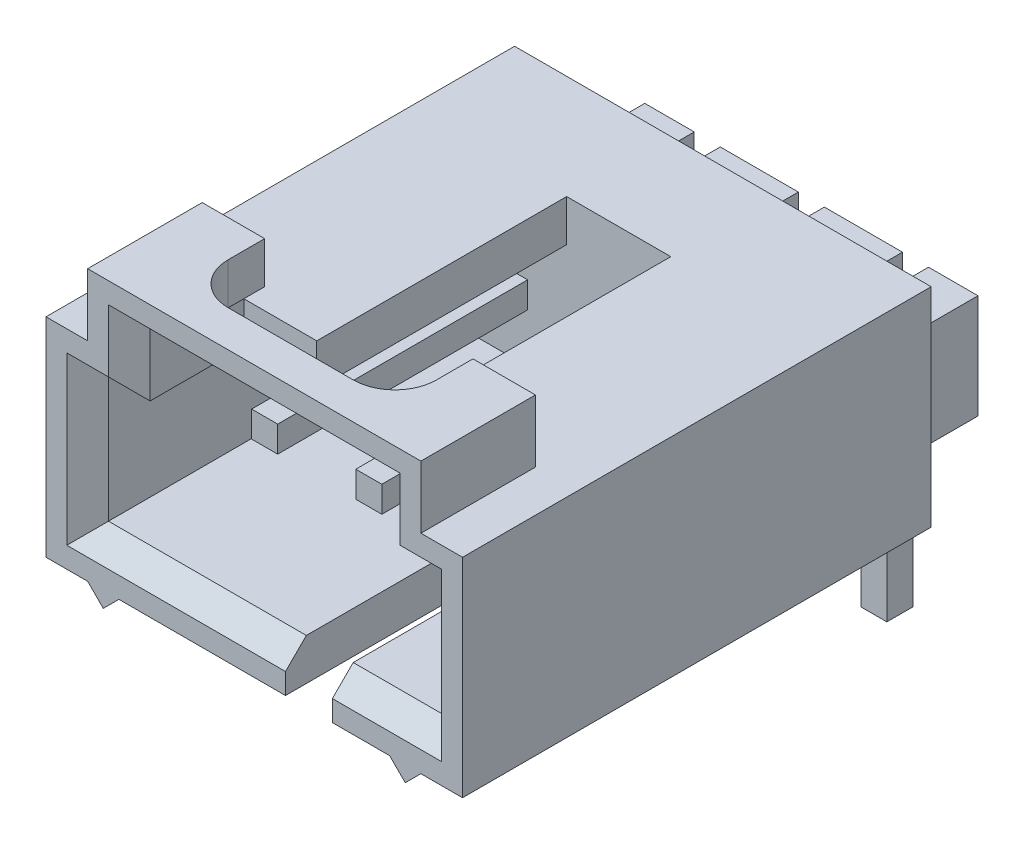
ISO-10303-21;
HEADER;
FILE_DESCRIPTION(('STEP AP214'),'2;1');
FILE_NAME('part.step','',(''),(''),'','','');
FILE_SCHEMA(('AUTOMOTIVE_DESIGN { 1 0 10303 214 1 1 1 1 }'));
ENDSEC;
DATA;
#1=APPLICATION_CONTEXT('core data for automotive mechanical design processes');
#2=APPLICATION_PROTOCOL_DEFINITION('international standard','automotive_design',2000,#1);
#3=PRODUCT_CONTEXT('',#1,'mechanical');
#4=PRODUCT('Part','Part','',(#3));
#5=PRODUCT_RELATED_PRODUCT_CATEGORY('part','',(#4));
#6=PRODUCT_DEFINITION_FORMATION('','',#4);
#7=PRODUCT_DEFINITION_CONTEXT('part definition',#1,'design');
#8=PRODUCT_DEFINITION('design','',#6,#7);
#9=PRODUCT_DEFINITION_SHAPE('','',#8);
#10=(LENGTH_UNIT() NAMED_UNIT(*) SI_UNIT(.MILLI.,.METRE.));
#11=(NAMED_UNIT(*) PLANE_ANGLE_UNIT() SI_UNIT($,.RADIAN.));
#12=(NAMED_UNIT(*) SI_UNIT($,.STERADIAN.) SOLID_ANGLE_UNIT());
#13=UNCERTAINTY_MEASURE_WITH_UNIT(LENGTH_MEASURE(1.E-05),#10,'distance_accuracy_value','');
#14=(GEOMETRIC_REPRESENTATION_CONTEXT(3) GLOBAL_UNCERTAINTY_ASSIGNED_CONTEXT((#13)) GLOBAL_UNIT_ASSIGNED_CONTEXT((#10,
#11,#12)) REPRESENTATION_CONTEXT('',''));
#15=CARTESIAN_POINT('',(0.,0.,0.));
#16=DIRECTION('',(0.,0.,1.));
#17=DIRECTION('',(1.,0.,0.));
#18=AXIS2_PLACEMENT_3D('',#15,#16,#17);
#19=CARTESIAN_POINT('',(2.2225,0.762,-6.477));
#20=DIRECTION('',(1.,0.,0.));
#21=DIRECTION('',(0.,1.,0.));
#22=AXIS2_PLACEMENT_3D('',#19,#20,#21);
#23=PLANE('',#22);
#24=DIRECTION('',(0.,0.,-1.));
#25=VECTOR('',#24,1.);
#26=CARTESIAN_POINT('',(2.222500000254,-1.778000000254,-6.477000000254));
#27=LINE('',#26,#25);
#28=CARTESIAN_POINT('',(2.2225,-1.778,-6.477));
#29=VERTEX_POINT('',#28);
#30=CARTESIAN_POINT('',(2.2225,-1.778,-6.858));
#31=VERTEX_POINT('',#30);
#32=EDGE_CURVE('E11',#29,#31,#27,.T.);
#33=ORIENTED_EDGE('',*,*,#32,.T.);
#34=DIRECTION('',(0.,1.,0.));
#35=VECTOR('',#34,1.);
#36=CARTESIAN_POINT('',(2.222500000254,-1.778000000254,-6.858000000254));
#37=LINE('',#36,#35);
#38=CARTESIAN_POINT('',(2.2225,-0.9652,-6.858));
#39=VERTEX_POINT('',#38);
#40=EDGE_CURVE('E25',#31,#39,#37,.T.);
#41=ORIENTED_EDGE('',*,*,#40,.T.);
#42=CARTESIAN_POINT('',(2.222500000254,-0.965200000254,-6.223000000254));
#43=DIRECTION('',(1.,0.,0.));
#44=DIRECTION('',(0.,0.,-1.));
#45=AXIS2_PLACEMENT_3D('',#42,#43,#44);
#46=CIRCLE('',#45,0.635);
#47=CARTESIAN_POINT('',(2.2225,-0.383212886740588,-6.477));
#48=VERTEX_POINT('',#47);
#49=EDGE_CURVE('E2031',#39,#48,#46,.T.);
#50=ORIENTED_EDGE('',*,*,#49,.T.);
#51=DIRECTION('',(0.,1.,0.));
#52=VECTOR('',#51,1.);
#53=CARTESIAN_POINT('',(2.222500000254,-1.778000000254,-6.477000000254));
#54=LINE('',#53,#52);
#55=EDGE_CURVE('E2026',#29,#48,#54,.T.);
#56=ORIENTED_EDGE('',*,*,#55,.F.);
#57=EDGE_LOOP('',(#33,#41,#50,#56));
#58=FACE_BOUND('',#57,.T.);
#59=ADVANCED_FACE('F17',(#58),#23,.T.);
#60=CARTESIAN_POINT('',(-4.064,-1.778,-6.477));
#61=DIRECTION('',(0.,0.,-1.));
#62=DIRECTION('',(0.,-1.,0.));
#63=AXIS2_PLACEMENT_3D('',#60,#61,#62);
#64=PLANE('',#63);
#65=DIRECTION('',(1.,0.,0.));
#66=VECTOR('',#65,1.);
#67=CARTESIAN_POINT('',(2.222500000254,-1.778000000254,-6.477000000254));
#68=LINE('',#67,#66);
#69=CARTESIAN_POINT('',(2.8575,-1.778,-6.477));
#70=VERTEX_POINT('',#69);
#71=EDGE_CURVE('E2021',#29,#70,#68,.T.);
#72=ORIENTED_EDGE('',*,*,#71,.F.);
#73=ORIENTED_EDGE('',*,*,#55,.T.);
#74=DIRECTION('',(1.,0.,0.));
#75=VECTOR('',#74,1.);
#76=CARTESIAN_POINT('',(2.222500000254,-0.383212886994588,-6.477000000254));
#77=LINE('',#76,#75);
#78=CARTESIAN_POINT('',(2.8575,-0.383212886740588,-6.477));
#79=VERTEX_POINT('',#78);
#80=EDGE_CURVE('E2017',#48,#79,#77,.T.);
#81=ORIENTED_EDGE('',*,*,#80,.T.);
#82=DIRECTION('',(0.,1.,0.));
#83=VECTOR('',#82,1.);
#84=CARTESIAN_POINT('',(2.857500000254,-1.778000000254,-6.477000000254));
#85=LINE('',#84,#83);
#86=EDGE_CURVE('E2012',#70,#79,#85,.T.);
#87=ORIENTED_EDGE('',*,*,#86,.F.);
#88=EDGE_LOOP('',(#72,#73,#81,#87));
#89=FACE_BOUND('',#88,.T.);
#90=ADVANCED_FACE('F2044',(#89),#64,.T.);
#91=CARTESIAN_POINT('',(2.8575,-1.778,-6.477));
#92=DIRECTION('',(-1.,0.,0.));
#93=DIRECTION('',(0.,0.,1.));
#94=AXIS2_PLACEMENT_3D('',#91,#92,#93);
#95=PLANE('',#94);
#96=CARTESIAN_POINT('',(2.857500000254,-0.965200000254,-6.223000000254));
#97=DIRECTION('',(1.,0.,0.));
#98=DIRECTION('',(0.,0.,-1.));
#99=AXIS2_PLACEMENT_3D('',#96,#97,#98);
#100=CIRCLE('',#99,0.635);
#101=CARTESIAN_POINT('',(2.8575,-0.9652,-6.858));
#102=VERTEX_POINT('',#101);
#103=EDGE_CURVE('E2007',#102,#79,#100,.T.);
#104=ORIENTED_EDGE('',*,*,#103,.F.);
#105=DIRECTION('',(0.,1.,0.));
#106=VECTOR('',#105,1.);
#107=CARTESIAN_POINT('',(2.857500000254,-1.778000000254,-6.858000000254));
#108=LINE('',#107,#106);
#109=CARTESIAN_POINT('',(2.8575,-1.778,-6.858));
#110=VERTEX_POINT('',#109);
#111=EDGE_CURVE('E2002',#110,#102,#108,.T.);
#112=ORIENTED_EDGE('',*,*,#111,.F.);
#113=DIRECTION('',(0.,0.,-1.));
#114=VECTOR('',#113,1.);
#115=CARTESIAN_POINT('',(2.857500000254,-1.778000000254,-6.477000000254));
#116=LINE('',#115,#114);
#117=EDGE_CURVE('E1997',#70,#110,#116,.T.);
#118=ORIENTED_EDGE('',*,*,#117,.F.);
#119=ORIENTED_EDGE('',*,*,#86,.T.);
#120=EDGE_LOOP('',(#104,#112,#118,#119));
#121=FACE_BOUND('',#120,.T.);
#122=ADVANCED_FACE('F2047',(#121),#95,.T.);
#123=CARTESIAN_POINT('',(-4.064,-1.778,-5.715));
#124=DIRECTION('',(0.,-1.,0.));
#125=DIRECTION('',(0.,0.,-1.));
#126=AXIS2_PLACEMENT_3D('',#123,#124,#125);
#127=PLANE('',#126);
#128=DIRECTION('',(1.,0.,0.));
#129=VECTOR('',#128,1.);
#130=CARTESIAN_POINT('',(-2.857500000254,-1.778000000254,-6.477000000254));
#131=LINE('',#130,#129);
#132=CARTESIAN_POINT('',(-2.8575,-1.778,-6.477));
#133=VERTEX_POINT('',#132);
#134=CARTESIAN_POINT('',(-2.2225,-1.778,-6.477));
#135=VERTEX_POINT('',#134);
#136=EDGE_CURVE('E1993',#133,#135,#131,.T.);
#137=ORIENTED_EDGE('',*,*,#136,.T.);
#138=DIRECTION('',(0.,0.,-1.));
#139=VECTOR('',#138,1.);
#140=CARTESIAN_POINT('',(-2.222500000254,-1.778000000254,-6.477000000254));
#141=LINE('',#140,#139);
#142=CARTESIAN_POINT('',(-2.2225,-1.778,-6.858));
#143=VERTEX_POINT('',#142);
#144=EDGE_CURVE('E1989',#135,#143,#141,.T.);
#145=ORIENTED_EDGE('',*,*,#144,.T.);
#146=DIRECTION('',(0.,0.,-1.));
#147=VECTOR('',#146,1.);
#148=CARTESIAN_POINT('',(-2.222500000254,-1.778000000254,-6.858000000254));
#149=LINE('',#148,#147);
#150=CARTESIAN_POINT('',(-2.2225,-1.778,-7.493));
#151=VERTEX_POINT('',#150);
#152=EDGE_CURVE('E1985',#143,#151,#149,.T.);
#153=ORIENTED_EDGE('',*,*,#152,.T.);
#154=DIRECTION('',(0.,0.,-1.));
#155=VECTOR('',#154,1.);
#156=CARTESIAN_POINT('',(-2.222500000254,-1.778000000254,-7.493000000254));
#157=LINE('',#156,#155);
#158=CARTESIAN_POINT('',(-2.2225,-1.778,-7.874));
#159=VERTEX_POINT('',#158);
#160=EDGE_CURVE('E1981',#151,#159,#157,.T.);
#161=ORIENTED_EDGE('',*,*,#160,.T.);
#162=DIRECTION('',(-1.,0.,0.));
#163=VECTOR('',#162,1.);
#164=CARTESIAN_POINT('',(-0.317500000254,-1.778000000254,-7.874000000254));
#165=LINE('',#164,#163);
#166=CARTESIAN_POINT('',(-0.3175,-1.778,-7.874));
#167=VERTEX_POINT('',#166);
#168=EDGE_CURVE('E1976',#167,#159,#165,.T.);
#169=ORIENTED_EDGE('',*,*,#168,.F.);
#170=DIRECTION('',(0.,0.,-1.));
#171=VECTOR('',#170,1.);
#172=CARTESIAN_POINT('',(-0.317500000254,-1.778000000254,-7.493000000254));
#173=LINE('',#172,#171);
#174=CARTESIAN_POINT('',(-0.3175,-1.778,-7.493));
#175=VERTEX_POINT('',#174);
#176=EDGE_CURVE('E1971',#175,#167,#173,.T.);
#177=ORIENTED_EDGE('',*,*,#176,.F.);
#178=DIRECTION('',(0.,0.,-1.));
#179=VECTOR('',#178,1.);
#180=CARTESIAN_POINT('',(-0.317500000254,-1.778000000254,-6.858000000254));
#181=LINE('',#180,#179);
#182=CARTESIAN_POINT('',(-0.3175,-1.778,-6.858));
#183=VERTEX_POINT('',#182);
#184=EDGE_CURVE('E1966',#183,#175,#181,.T.);
#185=ORIENTED_EDGE('',*,*,#184,.F.);
#186=DIRECTION('',(0.,0.,-1.));
#187=VECTOR('',#186,1.);
#188=CARTESIAN_POINT('',(-0.317500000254,-1.778000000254,-6.477000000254));
#189=LINE('',#188,#187);
#190=CARTESIAN_POINT('',(-0.3175,-1.778,-6.477));
#191=VERTEX_POINT('',#190);
#192=EDGE_CURVE('E1961',#191,#183,#189,.T.);
#193=ORIENTED_EDGE('',*,*,#192,.F.);
#194=DIRECTION('',(1.,0.,0.));
#195=VECTOR('',#194,1.);
#196=CARTESIAN_POINT('',(-0.317500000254,-1.778000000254,-6.477000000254));
#197=LINE('',#196,#195);
#198=CARTESIAN_POINT('',(0.3175,-1.778,-6.477));
#199=VERTEX_POINT('',#198);
#200=EDGE_CURVE('E1957',#191,#199,#197,.T.);
#201=ORIENTED_EDGE('',*,*,#200,.T.);
#202=DIRECTION('',(0.,0.,-1.));
#203=VECTOR('',#202,1.);
#204=CARTESIAN_POINT('',(0.317500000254,-1.778000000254,-6.477000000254));
#205=LINE('',#204,#203);
#206=CARTESIAN_POINT('',(0.3175,-1.778,-6.858));
#207=VERTEX_POINT('',#206);
#208=EDGE_CURVE('E1953',#199,#207,#205,.T.);
#209=ORIENTED_EDGE('',*,*,#208,.T.);
#210=DIRECTION('',(0.,0.,-1.));
#211=VECTOR('',#210,1.);
#212=CARTESIAN_POINT('',(0.317500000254,-1.778000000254,-6.858000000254));
#213=LINE('',#212,#211);
#214=CARTESIAN_POINT('',(0.3175,-1.778,-7.493));
#215=VERTEX_POINT('',#214);
#216=EDGE_CURVE('E1949',#207,#215,#213,.T.);
#217=ORIENTED_EDGE('',*,*,#216,.T.);
#218=DIRECTION('',(0.,0.,-1.));
#219=VECTOR('',#218,1.);
#220=CARTESIAN_POINT('',(0.317500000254,-1.778000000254,-7.493000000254));
#221=LINE('',#220,#219);
#222=CARTESIAN_POINT('',(0.3175,-1.778,-7.874));
#223=VERTEX_POINT('',#222);
#224=EDGE_CURVE('E1945',#215,#223,#221,.T.);
#225=ORIENTED_EDGE('',*,*,#224,.T.);
#226=DIRECTION('',(-1.,0.,0.));
#227=VECTOR('',#226,1.);
#228=CARTESIAN_POINT('',(2.222500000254,-1.778000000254,-7.874000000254));
#229=LINE('',#228,#227);
#230=CARTESIAN_POINT('',(2.2225,-1.778,-7.874));
#231=VERTEX_POINT('',#230);
#232=EDGE_CURVE('E1940',#231,#223,#229,.T.);
#233=ORIENTED_EDGE('',*,*,#232,.F.);
#234=DIRECTION('',(0.,0.,-1.));
#235=VECTOR('',#234,1.);
#236=CARTESIAN_POINT('',(2.222500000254,-1.778000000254,-7.493000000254));
#237=LINE('',#236,#235);
#238=CARTESIAN_POINT('',(2.2225,-1.778,-7.493));
#239=VERTEX_POINT('',#238);
#240=EDGE_CURVE('E1935',#239,#231,#237,.T.);
#241=ORIENTED_EDGE('',*,*,#240,.F.);
#242=DIRECTION('',(0.,0.,-1.));
#243=VECTOR('',#242,1.);
#244=CARTESIAN_POINT('',(2.222500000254,-1.778000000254,-6.858000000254));
#245=LINE('',#244,#243);
#246=EDGE_CURVE('E1930',#31,#239,#245,.T.);
#247=ORIENTED_EDGE('',*,*,#246,.F.);
#248=ORIENTED_EDGE('',*,*,#32,.F.);
#249=ORIENTED_EDGE('',*,*,#71,.T.);
#250=ORIENTED_EDGE('',*,*,#117,.T.);
#251=DIRECTION('',(0.,0.,-1.));
#252=VECTOR('',#251,1.);
#253=CARTESIAN_POINT('',(2.857500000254,-1.778000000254,-6.858000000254));
#254=LINE('',#253,#252);
#255=CARTESIAN_POINT('',(2.8575,-1.778,-7.493));
#256=VERTEX_POINT('',#255);
#257=EDGE_CURVE('E1926',#110,#256,#254,.T.);
#258=ORIENTED_EDGE('',*,*,#257,.T.);
#259=DIRECTION('',(0.,0.,-1.));
#260=VECTOR('',#259,1.);
#261=CARTESIAN_POINT('',(2.857500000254,-1.778000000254,-7.493000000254));
#262=LINE('',#261,#260);
#263=CARTESIAN_POINT('',(2.8575,-1.778,-7.874));
#264=VERTEX_POINT('',#263);
#265=EDGE_CURVE('E1922',#256,#264,#262,.T.);
#266=ORIENTED_EDGE('',*,*,#265,.T.);
#267=DIRECTION('',(-1.,0.,0.));
#268=VECTOR('',#267,1.);
#269=CARTESIAN_POINT('',(4.064000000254,-1.778000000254,-7.874000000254));
#270=LINE('',#269,#268);
#271=CARTESIAN_POINT('',(4.064,-1.778,-7.874));
#272=VERTEX_POINT('',#271);
#273=EDGE_CURVE('E1917',#272,#264,#270,.T.);
#274=ORIENTED_EDGE('',*,*,#273,.F.);
#275=DIRECTION('',(0.,0.,-1.));
#276=VECTOR('',#275,1.);
#277=CARTESIAN_POINT('',(4.064000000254,-1.778000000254,-5.715000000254));
#278=LINE('',#277,#276);
#279=CARTESIAN_POINT('',(4.064,-1.778,-5.715));
#280=VERTEX_POINT('',#279);
#281=EDGE_CURVE('E1912',#280,#272,#278,.T.);
#282=ORIENTED_EDGE('',*,*,#281,.F.);
#283=DIRECTION('',(1.,0.,0.));
#284=VECTOR('',#283,1.);
#285=CARTESIAN_POINT('',(-4.064000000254,-1.778000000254,-5.715000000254));
#286=LINE('',#285,#284);
#287=CARTESIAN_POINT('',(-4.064,-1.778,-5.715));
#288=VERTEX_POINT('',#287);
#289=EDGE_CURVE('E1907',#288,#280,#286,.T.);
#290=ORIENTED_EDGE('',*,*,#289,.F.);
#291=DIRECTION('',(0.,0.,-1.));
#292=VECTOR('',#291,1.);
#293=CARTESIAN_POINT('',(-4.064000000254,-1.778000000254,-5.715000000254));
#294=LINE('',#293,#292);
#295=CARTESIAN_POINT('',(-4.064,-1.778,-7.874));
#296=VERTEX_POINT('',#295);
#297=EDGE_CURVE('E1903',#288,#296,#294,.T.);
#298=ORIENTED_EDGE('',*,*,#297,.T.);
#299=DIRECTION('',(-1.,0.,0.));
#300=VECTOR('',#299,1.);
#301=CARTESIAN_POINT('',(-2.857500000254,-1.778000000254,-7.874000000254));
#302=LINE('',#301,#300);
#303=CARTESIAN_POINT('',(-2.8575,-1.778,-7.874));
#304=VERTEX_POINT('',#303);
#305=EDGE_CURVE('E1898',#304,#296,#302,.T.);
#306=ORIENTED_EDGE('',*,*,#305,.F.);
#307=DIRECTION('',(0.,0.,-1.));
#308=VECTOR('',#307,1.);
#309=CARTESIAN_POINT('',(-2.857500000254,-1.778000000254,-7.493000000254));
#310=LINE('',#309,#308);
#311=CARTESIAN_POINT('',(-2.8575,-1.778,-7.493));
#312=VERTEX_POINT('',#311);
#313=EDGE_CURVE('E1893',#312,#304,#310,.T.);
#314=ORIENTED_EDGE('',*,*,#313,.F.);
#315=DIRECTION('',(0.,0.,-1.));
#316=VECTOR('',#315,1.);
#317=CARTESIAN_POINT('',(-2.857500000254,-1.778000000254,-6.858000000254));
#318=LINE('',#317,#316);
#319=CARTESIAN_POINT('',(-2.8575,-1.778,-6.858));
#320=VERTEX_POINT('',#319);
#321=EDGE_CURVE('E1888',#320,#312,#318,.T.);
#322=ORIENTED_EDGE('',*,*,#321,.F.);
#323=DIRECTION('',(0.,0.,-1.));
#324=VECTOR('',#323,1.);
#325=CARTESIAN_POINT('',(-2.857500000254,-1.778000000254,-6.477000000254));
#326=LINE('',#325,#324);
#327=EDGE_CURVE('E1883',#133,#320,#326,.T.);
#328=ORIENTED_EDGE('',*,*,#327,.F.);
#329=EDGE_LOOP('',(#137,#145,#153,#161,#169,#177,#185,#193,#201,#209,#217,#225,#233,#241,#247,
#248,#249,#250,#258,#266,#274,#282,#290,#298,#306,#314,#322,#328));
#330=FACE_BOUND('',#329,.T.);
#331=ADVANCED_FACE('F2060',(#330),#127,.T.);
#332=CARTESIAN_POINT('',(-2.8575,0.762,-6.477));
#333=DIRECTION('',(1.,0.,0.));
#334=DIRECTION('',(0.,1.,0.));
#335=AXIS2_PLACEMENT_3D('',#332,#333,#334);
#336=PLANE('',#335);
#337=ORIENTED_EDGE('',*,*,#327,.T.);
#338=DIRECTION('',(0.,1.,0.));
#339=VECTOR('',#338,1.);
#340=CARTESIAN_POINT('',(-2.857500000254,-1.778000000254,-6.858000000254));
#341=LINE('',#340,#339);
#342=CARTESIAN_POINT('',(-2.8575,-0.9652,-6.858));
#343=VERTEX_POINT('',#342);
#344=EDGE_CURVE('E1879',#320,#343,#341,.T.);
#345=ORIENTED_EDGE('',*,*,#344,.T.);
#346=CARTESIAN_POINT('',(-2.857500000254,-0.965200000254,-6.223000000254));
#347=DIRECTION('',(1.,0.,0.));
#348=DIRECTION('',(0.,0.,-1.));
#349=AXIS2_PLACEMENT_3D('',#346,#347,#348);
#350=CIRCLE('',#349,0.635);
#351=CARTESIAN_POINT('',(-2.8575,-0.383212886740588,-6.477));
#352=VERTEX_POINT('',#351);
#353=EDGE_CURVE('E1875',#343,#352,#350,.T.);
#354=ORIENTED_EDGE('',*,*,#353,.T.);
#355=DIRECTION('',(0.,1.,0.));
#356=VECTOR('',#355,1.);
#357=CARTESIAN_POINT('',(-2.857500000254,-1.778000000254,-6.477000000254));
#358=LINE('',#357,#356);
#359=EDGE_CURVE('E1870',#133,#352,#358,.T.);
#360=ORIENTED_EDGE('',*,*,#359,.F.);
#361=EDGE_LOOP('',(#337,#345,#354,#360));
#362=FACE_BOUND('',#361,.T.);
#363=ADVANCED_FACE('F2149',(#362),#336,.T.);
#364=CARTESIAN_POINT('',(-4.064,-1.778,-6.477));
#365=DIRECTION('',(0.,0.,-1.));
#366=DIRECTION('',(0.,-1.,0.));
#367=AXIS2_PLACEMENT_3D('',#364,#365,#366);
#368=PLANE('',#367);
#369=DIRECTION('',(1.,0.,0.));
#370=VECTOR('',#369,1.);
#371=CARTESIAN_POINT('',(-2.857500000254,-0.383212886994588,-6.477000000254));
#372=LINE('',#371,#370);
#373=CARTESIAN_POINT('',(-2.2225,-0.383212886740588,-6.477));
#374=VERTEX_POINT('',#373);
#375=EDGE_CURVE('E1866',#352,#374,#372,.T.);
#376=ORIENTED_EDGE('',*,*,#375,.T.);
#377=DIRECTION('',(0.,1.,0.));
#378=VECTOR('',#377,1.);
#379=CARTESIAN_POINT('',(-2.222500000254,-1.778000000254,-6.477000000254));
#380=LINE('',#379,#378);
#381=EDGE_CURVE('E1861',#135,#374,#380,.T.);
#382=ORIENTED_EDGE('',*,*,#381,.F.);
#383=ORIENTED_EDGE('',*,*,#136,.F.);
#384=ORIENTED_EDGE('',*,*,#359,.T.);
#385=EDGE_LOOP('',(#376,#382,#383,#384));
#386=FACE_BOUND('',#385,.T.);
#387=ADVANCED_FACE('F2156',(#386),#368,.T.);
#388=CARTESIAN_POINT('',(-2.2225,-1.778,-6.477));
#389=DIRECTION('',(-1.,0.,0.));
#390=DIRECTION('',(0.,0.,1.));
#391=AXIS2_PLACEMENT_3D('',#388,#389,#390);
#392=PLANE('',#391);
#393=CARTESIAN_POINT('',(-2.222500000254,-0.965200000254,-6.223000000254));
#394=DIRECTION('',(1.,0.,0.));
#395=DIRECTION('',(0.,0.,-1.));
#396=AXIS2_PLACEMENT_3D('',#393,#394,#395);
#397=CIRCLE('',#396,0.635);
#398=CARTESIAN_POINT('',(-2.2225,-0.9652,-6.858));
#399=VERTEX_POINT('',#398);
#400=EDGE_CURVE('E1856',#399,#374,#397,.T.);
#401=ORIENTED_EDGE('',*,*,#400,.F.);
#402=DIRECTION('',(0.,1.,0.));
#403=VECTOR('',#402,1.);
#404=CARTESIAN_POINT('',(-2.222500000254,-1.778000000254,-6.858000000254));
#405=LINE('',#404,#403);
#406=EDGE_CURVE('E1851',#143,#399,#405,.T.);
#407=ORIENTED_EDGE('',*,*,#406,.F.);
#408=ORIENTED_EDGE('',*,*,#144,.F.);
#409=ORIENTED_EDGE('',*,*,#381,.T.);
#410=EDGE_LOOP('',(#401,#407,#408,#409));
#411=FACE_BOUND('',#410,.T.);
#412=ADVANCED_FACE('F2159',(#411),#392,.T.);
#413=CARTESIAN_POINT('',(-2.8575,-0.9652,-6.858));
#414=DIRECTION('',(0.,0.,1.));
#415=DIRECTION('',(1.,0.,0.));
#416=AXIS2_PLACEMENT_3D('',#413,#414,#415);
#417=PLANE('',#416);
#418=DIRECTION('',(1.,0.,0.));
#419=VECTOR('',#418,1.);
#420=CARTESIAN_POINT('',(-2.857500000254,-6.223000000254,-6.858000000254));
#421=LINE('',#420,#419);
#422=CARTESIAN_POINT('',(-2.8575,-6.223,-6.858));
#423=VERTEX_POINT('',#422);
#424=CARTESIAN_POINT('',(-2.2225,-6.223,-6.858));
#425=VERTEX_POINT('',#424);
#426=EDGE_CURVE('E1847',#423,#425,#421,.T.);
#427=ORIENTED_EDGE('',*,*,#426,.T.);
#428=DIRECTION('',(0.,-1.,0.));
#429=VECTOR('',#428,1.);
#430=CARTESIAN_POINT('',(-2.222500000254,-1.778000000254,-6.858000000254));
#431=LINE('',#430,#429);
#432=EDGE_CURVE('E1842',#143,#425,#431,.T.);
#433=ORIENTED_EDGE('',*,*,#432,.F.);
#434=ORIENTED_EDGE('',*,*,#406,.T.);
#435=DIRECTION('',(1.,0.,0.));
#436=VECTOR('',#435,1.);
#437=CARTESIAN_POINT('',(-2.857500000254,-0.965200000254,-6.858000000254));
#438=LINE('',#437,#436);
#439=EDGE_CURVE('E1837',#343,#399,#438,.T.);
#440=ORIENTED_EDGE('',*,*,#439,.F.);
#441=ORIENTED_EDGE('',*,*,#344,.F.);
#442=DIRECTION('',(0.,-1.,0.));
#443=VECTOR('',#442,1.);
#444=CARTESIAN_POINT('',(-2.857500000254,-1.778000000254,-6.858000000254));
#445=LINE('',#444,#443);
#446=EDGE_CURVE('E1833',#320,#423,#445,.T.);
#447=ORIENTED_EDGE('',*,*,#446,.T.);
#448=EDGE_LOOP('',(#427,#433,#434,#440,#441,#447));
#449=FACE_BOUND('',#448,.T.);
#450=ADVANCED_FACE('F2143',(#449),#417,.T.);
#451=CARTESIAN_POINT('',(-2.8575,0.,0.));
#452=DIRECTION('',(1.,0.,0.));
#453=DIRECTION('',(0.,1.,0.));
#454=AXIS2_PLACEMENT_3D('',#451,#452,#453);
#455=PLANE('',#454);
#456=ORIENTED_EDGE('',*,*,#321,.T.);
#457=DIRECTION('',(0.,1.,0.));
#458=VECTOR('',#457,1.);
#459=CARTESIAN_POINT('',(-2.857500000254,-6.223000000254,-7.493000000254));
#460=LINE('',#459,#458);
#461=CARTESIAN_POINT('',(-2.8575,-6.223,-7.493));
#462=VERTEX_POINT('',#461);
#463=EDGE_CURVE('E1828',#462,#312,#460,.T.);
#464=ORIENTED_EDGE('',*,*,#463,.F.);
#465=DIRECTION('',(0.,0.,-1.));
#466=VECTOR('',#465,1.);
#467=CARTESIAN_POINT('',(-2.857500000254,-6.223000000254,-6.858000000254));
#468=LINE('',#467,#466);
#469=EDGE_CURVE('E1823',#423,#462,#468,.T.);
#470=ORIENTED_EDGE('',*,*,#469,.F.);
#471=ORIENTED_EDGE('',*,*,#446,.F.);
#472=EDGE_LOOP('',(#456,#464,#470,#471));
#473=FACE_BOUND('',#472,.T.);
#474=ADVANCED_FACE('F2135',(#473),#455,.F.);
#475=CARTESIAN_POINT('',(-2.8575,-6.223,-6.858));
#476=DIRECTION('',(0.,-1.,0.));
#477=DIRECTION('',(0.,0.,-1.));
#478=AXIS2_PLACEMENT_3D('',#475,#476,#477);
#479=PLANE('',#478);
#480=DIRECTION('',(1.,0.,0.));
#481=VECTOR('',#480,1.);
#482=CARTESIAN_POINT('',(-2.857500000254,-6.223000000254,-7.493000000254));
#483=LINE('',#482,#481);
#484=CARTESIAN_POINT('',(-2.2225,-6.223,-7.493));
#485=VERTEX_POINT('',#484);
#486=EDGE_CURVE('E1819',#462,#485,#483,.T.);
#487=ORIENTED_EDGE('',*,*,#486,.T.);
#488=DIRECTION('',(0.,0.,-1.));
#489=VECTOR('',#488,1.);
#490=CARTESIAN_POINT('',(-2.222500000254,-6.223000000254,-6.858000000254));
#491=LINE('',#490,#489);
#492=EDGE_CURVE('E1814',#425,#485,#491,.T.);
#493=ORIENTED_EDGE('',*,*,#492,.F.);
#494=ORIENTED_EDGE('',*,*,#426,.F.);
#495=ORIENTED_EDGE('',*,*,#469,.T.);
#496=EDGE_LOOP('',(#487,#493,#494,#495));
#497=FACE_BOUND('',#496,.T.);
#498=ADVANCED_FACE('F2139',(#497),#479,.T.);
#499=CARTESIAN_POINT('',(-2.2225,0.,0.));
#500=DIRECTION('',(1.,0.,0.));
#501=DIRECTION('',(0.,1.,0.));
#502=AXIS2_PLACEMENT_3D('',#499,#500,#501);
#503=PLANE('',#502);
#504=ORIENTED_EDGE('',*,*,#492,.T.);
#505=DIRECTION('',(0.,1.,0.));
#506=VECTOR('',#505,1.);
#507=CARTESIAN_POINT('',(-2.222500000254,-6.223000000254,-7.493000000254));
#508=LINE('',#507,#506);
#509=EDGE_CURVE('E1809',#485,#151,#508,.T.);
#510=ORIENTED_EDGE('',*,*,#509,.T.);
#511=ORIENTED_EDGE('',*,*,#152,.F.);
#512=ORIENTED_EDGE('',*,*,#432,.T.);
#513=EDGE_LOOP('',(#504,#510,#511,#512));
#514=FACE_BOUND('',#513,.T.);
#515=ADVANCED_FACE('F2192',(#514),#503,.T.);
#516=CARTESIAN_POINT('',(-2.8575,-6.223,-7.493));
#517=DIRECTION('',(0.,0.,-1.));
#518=DIRECTION('',(0.,-1.,0.));
#519=AXIS2_PLACEMENT_3D('',#516,#517,#518);
#520=PLANE('',#519);
#521=DIRECTION('',(1.,0.,0.));
#522=VECTOR('',#521,1.);
#523=CARTESIAN_POINT('',(-2.857500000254,-0.965200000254,-7.493000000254));
#524=LINE('',#523,#522);
#525=CARTESIAN_POINT('',(-2.8575,-0.9652,-7.493));
#526=VERTEX_POINT('',#525);
#527=CARTESIAN_POINT('',(-2.2225,-0.9652,-7.493));
#528=VERTEX_POINT('',#527);
#529=EDGE_CURVE('E1805',#526,#528,#524,.T.);
#530=ORIENTED_EDGE('',*,*,#529,.T.);
#531=DIRECTION('',(0.,1.,0.));
#532=VECTOR('',#531,1.);
#533=CARTESIAN_POINT('',(-2.222500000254,-1.778000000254,-7.493000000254));
#534=LINE('',#533,#532);
#535=EDGE_CURVE('E1800',#151,#528,#534,.T.);
#536=ORIENTED_EDGE('',*,*,#535,.F.);
#537=ORIENTED_EDGE('',*,*,#509,.F.);
#538=ORIENTED_EDGE('',*,*,#486,.F.);
#539=ORIENTED_EDGE('',*,*,#463,.T.);
#540=DIRECTION('',(0.,1.,0.));
#541=VECTOR('',#540,1.);
#542=CARTESIAN_POINT('',(-2.857500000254,-1.778000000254,-7.493000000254));
#543=LINE('',#542,#541);
#544=EDGE_CURVE('E1796',#312,#526,#543,.T.);
#545=ORIENTED_EDGE('',*,*,#544,.T.);
#546=EDGE_LOOP('',(#530,#536,#537,#538,#539,#545));
#547=FACE_BOUND('',#546,.T.);
#548=ADVANCED_FACE('F2130',(#547),#520,.T.);
#549=CARTESIAN_POINT('',(-2.8575,0.762,-6.477));
#550=DIRECTION('',(1.,0.,0.));
#551=DIRECTION('',(0.,1.,0.));
#552=AXIS2_PLACEMENT_3D('',#549,#550,#551);
#553=PLANE('',#552);
#554=ORIENTED_EDGE('',*,*,#313,.T.);
#555=DIRECTION('',(0.,-1.,0.));
#556=VECTOR('',#555,1.);
#557=CARTESIAN_POINT('',(-2.857500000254,0.762000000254,-7.874000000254));
#558=LINE('',#557,#556);
#559=CARTESIAN_POINT('',(-2.8575,0.762,-7.874));
#560=VERTEX_POINT('',#559);
#561=EDGE_CURVE('E1791',#560,#304,#558,.T.);
#562=ORIENTED_EDGE('',*,*,#561,.F.);
#563=DIRECTION('',(0.,0.,-1.));
#564=VECTOR('',#563,1.);
#565=CARTESIAN_POINT('',(-2.857500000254,0.762000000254,-6.477000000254));
#566=LINE('',#565,#564);
#567=CARTESIAN_POINT('',(-2.8575,0.762,-6.477));
#568=VERTEX_POINT('',#567);
#569=EDGE_CURVE('E1786',#568,#560,#566,.T.);
#570=ORIENTED_EDGE('',*,*,#569,.F.);
#571=DIRECTION('',(0.,1.,0.));
#572=VECTOR('',#571,1.);
#573=CARTESIAN_POINT('',(-2.857500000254,0.279140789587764,-6.477000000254));
#574=LINE('',#573,#572);
#575=CARTESIAN_POINT('',(-2.8575,0.279140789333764,-6.477));
#576=VERTEX_POINT('',#575);
#577=EDGE_CURVE('E1781',#576,#568,#574,.T.);
#578=ORIENTED_EDGE('',*,*,#577,.F.);
#579=CARTESIAN_POINT('',(-2.857500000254,-0.965200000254,-6.223000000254));
#580=DIRECTION('',(1.,0.,0.));
#581=DIRECTION('',(0.,0.,-1.));
#582=AXIS2_PLACEMENT_3D('',#579,#580,#581);
#583=CIRCLE('',#582,1.27);
#584=EDGE_CURVE('E1776',#526,#576,#583,.T.);
#585=ORIENTED_EDGE('',*,*,#584,.F.);
#586=ORIENTED_EDGE('',*,*,#544,.F.);
#587=EDGE_LOOP('',(#554,#562,#570,#578,#585,#586));
#588=FACE_BOUND('',#587,.T.);
#589=ADVANCED_FACE('F2128',(#588),#553,.T.);
#590=CARTESIAN_POINT('',(-2.8575,-0.9652,-6.223));
#591=DIRECTION('',(-1.,0.,0.));
#592=DIRECTION('',(0.,-0.632455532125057,0.774596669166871));
#593=AXIS2_PLACEMENT_3D('',#590,#591,#592);
#594=CYLINDRICAL_SURFACE('',#593,1.27);
#595=CARTESIAN_POINT('',(-2.222500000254,-0.965200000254,-6.223000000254));
#596=DIRECTION('',(1.,0.,0.));
#597=DIRECTION('',(0.,0.,-1.));
#598=AXIS2_PLACEMENT_3D('',#595,#596,#597);
#599=CIRCLE('',#598,1.27);
#600=CARTESIAN_POINT('',(-2.2225,0.279140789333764,-6.477));
#601=VERTEX_POINT('',#600);
#602=EDGE_CURVE('E1771',#528,#601,#599,.T.);
#603=ORIENTED_EDGE('',*,*,#602,.F.);
#604=ORIENTED_EDGE('',*,*,#529,.F.);
#605=ORIENTED_EDGE('',*,*,#584,.T.);
#606=DIRECTION('',(1.,0.,0.));
#607=VECTOR('',#606,1.);
#608=CARTESIAN_POINT('',(-2.857500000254,0.279140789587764,-6.477000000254));
#609=LINE('',#608,#607);
#610=EDGE_CURVE('E1767',#576,#601,#609,.T.);
#611=ORIENTED_EDGE('',*,*,#610,.T.);
#612=EDGE_LOOP('',(#603,#604,#605,#611));
#613=FACE_BOUND('',#612,.T.);
#614=ADVANCED_FACE('F2111',(#613),#594,.T.);
#615=CARTESIAN_POINT('',(-4.064,-1.778,-6.477));
#616=DIRECTION('',(0.,0.,-1.));
#617=DIRECTION('',(0.,-1.,0.));
#618=AXIS2_PLACEMENT_3D('',#615,#616,#617);
#619=PLANE('',#618);
#620=ORIENTED_EDGE('',*,*,#577,.T.);
#621=DIRECTION('',(1.,0.,0.));
#622=VECTOR('',#621,1.);
#623=CARTESIAN_POINT('',(-4.064000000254,0.762000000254,-6.477000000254));
#624=LINE('',#623,#622);
#625=CARTESIAN_POINT('',(-4.064,0.762,-6.477));
#626=VERTEX_POINT('',#625);
#627=EDGE_CURVE('E1762',#626,#568,#624,.T.);
#628=ORIENTED_EDGE('',*,*,#627,.F.);
#629=DIRECTION('',(0.,1.,0.));
#630=VECTOR('',#629,1.);
#631=CARTESIAN_POINT('',(-4.064000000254,0.762000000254,-6.477000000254));
#632=LINE('',#631,#630);
#633=CARTESIAN_POINT('',(-4.064,1.778,-6.477));
#634=VERTEX_POINT('',#633);
#635=EDGE_CURVE('E1758',#626,#634,#632,.T.);
#636=ORIENTED_EDGE('',*,*,#635,.T.);
#637=DIRECTION('',(1.,0.,0.));
#638=VECTOR('',#637,1.);
#639=CARTESIAN_POINT('',(-4.064000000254,1.778000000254,-6.477000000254));
#640=LINE('',#639,#638);
#641=CARTESIAN_POINT('',(4.064,1.778,-6.477));
#642=VERTEX_POINT('',#641);
#643=EDGE_CURVE('E1754',#634,#642,#640,.T.);
#644=ORIENTED_EDGE('',*,*,#643,.T.);
#645=DIRECTION('',(0.,1.,0.));
#646=VECTOR('',#645,1.);
#647=CARTESIAN_POINT('',(4.064000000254,0.762000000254,-6.477000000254));
#648=LINE('',#647,#646);
#649=CARTESIAN_POINT('',(4.064,0.762,-6.477));
#650=VERTEX_POINT('',#649);
#651=EDGE_CURVE('E1749',#650,#642,#648,.T.);
#652=ORIENTED_EDGE('',*,*,#651,.F.);
#653=DIRECTION('',(-1.,0.,0.));
#654=VECTOR('',#653,1.);
#655=CARTESIAN_POINT('',(4.064000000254,0.762000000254,-6.477000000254));
#656=LINE('',#655,#654);
#657=CARTESIAN_POINT('',(2.8575,0.762,-6.477));
#658=VERTEX_POINT('',#657);
#659=EDGE_CURVE('E1745',#650,#658,#656,.T.);
#660=ORIENTED_EDGE('',*,*,#659,.T.);
#661=DIRECTION('',(0.,1.,0.));
#662=VECTOR('',#661,1.);
#663=CARTESIAN_POINT('',(2.857500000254,0.279140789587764,-6.477000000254));
#664=LINE('',#663,#662);
#665=CARTESIAN_POINT('',(2.8575,0.279140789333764,-6.477));
#666=VERTEX_POINT('',#665);
#667=EDGE_CURVE('E1740',#666,#658,#664,.T.);
#668=ORIENTED_EDGE('',*,*,#667,.F.);
#669=DIRECTION('',(1.,0.,0.));
#670=VECTOR('',#669,1.);
#671=CARTESIAN_POINT('',(2.222500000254,0.279140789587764,-6.477000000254));
#672=LINE('',#671,#670);
#673=CARTESIAN_POINT('',(2.2225,0.279140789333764,-6.477));
#674=VERTEX_POINT('',#673);
#675=EDGE_CURVE('E1735',#674,#666,#672,.T.);
#676=ORIENTED_EDGE('',*,*,#675,.F.);
#677=DIRECTION('',(0.,1.,0.));
#678=VECTOR('',#677,1.);
#679=CARTESIAN_POINT('',(2.222500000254,0.279140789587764,-6.477000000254));
#680=LINE('',#679,#678);
#681=CARTESIAN_POINT('',(2.2225,0.762,-6.477));
#682=VERTEX_POINT('',#681);
#683=EDGE_CURVE('E1731',#674,#682,#680,.T.);
#684=ORIENTED_EDGE('',*,*,#683,.T.);
#685=DIRECTION('',(1.,0.,0.));
#686=VECTOR('',#685,1.);
#687=CARTESIAN_POINT('',(0.317500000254,0.762000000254,-6.477000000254));
#688=LINE('',#687,#686);
#689=CARTESIAN_POINT('',(0.3175,0.762,-6.477));
#690=VERTEX_POINT('',#689);
#691=EDGE_CURVE('E1726',#690,#682,#688,.T.);
#692=ORIENTED_EDGE('',*,*,#691,.F.);
#693=DIRECTION('',(0.,1.,0.));
#694=VECTOR('',#693,1.);
#695=CARTESIAN_POINT('',(0.317500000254,0.279140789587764,-6.477000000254));
#696=LINE('',#695,#694);
#697=CARTESIAN_POINT('',(0.3175,0.279140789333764,-6.477));
#698=VERTEX_POINT('',#697);
#699=EDGE_CURVE('E1721',#698,#690,#696,.T.);
#700=ORIENTED_EDGE('',*,*,#699,.F.);
#701=DIRECTION('',(1.,0.,0.));
#702=VECTOR('',#701,1.);
#703=CARTESIAN_POINT('',(-0.317500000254,0.279140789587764,-6.477000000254));
#704=LINE('',#703,#702);
#705=CARTESIAN_POINT('',(-0.3175,0.279140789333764,-6.477));
#706=VERTEX_POINT('',#705);
#707=EDGE_CURVE('E1716',#706,#698,#704,.T.);
#708=ORIENTED_EDGE('',*,*,#707,.F.);
#709=DIRECTION('',(0.,1.,0.));
#710=VECTOR('',#709,1.);
#711=CARTESIAN_POINT('',(-0.317500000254,0.279140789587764,-6.477000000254));
#712=LINE('',#711,#710);
#713=CARTESIAN_POINT('',(-0.3175,0.762,-6.477));
#714=VERTEX_POINT('',#713);
#715=EDGE_CURVE('E1712',#706,#714,#712,.T.);
#716=ORIENTED_EDGE('',*,*,#715,.T.);
#717=DIRECTION('',(1.,0.,0.));
#718=VECTOR('',#717,1.);
#719=CARTESIAN_POINT('',(-2.222500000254,0.762000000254,-6.477000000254));
#720=LINE('',#719,#718);
#721=CARTESIAN_POINT('',(-2.2225,0.762,-6.477));
#722=VERTEX_POINT('',#721);
#723=EDGE_CURVE('E1707',#722,#714,#720,.T.);
#724=ORIENTED_EDGE('',*,*,#723,.F.);
#725=DIRECTION('',(0.,1.,0.));
#726=VECTOR('',#725,1.);
#727=CARTESIAN_POINT('',(-2.222500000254,0.279140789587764,-6.477000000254));
#728=LINE('',#727,#726);
#729=EDGE_CURVE('E1702',#601,#722,#728,.T.);
#730=ORIENTED_EDGE('',*,*,#729,.F.);
#731=ORIENTED_EDGE('',*,*,#610,.F.);
#732=EDGE_LOOP('',(#620,#628,#636,#644,#652,#660,#668,#676,#684,#692,#700,#708,#716,#724,#730,#731));
#733=FACE_BOUND('',#732,.T.);
#734=ADVANCED_FACE('F2072',(#733),#619,.T.);
#735=CARTESIAN_POINT('',(-2.2225,-1.778,-6.477));
#736=DIRECTION('',(-1.,0.,0.));
#737=DIRECTION('',(0.,0.,1.));
#738=AXIS2_PLACEMENT_3D('',#735,#736,#737);
#739=PLANE('',#738);
#740=ORIENTED_EDGE('',*,*,#602,.T.);
#741=ORIENTED_EDGE('',*,*,#729,.T.);
#742=DIRECTION('',(0.,0.,-1.));
#743=VECTOR('',#742,1.);
#744=CARTESIAN_POINT('',(-2.222500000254,0.762000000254,-6.477000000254));
#745=LINE('',#744,#743);
#746=CARTESIAN_POINT('',(-2.2225,0.762,-7.874));
#747=VERTEX_POINT('',#746);
#748=EDGE_CURVE('E1698',#722,#747,#745,.T.);
#749=ORIENTED_EDGE('',*,*,#748,.T.);
#750=DIRECTION('',(0.,1.,0.));
#751=VECTOR('',#750,1.);
#752=CARTESIAN_POINT('',(-2.222500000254,-1.778000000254,-7.874000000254));
#753=LINE('',#752,#751);
#754=EDGE_CURVE('E1693',#159,#747,#753,.T.);
#755=ORIENTED_EDGE('',*,*,#754,.F.);
#756=ORIENTED_EDGE('',*,*,#160,.F.);
#757=ORIENTED_EDGE('',*,*,#535,.T.);
#758=EDGE_LOOP('',(#740,#741,#749,#755,#756,#757));
#759=FACE_BOUND('',#758,.T.);
#760=ADVANCED_FACE('F2104',(#759),#739,.T.);
#761=CARTESIAN_POINT('',(0.,0.,-7.874));
#762=DIRECTION('',(0.,0.,1.));
#763=DIRECTION('',(1.,0.,0.));
#764=AXIS2_PLACEMENT_3D('',#761,#762,#763);
#765=PLANE('',#764);
#766=ORIENTED_EDGE('',*,*,#168,.T.);
#767=ORIENTED_EDGE('',*,*,#754,.T.);
#768=DIRECTION('',(1.,0.,0.));
#769=VECTOR('',#768,1.);
#770=CARTESIAN_POINT('',(-2.222500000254,0.762000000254,-7.874000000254));
#771=LINE('',#770,#769);
#772=CARTESIAN_POINT('',(-0.3175,0.762,-7.874));
#773=VERTEX_POINT('',#772);
#774=EDGE_CURVE('E1689',#747,#773,#771,.T.);
#775=ORIENTED_EDGE('',*,*,#774,.T.);
#776=DIRECTION('',(0.,-1.,0.));
#777=VECTOR('',#776,1.);
#778=CARTESIAN_POINT('',(-0.317500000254,0.762000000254,-7.874000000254));
#779=LINE('',#778,#777);
#780=EDGE_CURVE('E1684',#773,#167,#779,.T.);
#781=ORIENTED_EDGE('',*,*,#780,.T.);
#782=EDGE_LOOP('',(#766,#767,#775,#781));
#783=FACE_BOUND('',#782,.T.);
#784=ADVANCED_FACE('F2206',(#783),#765,.F.);
#785=CARTESIAN_POINT('',(-0.3175,0.762,-6.477));
#786=DIRECTION('',(1.,0.,0.));
#787=DIRECTION('',(0.,1.,0.));
#788=AXIS2_PLACEMENT_3D('',#785,#786,#787);
#789=PLANE('',#788);
#790=ORIENTED_EDGE('',*,*,#176,.T.);
#791=ORIENTED_EDGE('',*,*,#780,.F.);
#792=DIRECTION('',(0.,0.,-1.));
#793=VECTOR('',#792,1.);
#794=CARTESIAN_POINT('',(-0.317500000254,0.762000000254,-6.477000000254));
#795=LINE('',#794,#793);
#796=EDGE_CURVE('E1679',#714,#773,#795,.T.);
#797=ORIENTED_EDGE('',*,*,#796,.F.);
#798=ORIENTED_EDGE('',*,*,#715,.F.);
#799=CARTESIAN_POINT('',(-0.317500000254,-0.965200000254,-6.223000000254));
#800=DIRECTION('',(1.,0.,0.));
#801=DIRECTION('',(0.,0.,-1.));
#802=AXIS2_PLACEMENT_3D('',#799,#800,#801);
#803=CIRCLE('',#802,1.27);
#804=CARTESIAN_POINT('',(-0.3175,-0.9652,-7.493));
#805=VERTEX_POINT('',#804);
#806=EDGE_CURVE('E1674',#805,#706,#803,.T.);
#807=ORIENTED_EDGE('',*,*,#806,.F.);
#808=DIRECTION('',(0.,1.,0.));
#809=VECTOR('',#808,1.);
#810=CARTESIAN_POINT('',(-0.317500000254,-1.778000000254,-7.493000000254));
#811=LINE('',#810,#809);
#812=EDGE_CURVE('E1669',#175,#805,#811,.T.);
#813=ORIENTED_EDGE('',*,*,#812,.F.);
#814=EDGE_LOOP('',(#790,#791,#797,#798,#807,#813));
#815=FACE_BOUND('',#814,.T.);
#816=ADVANCED_FACE('F2094',(#815),#789,.T.);
#817=CARTESIAN_POINT('',(-0.3175,-6.223,-7.493));
#818=DIRECTION('',(0.,0.,-1.));
#819=DIRECTION('',(0.,-1.,0.));
#820=AXIS2_PLACEMENT_3D('',#817,#818,#819);
#821=PLANE('',#820);
#822=ORIENTED_EDGE('',*,*,#812,.T.);
#823=DIRECTION('',(1.,0.,0.));
#824=VECTOR('',#823,1.);
#825=CARTESIAN_POINT('',(-0.317500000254,-0.965200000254,-7.493000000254));
#826=LINE('',#825,#824);
#827=CARTESIAN_POINT('',(0.3175,-0.9652,-7.493));
#828=VERTEX_POINT('',#827);
#829=EDGE_CURVE('E1665',#805,#828,#826,.T.);
#830=ORIENTED_EDGE('',*,*,#829,.T.);
#831=DIRECTION('',(0.,1.,0.));
#832=VECTOR('',#831,1.);
#833=CARTESIAN_POINT('',(0.317500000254,-1.778000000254,-7.493000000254));
#834=LINE('',#833,#832);
#835=EDGE_CURVE('E1660',#215,#828,#834,.T.);
#836=ORIENTED_EDGE('',*,*,#835,.F.);
#837=DIRECTION('',(0.,1.,0.));
#838=VECTOR('',#837,1.);
#839=CARTESIAN_POINT('',(0.317500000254,-6.223000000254,-7.493000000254));
#840=LINE('',#839,#838);
#841=CARTESIAN_POINT('',(0.3175,-6.223,-7.493));
#842=VERTEX_POINT('',#841);
#843=EDGE_CURVE('E1655',#842,#215,#840,.T.);
#844=ORIENTED_EDGE('',*,*,#843,.F.);
#845=DIRECTION('',(1.,0.,0.));
#846=VECTOR('',#845,1.);
#847=CARTESIAN_POINT('',(-0.317500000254,-6.223000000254,-7.493000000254));
#848=LINE('',#847,#846);
#849=CARTESIAN_POINT('',(-0.3175,-6.223,-7.493));
#850=VERTEX_POINT('',#849);
#851=EDGE_CURVE('E1650',#850,#842,#848,.T.);
#852=ORIENTED_EDGE('',*,*,#851,.F.);
#853=DIRECTION('',(0.,1.,0.));
#854=VECTOR('',#853,1.);
#855=CARTESIAN_POINT('',(-0.317500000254,-6.223000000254,-7.493000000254));
#856=LINE('',#855,#854);
#857=EDGE_CURVE('E1645',#850,#175,#856,.T.);
#858=ORIENTED_EDGE('',*,*,#857,.T.);
#859=EDGE_LOOP('',(#822,#830,#836,#844,#852,#858));
#860=FACE_BOUND('',#859,.T.);
#861=ADVANCED_FACE('F2212',(#860),#821,.T.);
#862=CARTESIAN_POINT('',(-0.3175,0.,0.));
#863=DIRECTION('',(1.,0.,0.));
#864=DIRECTION('',(0.,1.,0.));
#865=AXIS2_PLACEMENT_3D('',#862,#863,#864);
#866=PLANE('',#865);
#867=ORIENTED_EDGE('',*,*,#184,.T.);
#868=ORIENTED_EDGE('',*,*,#857,.F.);
#869=DIRECTION('',(0.,0.,-1.));
#870=VECTOR('',#869,1.);
#871=CARTESIAN_POINT('',(-0.317500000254,-6.223000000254,-6.858000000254));
#872=LINE('',#871,#870);
#873=CARTESIAN_POINT('',(-0.3175,-6.223,-6.858));
#874=VERTEX_POINT('',#873);
#875=EDGE_CURVE('E1640',#874,#850,#872,.T.);
#876=ORIENTED_EDGE('',*,*,#875,.F.);
#877=DIRECTION('',(0.,-1.,0.));
#878=VECTOR('',#877,1.);
#879=CARTESIAN_POINT('',(-0.317500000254,-1.778000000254,-6.858000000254));
#880=LINE('',#879,#878);
#881=EDGE_CURVE('E1635',#183,#874,#880,.T.);
#882=ORIENTED_EDGE('',*,*,#881,.F.);
#883=EDGE_LOOP('',(#867,#868,#876,#882));
#884=FACE_BOUND('',#883,.T.);
#885=ADVANCED_FACE('F2215',(#884),#866,.F.);
#886=CARTESIAN_POINT('',(-0.3175,-0.9652,-6.858));
#887=DIRECTION('',(0.,0.,1.));
#888=DIRECTION('',(1.,0.,0.));
#889=AXIS2_PLACEMENT_3D('',#886,#887,#888);
#890=PLANE('',#889);
#891=DIRECTION('',(1.,0.,0.));
#892=VECTOR('',#891,1.);
#893=CARTESIAN_POINT('',(-0.317500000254,-6.223000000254,-6.858000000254));
#894=LINE('',#893,#892);
#895=CARTESIAN_POINT('',(0.3175,-6.223,-6.858));
#896=VERTEX_POINT('',#895);
#897=EDGE_CURVE('E1631',#874,#896,#894,.T.);
#898=ORIENTED_EDGE('',*,*,#897,.T.);
#899=DIRECTION('',(0.,-1.,0.));
#900=VECTOR('',#899,1.);
#901=CARTESIAN_POINT('',(0.317500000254,-1.778000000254,-6.858000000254));
#902=LINE('',#901,#900);
#903=EDGE_CURVE('E1626',#207,#896,#902,.T.);
#904=ORIENTED_EDGE('',*,*,#903,.F.);
#905=DIRECTION('',(0.,1.,0.));
#906=VECTOR('',#905,1.);
#907=CARTESIAN_POINT('',(0.317500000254,-1.778000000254,-6.858000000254));
#908=LINE('',#907,#906);
#909=CARTESIAN_POINT('',(0.3175,-0.9652,-6.858));
#910=VERTEX_POINT('',#909);
#911=EDGE_CURVE('E1622',#207,#910,#908,.T.);
#912=ORIENTED_EDGE('',*,*,#911,.T.);
#913=DIRECTION('',(1.,0.,0.));
#914=VECTOR('',#913,1.);
#915=CARTESIAN_POINT('',(-0.317500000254,-0.965200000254,-6.858000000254));
#916=LINE('',#915,#914);
#917=CARTESIAN_POINT('',(-0.3175,-0.9652,-6.858));
#918=VERTEX_POINT('',#917);
#919=EDGE_CURVE('E1617',#918,#910,#916,.T.);
#920=ORIENTED_EDGE('',*,*,#919,.F.);
#921=DIRECTION('',(0.,1.,0.));
#922=VECTOR('',#921,1.);
#923=CARTESIAN_POINT('',(-0.317500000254,-1.778000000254,-6.858000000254));
#924=LINE('',#923,#922);
#925=EDGE_CURVE('E1612',#183,#918,#924,.T.);
#926=ORIENTED_EDGE('',*,*,#925,.F.);
#927=ORIENTED_EDGE('',*,*,#881,.T.);
#928=EDGE_LOOP('',(#898,#904,#912,#920,#926,#927));
#929=FACE_BOUND('',#928,.T.);
#930=ADVANCED_FACE('F2219',(#929),#890,.T.);
#931=CARTESIAN_POINT('',(-0.3175,0.762,-6.477));
#932=DIRECTION('',(1.,0.,0.));
#933=DIRECTION('',(0.,1.,0.));
#934=AXIS2_PLACEMENT_3D('',#931,#932,#933);
#935=PLANE('',#934);
#936=ORIENTED_EDGE('',*,*,#192,.T.);
#937=ORIENTED_EDGE('',*,*,#925,.T.);
#938=CARTESIAN_POINT('',(-0.317500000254,-0.965200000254,-6.223000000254));
#939=DIRECTION('',(1.,0.,0.));
#940=DIRECTION('',(0.,0.,-1.));
#941=AXIS2_PLACEMENT_3D('',#938,#939,#940);
#942=CIRCLE('',#941,0.635);
#943=CARTESIAN_POINT('',(-0.3175,-0.383212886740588,-6.477));
#944=VERTEX_POINT('',#943);
#945=EDGE_CURVE('E1608',#918,#944,#942,.T.);
#946=ORIENTED_EDGE('',*,*,#945,.T.);
#947=DIRECTION('',(0.,1.,0.));
#948=VECTOR('',#947,1.);
#949=CARTESIAN_POINT('',(-0.317500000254,-1.778000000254,-6.477000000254));
#950=LINE('',#949,#948);
#951=EDGE_CURVE('E1603',#191,#944,#950,.T.);
#952=ORIENTED_EDGE('',*,*,#951,.F.);
#953=EDGE_LOOP('',(#936,#937,#946,#952));
#954=FACE_BOUND('',#953,.T.);
#955=ADVANCED_FACE('F2223',(#954),#935,.T.);
#956=CARTESIAN_POINT('',(-4.064,-1.778,-6.477));
#957=DIRECTION('',(0.,0.,-1.));
#958=DIRECTION('',(0.,-1.,0.));
#959=AXIS2_PLACEMENT_3D('',#956,#957,#958);
#960=PLANE('',#959);
#961=ORIENTED_EDGE('',*,*,#200,.F.);
#962=ORIENTED_EDGE('',*,*,#951,.T.);
#963=DIRECTION('',(1.,0.,0.));
#964=VECTOR('',#963,1.);
#965=CARTESIAN_POINT('',(-0.317500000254,-0.383212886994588,-6.477000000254));
#966=LINE('',#965,#964);
#967=CARTESIAN_POINT('',(0.3175,-0.383212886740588,-6.477));
#968=VERTEX_POINT('',#967);
#969=EDGE_CURVE('E1599',#944,#968,#966,.T.);
#970=ORIENTED_EDGE('',*,*,#969,.T.);
#971=DIRECTION('',(0.,1.,0.));
#972=VECTOR('',#971,1.);
#973=CARTESIAN_POINT('',(0.317500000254,-1.778000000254,-6.477000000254));
#974=LINE('',#973,#972);
#975=EDGE_CURVE('E1594',#199,#968,#974,.T.);
#976=ORIENTED_EDGE('',*,*,#975,.F.);
#977=EDGE_LOOP('',(#961,#962,#970,#976));
#978=FACE_BOUND('',#977,.T.);
#979=ADVANCED_FACE('F2227',(#978),#960,.T.);
#980=CARTESIAN_POINT('',(0.3175,-1.778,-6.477));
#981=DIRECTION('',(-1.,0.,0.));
#982=DIRECTION('',(0.,0.,1.));
#983=AXIS2_PLACEMENT_3D('',#980,#981,#982);
#984=PLANE('',#983);
#985=CARTESIAN_POINT('',(0.317500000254,-0.965200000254,-6.223000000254));
#986=DIRECTION('',(1.,0.,0.));
#987=DIRECTION('',(0.,0.,-1.));
#988=AXIS2_PLACEMENT_3D('',#985,#986,#987);
#989=CIRCLE('',#988,0.635);
#990=EDGE_CURVE('E1589',#910,#968,#989,.T.);
#991=ORIENTED_EDGE('',*,*,#990,.F.);
#992=ORIENTED_EDGE('',*,*,#911,.F.);
#993=ORIENTED_EDGE('',*,*,#208,.F.);
#994=ORIENTED_EDGE('',*,*,#975,.T.);
#995=EDGE_LOOP('',(#991,#992,#993,#994));
#996=FACE_BOUND('',#995,.T.);
#997=ADVANCED_FACE('F2231',(#996),#984,.T.);
#998=CARTESIAN_POINT('',(-0.3175,-0.9652,-6.223));
#999=DIRECTION('',(-1.,0.,0.));
#1000=DIRECTION('',(0.,-0.547722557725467,0.836660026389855));
#1001=AXIS2_PLACEMENT_3D('',#998,#999,#1000);
#1002=CYLINDRICAL_SURFACE('',#1001,0.635);
#1003=ORIENTED_EDGE('',*,*,#969,.F.);
#1004=ORIENTED_EDGE('',*,*,#945,.F.);
#1005=ORIENTED_EDGE('',*,*,#919,.T.);
#1006=ORIENTED_EDGE('',*,*,#990,.T.);
#1007=EDGE_LOOP('',(#1003,#1004,#1005,#1006));
#1008=FACE_BOUND('',#1007,.T.);
#1009=ADVANCED_FACE('F2235',(#1008),#1002,.F.);
#1010=CARTESIAN_POINT('',(0.3175,0.,0.));
#1011=DIRECTION('',(1.,0.,0.));
#1012=DIRECTION('',(0.,1.,0.));
#1013=AXIS2_PLACEMENT_3D('',#1010,#1011,#1012);
#1014=PLANE('',#1013);
#1015=DIRECTION('',(0.,0.,-1.));
#1016=VECTOR('',#1015,1.);
#1017=CARTESIAN_POINT('',(0.317500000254,-6.223000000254,-6.858000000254));
#1018=LINE('',#1017,#1016);
#1019=EDGE_CURVE('E1584',#896,#842,#1018,.T.);
#1020=ORIENTED_EDGE('',*,*,#1019,.T.);
#1021=ORIENTED_EDGE('',*,*,#843,.T.);
#1022=ORIENTED_EDGE('',*,*,#216,.F.);
#1023=ORIENTED_EDGE('',*,*,#903,.T.);
#1024=EDGE_LOOP('',(#1020,#1021,#1022,#1023));
#1025=FACE_BOUND('',#1024,.T.);
#1026=ADVANCED_FACE('F2239',(#1025),#1014,.T.);
#1027=CARTESIAN_POINT('',(-0.3175,-6.223,-6.858));
#1028=DIRECTION('',(0.,-1.,0.));
#1029=DIRECTION('',(0.,0.,-1.));
#1030=AXIS2_PLACEMENT_3D('',#1027,#1028,#1029);
#1031=PLANE('',#1030);
#1032=ORIENTED_EDGE('',*,*,#851,.T.);
#1033=ORIENTED_EDGE('',*,*,#1019,.F.);
#1034=ORIENTED_EDGE('',*,*,#897,.F.);
#1035=ORIENTED_EDGE('',*,*,#875,.T.);
#1036=EDGE_LOOP('',(#1032,#1033,#1034,#1035));
#1037=FACE_BOUND('',#1036,.T.);
#1038=ADVANCED_FACE('F2243',(#1037),#1031,.T.);
#1039=CARTESIAN_POINT('',(0.3175,-1.778,-6.477));
#1040=DIRECTION('',(-1.,0.,0.));
#1041=DIRECTION('',(0.,0.,1.));
#1042=AXIS2_PLACEMENT_3D('',#1039,#1040,#1041);
#1043=PLANE('',#1042);
#1044=CARTESIAN_POINT('',(0.317500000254,-0.965200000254,-6.223000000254));
#1045=DIRECTION('',(1.,0.,0.));
#1046=DIRECTION('',(0.,0.,-1.));
#1047=AXIS2_PLACEMENT_3D('',#1044,#1045,#1046);
#1048=CIRCLE('',#1047,1.27);
#1049=EDGE_CURVE('E1579',#828,#698,#1048,.T.);
#1050=ORIENTED_EDGE('',*,*,#1049,.T.);
#1051=ORIENTED_EDGE('',*,*,#699,.T.);
#1052=DIRECTION('',(0.,0.,-1.));
#1053=VECTOR('',#1052,1.);
#1054=CARTESIAN_POINT('',(0.317500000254,0.762000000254,-6.477000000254));
#1055=LINE('',#1054,#1053);
#1056=CARTESIAN_POINT('',(0.3175,0.762,-7.874));
#1057=VERTEX_POINT('',#1056);
#1058=EDGE_CURVE('E1575',#690,#1057,#1055,.T.);
#1059=ORIENTED_EDGE('',*,*,#1058,.T.);
#1060=DIRECTION('',(0.,1.,0.));
#1061=VECTOR('',#1060,1.);
#1062=CARTESIAN_POINT('',(0.317500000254,-1.778000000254,-7.874000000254));
#1063=LINE('',#1062,#1061);
#1064=EDGE_CURVE('E1570',#223,#1057,#1063,.T.);
#1065=ORIENTED_EDGE('',*,*,#1064,.F.);
#1066=ORIENTED_EDGE('',*,*,#224,.F.);
#1067=ORIENTED_EDGE('',*,*,#835,.T.);
#1068=EDGE_LOOP('',(#1050,#1051,#1059,#1065,#1066,#1067));
#1069=FACE_BOUND('',#1068,.T.);
#1070=ADVANCED_FACE('F2083',(#1069),#1043,.T.);
#1071=CARTESIAN_POINT('',(0.,0.,-7.874));
#1072=DIRECTION('',(0.,0.,1.));
#1073=DIRECTION('',(1.,0.,0.));
#1074=AXIS2_PLACEMENT_3D('',#1071,#1072,#1073);
#1075=PLANE('',#1074);
#1076=ORIENTED_EDGE('',*,*,#232,.T.);
#1077=ORIENTED_EDGE('',*,*,#1064,.T.);
#1078=DIRECTION('',(1.,0.,0.));
#1079=VECTOR('',#1078,1.);
#1080=CARTESIAN_POINT('',(0.317500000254,0.762000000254,-7.874000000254));
#1081=LINE('',#1080,#1079);
#1082=CARTESIAN_POINT('',(2.2225,0.762,-7.874));
#1083=VERTEX_POINT('',#1082);
#1084=EDGE_CURVE('E1566',#1057,#1083,#1081,.T.);
#1085=ORIENTED_EDGE('',*,*,#1084,.T.);
#1086=DIRECTION('',(0.,-1.,0.));
#1087=VECTOR('',#1086,1.);
#1088=CARTESIAN_POINT('',(2.222500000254,0.762000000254,-7.874000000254));
#1089=LINE('',#1088,#1087);
#1090=EDGE_CURVE('E1561',#1083,#231,#1089,.T.);
#1091=ORIENTED_EDGE('',*,*,#1090,.T.);
#1092=EDGE_LOOP('',(#1076,#1077,#1085,#1091));
#1093=FACE_BOUND('',#1092,.T.);
#1094=ADVANCED_FACE('F2250',(#1093),#1075,.F.);
#1095=CARTESIAN_POINT('',(2.2225,0.762,-6.477));
#1096=DIRECTION('',(1.,0.,0.));
#1097=DIRECTION('',(0.,1.,0.));
#1098=AXIS2_PLACEMENT_3D('',#1095,#1096,#1097);
#1099=PLANE('',#1098);
#1100=ORIENTED_EDGE('',*,*,#240,.T.);
#1101=ORIENTED_EDGE('',*,*,#1090,.F.);
#1102=DIRECTION('',(0.,0.,-1.));
#1103=VECTOR('',#1102,1.);
#1104=CARTESIAN_POINT('',(2.222500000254,0.762000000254,-6.477000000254));
#1105=LINE('',#1104,#1103);
#1106=EDGE_CURVE('E1556',#682,#1083,#1105,.T.);
#1107=ORIENTED_EDGE('',*,*,#1106,.F.);
#1108=ORIENTED_EDGE('',*,*,#683,.F.);
#1109=CARTESIAN_POINT('',(2.222500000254,-0.965200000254,-6.223000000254));
#1110=DIRECTION('',(1.,0.,0.));
#1111=DIRECTION('',(0.,0.,-1.));
#1112=AXIS2_PLACEMENT_3D('',#1109,#1110,#1111);
#1113=CIRCLE('',#1112,1.27);
#1114=CARTESIAN_POINT('',(2.2225,-0.9652,-7.493));
#1115=VERTEX_POINT('',#1114);
#1116=EDGE_CURVE('E1551',#1115,#674,#1113,.T.);
#1117=ORIENTED_EDGE('',*,*,#1116,.F.);
#1118=DIRECTION('',(0.,1.,0.));
#1119=VECTOR('',#1118,1.);
#1120=CARTESIAN_POINT('',(2.222500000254,-1.778000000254,-7.493000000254));
#1121=LINE('',#1120,#1119);
#1122=EDGE_CURVE('E1546',#239,#1115,#1121,.T.);
#1123=ORIENTED_EDGE('',*,*,#1122,.F.);
#1124=EDGE_LOOP('',(#1100,#1101,#1107,#1108,#1117,#1123));
#1125=FACE_BOUND('',#1124,.T.);
#1126=ADVANCED_FACE('F2075',(#1125),#1099,.T.);
#1127=CARTESIAN_POINT('',(2.2225,-6.223,-7.493));
#1128=DIRECTION('',(0.,0.,-1.));
#1129=DIRECTION('',(0.,-1.,0.));
#1130=AXIS2_PLACEMENT_3D('',#1127,#1128,#1129);
#1131=PLANE('',#1130);
#1132=DIRECTION('',(1.,0.,0.));
#1133=VECTOR('',#1132,1.);
#1134=CARTESIAN_POINT('',(2.222500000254,-6.223000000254,-7.493000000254));
#1135=LINE('',#1134,#1133);
#1136=CARTESIAN_POINT('',(2.2225,-6.223,-7.493));
#1137=VERTEX_POINT('',#1136);
#1138=CARTESIAN_POINT('',(2.8575,-6.223,-7.493));
#1139=VERTEX_POINT('',#1138);
#1140=EDGE_CURVE('E1541',#1137,#1139,#1135,.T.);
#1141=ORIENTED_EDGE('',*,*,#1140,.F.);
#1142=DIRECTION('',(0.,1.,0.));
#1143=VECTOR('',#1142,1.);
#1144=CARTESIAN_POINT('',(2.222500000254,-6.223000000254,-7.493000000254));
#1145=LINE('',#1144,#1143);
#1146=EDGE_CURVE('E1536',#1137,#239,#1145,.T.);
#1147=ORIENTED_EDGE('',*,*,#1146,.T.);
#1148=ORIENTED_EDGE('',*,*,#1122,.T.);
#1149=DIRECTION('',(1.,0.,0.));
#1150=VECTOR('',#1149,1.);
#1151=CARTESIAN_POINT('',(2.222500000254,-0.965200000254,-7.493000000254));
#1152=LINE('',#1151,#1150);
#1153=CARTESIAN_POINT('',(2.8575,-0.9652,-7.493));
#1154=VERTEX_POINT('',#1153);
#1155=EDGE_CURVE('E1532',#1115,#1154,#1152,.T.);
#1156=ORIENTED_EDGE('',*,*,#1155,.T.);
#1157=DIRECTION('',(0.,1.,0.));
#1158=VECTOR('',#1157,1.);
#1159=CARTESIAN_POINT('',(2.857500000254,-1.778000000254,-7.493000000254));
#1160=LINE('',#1159,#1158);
#1161=EDGE_CURVE('E1527',#256,#1154,#1160,.T.);
#1162=ORIENTED_EDGE('',*,*,#1161,.F.);
#1163=DIRECTION('',(0.,1.,0.));
#1164=VECTOR('',#1163,1.);
#1165=CARTESIAN_POINT('',(2.857500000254,-6.223000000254,-7.493000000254));
#1166=LINE('',#1165,#1164);
#1167=EDGE_CURVE('E1522',#1139,#256,#1166,.T.);
#1168=ORIENTED_EDGE('',*,*,#1167,.F.);
#1169=EDGE_LOOP('',(#1141,#1147,#1148,#1156,#1162,#1168));
#1170=FACE_BOUND('',#1169,.T.);
#1171=ADVANCED_FACE('F2063',(#1170),#1131,.T.);
#1172=CARTESIAN_POINT('',(2.8575,0.,0.));
#1173=DIRECTION('',(1.,0.,0.));
#1174=DIRECTION('',(0.,1.,0.));
#1175=AXIS2_PLACEMENT_3D('',#1172,#1173,#1174);
#1176=PLANE('',#1175);
#1177=DIRECTION('',(0.,0.,-1.));
#1178=VECTOR('',#1177,1.);
#1179=CARTESIAN_POINT('',(2.857500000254,-6.223000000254,-6.858000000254));
#1180=LINE('',#1179,#1178);
#1181=CARTESIAN_POINT('',(2.8575,-6.223,-6.858));
#1182=VERTEX_POINT('',#1181);
#1183=EDGE_CURVE('E1517',#1182,#1139,#1180,.T.);
#1184=ORIENTED_EDGE('',*,*,#1183,.T.);
#1185=ORIENTED_EDGE('',*,*,#1167,.T.);
#1186=ORIENTED_EDGE('',*,*,#257,.F.);
#1187=DIRECTION('',(0.,-1.,0.));
#1188=VECTOR('',#1187,1.);
#1189=CARTESIAN_POINT('',(2.857500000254,-1.778000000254,-6.858000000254));
#1190=LINE('',#1189,#1188);
#1191=EDGE_CURVE('E1513',#110,#1182,#1190,.T.);
#1192=ORIENTED_EDGE('',*,*,#1191,.T.);
#1193=EDGE_LOOP('',(#1184,#1185,#1186,#1192));
#1194=FACE_BOUND('',#1193,.T.);
#1195=ADVANCED_FACE('F2056',(#1194),#1176,.T.);
#1196=CARTESIAN_POINT('',(2.2225,-0.9652,-6.858));
#1197=DIRECTION('',(0.,0.,1.));
#1198=DIRECTION('',(1.,0.,0.));
#1199=AXIS2_PLACEMENT_3D('',#1196,#1197,#1198);
#1200=PLANE('',#1199);
#1201=DIRECTION('',(1.,0.,0.));
#1202=VECTOR('',#1201,1.);
#1203=CARTESIAN_POINT('',(2.222500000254,-6.223000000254,-6.858000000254));
#1204=LINE('',#1203,#1202);
#1205=CARTESIAN_POINT('',(2.2225,-6.223,-6.858));
#1206=VERTEX_POINT('',#1205);
#1207=EDGE_CURVE('E1508',#1206,#1182,#1204,.T.);
#1208=ORIENTED_EDGE('',*,*,#1207,.T.);
#1209=ORIENTED_EDGE('',*,*,#1191,.F.);
#1210=ORIENTED_EDGE('',*,*,#111,.T.);
#1211=DIRECTION('',(1.,0.,0.));
#1212=VECTOR('',#1211,1.);
#1213=CARTESIAN_POINT('',(2.222500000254,-0.965200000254,-6.858000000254));
#1214=LINE('',#1213,#1212);
#1215=EDGE_CURVE('E1503',#39,#102,#1214,.T.);
#1216=ORIENTED_EDGE('',*,*,#1215,.F.);
#1217=ORIENTED_EDGE('',*,*,#40,.F.);
#1218=DIRECTION('',(0.,-1.,0.));
#1219=VECTOR('',#1218,1.);
#1220=CARTESIAN_POINT('',(2.222500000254,-1.778000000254,-6.858000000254));
#1221=LINE('',#1220,#1219);
#1222=EDGE_CURVE('E1499',#31,#1206,#1221,.T.);
#1223=ORIENTED_EDGE('',*,*,#1222,.T.);
#1224=EDGE_LOOP('',(#1208,#1209,#1210,#1216,#1217,#1223));
#1225=FACE_BOUND('',#1224,.T.);
#1226=ADVANCED_FACE('F2051',(#1225),#1200,.T.);
#1227=CARTESIAN_POINT('',(2.2225,0.,0.));
#1228=DIRECTION('',(1.,0.,0.));
#1229=DIRECTION('',(0.,1.,0.));
#1230=AXIS2_PLACEMENT_3D('',#1227,#1228,#1229);
#1231=PLANE('',#1230);
#1232=ORIENTED_EDGE('',*,*,#246,.T.);
#1233=ORIENTED_EDGE('',*,*,#1146,.F.);
#1234=DIRECTION('',(0.,0.,-1.));
#1235=VECTOR('',#1234,1.);
#1236=CARTESIAN_POINT('',(2.222500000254,-6.223000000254,-6.858000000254));
#1237=LINE('',#1236,#1235);
#1238=EDGE_CURVE('E1494',#1206,#1137,#1237,.T.);
#1239=ORIENTED_EDGE('',*,*,#1238,.F.);
#1240=ORIENTED_EDGE('',*,*,#1222,.F.);
#1241=EDGE_LOOP('',(#1232,#1233,#1239,#1240));
#1242=FACE_BOUND('',#1241,.T.);
#1243=ADVANCED_FACE('F2262',(#1242),#1231,.F.);
#1244=CARTESIAN_POINT('',(2.2225,-6.223,-6.858));
#1245=DIRECTION('',(0.,-1.,0.));
#1246=DIRECTION('',(0.,0.,-1.));
#1247=AXIS2_PLACEMENT_3D('',#1244,#1245,#1246);
#1248=PLANE('',#1247);
#1249=ORIENTED_EDGE('',*,*,#1140,.T.);
#1250=ORIENTED_EDGE('',*,*,#1183,.F.);
#1251=ORIENTED_EDGE('',*,*,#1207,.F.);
#1252=ORIENTED_EDGE('',*,*,#1238,.T.);
#1253=EDGE_LOOP('',(#1249,#1250,#1251,#1252));
#1254=FACE_BOUND('',#1253,.T.);
#1255=ADVANCED_FACE('F2265',(#1254),#1248,.T.);
#1256=CARTESIAN_POINT('',(2.2225,-0.9652,-6.223));
#1257=DIRECTION('',(-1.,0.,0.));
#1258=DIRECTION('',(0.,-0.547722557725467,0.836660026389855));
#1259=AXIS2_PLACEMENT_3D('',#1256,#1257,#1258);
#1260=CYLINDRICAL_SURFACE('',#1259,0.635);
#1261=ORIENTED_EDGE('',*,*,#80,.F.);
#1262=ORIENTED_EDGE('',*,*,#49,.F.);
#1263=ORIENTED_EDGE('',*,*,#1215,.T.);
#1264=ORIENTED_EDGE('',*,*,#103,.T.);
#1265=EDGE_LOOP('',(#1261,#1262,#1263,#1264));
#1266=FACE_BOUND('',#1265,.T.);
#1267=ADVANCED_FACE('F2045',(#1266),#1260,.F.);
#1268=CARTESIAN_POINT('',(2.8575,-1.778,-6.477));
#1269=DIRECTION('',(-1.,0.,0.));
#1270=DIRECTION('',(0.,0.,1.));
#1271=AXIS2_PLACEMENT_3D('',#1268,#1269,#1270);
#1272=PLANE('',#1271);
#1273=CARTESIAN_POINT('',(2.857500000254,-0.965200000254,-6.223000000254));
#1274=DIRECTION('',(1.,0.,0.));
#1275=DIRECTION('',(0.,0.,-1.));
#1276=AXIS2_PLACEMENT_3D('',#1273,#1274,#1275);
#1277=CIRCLE('',#1276,1.27);
#1278=EDGE_CURVE('E1489',#1154,#666,#1277,.T.);
#1279=ORIENTED_EDGE('',*,*,#1278,.T.);
#1280=ORIENTED_EDGE('',*,*,#667,.T.);
#1281=DIRECTION('',(0.,0.,-1.));
#1282=VECTOR('',#1281,1.);
#1283=CARTESIAN_POINT('',(2.857500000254,0.762000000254,-6.477000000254));
#1284=LINE('',#1283,#1282);
#1285=CARTESIAN_POINT('',(2.8575,0.762,-7.874));
#1286=VERTEX_POINT('',#1285);
#1287=EDGE_CURVE('E1485',#658,#1286,#1284,.T.);
#1288=ORIENTED_EDGE('',*,*,#1287,.T.);
#1289=DIRECTION('',(0.,1.,0.));
#1290=VECTOR('',#1289,1.);
#1291=CARTESIAN_POINT('',(2.857500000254,-1.778000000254,-7.874000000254));
#1292=LINE('',#1291,#1290);
#1293=EDGE_CURVE('E1480',#264,#1286,#1292,.T.);
#1294=ORIENTED_EDGE('',*,*,#1293,.F.);
#1295=ORIENTED_EDGE('',*,*,#265,.F.);
#1296=ORIENTED_EDGE('',*,*,#1161,.T.);
#1297=EDGE_LOOP('',(#1279,#1280,#1288,#1294,#1295,#1296));
#1298=FACE_BOUND('',#1297,.T.);
#1299=ADVANCED_FACE('F2067',(#1298),#1272,.T.);
#1300=CARTESIAN_POINT('',(0.,0.,-7.874));
#1301=DIRECTION('',(0.,0.,1.));
#1302=DIRECTION('',(1.,0.,0.));
#1303=AXIS2_PLACEMENT_3D('',#1300,#1301,#1302);
#1304=PLANE('',#1303);
#1305=ORIENTED_EDGE('',*,*,#273,.T.);
#1306=ORIENTED_EDGE('',*,*,#1293,.T.);
#1307=DIRECTION('',(1.,0.,0.));
#1308=VECTOR('',#1307,1.);
#1309=CARTESIAN_POINT('',(2.857500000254,0.762000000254,-7.874000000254));
#1310=LINE('',#1309,#1308);
#1311=CARTESIAN_POINT('',(4.064,0.762,-7.874));
#1312=VERTEX_POINT('',#1311);
#1313=EDGE_CURVE('E1476',#1286,#1312,#1310,.T.);
#1314=ORIENTED_EDGE('',*,*,#1313,.T.);
#1315=DIRECTION('',(0.,-1.,0.));
#1316=VECTOR('',#1315,1.);
#1317=CARTESIAN_POINT('',(4.064000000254,0.762000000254,-7.874000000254));
#1318=LINE('',#1317,#1316);
#1319=EDGE_CURVE('E1471',#1312,#272,#1318,.T.);
#1320=ORIENTED_EDGE('',*,*,#1319,.T.);
#1321=EDGE_LOOP('',(#1305,#1306,#1314,#1320));
#1322=FACE_BOUND('',#1321,.T.);
#1323=ADVANCED_FACE('F2274',(#1322),#1304,.F.);
#1324=CARTESIAN_POINT('',(4.064,-1.524,5.715));
#1325=DIRECTION('',(1.,0.,0.));
#1326=DIRECTION('',(0.,1.,0.));
#1327=AXIS2_PLACEMENT_3D('',#1324,#1325,#1326);
#1328=PLANE('',#1327);
#1329=DIRECTION('',(0.,0.,1.));
#1330=VECTOR('',#1329,1.);
#1331=CARTESIAN_POINT('',(4.064000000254,1.778000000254,-6.477000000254));
#1332=LINE('',#1331,#1330);
#1333=CARTESIAN_POINT('',(4.064,1.778,-5.715));
#1334=VERTEX_POINT('',#1333);
#1335=EDGE_CURVE('E1467',#642,#1334,#1332,.T.);
#1336=ORIENTED_EDGE('',*,*,#1335,.T.);
#1337=DIRECTION('',(0.,1.,0.));
#1338=VECTOR('',#1337,1.);
#1339=CARTESIAN_POINT('',(4.064000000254,-1.778000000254,-5.715000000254));
#1340=LINE('',#1339,#1338);
#1341=EDGE_CURVE('E1462',#280,#1334,#1340,.T.);
#1342=ORIENTED_EDGE('',*,*,#1341,.F.);
#1343=ORIENTED_EDGE('',*,*,#281,.T.);
#1344=ORIENTED_EDGE('',*,*,#1319,.F.);
#1345=DIRECTION('',(0.,0.,-1.));
#1346=VECTOR('',#1345,1.);
#1347=CARTESIAN_POINT('',(4.064000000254,0.762000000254,-6.477000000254));
#1348=LINE('',#1347,#1346);
#1349=EDGE_CURVE('E1457',#650,#1312,#1348,.T.);
#1350=ORIENTED_EDGE('',*,*,#1349,.F.);
#1351=ORIENTED_EDGE('',*,*,#651,.T.);
#1352=EDGE_LOOP('',(#1336,#1342,#1343,#1344,#1350,#1351));
#1353=FACE_BOUND('',#1352,.T.);
#1354=ADVANCED_FACE('F2277',(#1353),#1328,.T.);
#1355=CARTESIAN_POINT('',(2.8575,0.762,-6.477));
#1356=DIRECTION('',(0.,1.,0.));
#1357=DIRECTION('',(1.,0.,0.));
#1358=AXIS2_PLACEMENT_3D('',#1355,#1356,#1357);
#1359=PLANE('',#1358);
#1360=ORIENTED_EDGE('',*,*,#1349,.T.);
#1361=ORIENTED_EDGE('',*,*,#1313,.F.);
#1362=ORIENTED_EDGE('',*,*,#1287,.F.);
#1363=ORIENTED_EDGE('',*,*,#659,.F.);
#1364=EDGE_LOOP('',(#1360,#1361,#1362,#1363));
#1365=FACE_BOUND('',#1364,.T.);
#1366=ADVANCED_FACE('F2281',(#1365),#1359,.T.);
#1367=CARTESIAN_POINT('',(0.,0.,-5.715));
#1368=DIRECTION('',(0.,0.,1.));
#1369=DIRECTION('',(1.,0.,0.));
#1370=AXIS2_PLACEMENT_3D('',#1367,#1368,#1369);
#1371=PLANE('',#1370);
#1372=DIRECTION('',(0.,-1.,0.));
#1373=VECTOR('',#1372,1.);
#1374=CARTESIAN_POINT('',(-5.080000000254,2.540000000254,-5.715000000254));
#1375=LINE('',#1374,#1373);
#1376=CARTESIAN_POINT('',(-5.08,2.54,-5.715));
#1377=VERTEX_POINT('',#1376);
#1378=CARTESIAN_POINT('',(-5.08,-2.54,-5.715));
#1379=VERTEX_POINT('',#1378);
#1380=EDGE_CURVE('E1452',#1377,#1379,#1375,.T.);
#1381=ORIENTED_EDGE('',*,*,#1380,.F.);
#1382=DIRECTION('',(1.,0.,0.));
#1383=VECTOR('',#1382,1.);
#1384=CARTESIAN_POINT('',(-5.080000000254,2.540000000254,-5.715000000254));
#1385=LINE('',#1384,#1383);
#1386=CARTESIAN_POINT('',(5.08,2.54,-5.715));
#1387=VERTEX_POINT('',#1386);
#1388=EDGE_CURVE('E1448',#1377,#1387,#1385,.T.);
#1389=ORIENTED_EDGE('',*,*,#1388,.T.);
#1390=DIRECTION('',(0.,1.,0.));
#1391=VECTOR('',#1390,1.);
#1392=CARTESIAN_POINT('',(5.080000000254,-2.540000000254,-5.715000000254));
#1393=LINE('',#1392,#1391);
#1394=CARTESIAN_POINT('',(5.08,-2.54,-5.715));
#1395=VERTEX_POINT('',#1394);
#1396=EDGE_CURVE('E1443',#1395,#1387,#1393,.T.);
#1397=ORIENTED_EDGE('',*,*,#1396,.F.);
#1398=DIRECTION('',(1.,0.,0.));
#1399=VECTOR('',#1398,1.);
#1400=CARTESIAN_POINT('',(4.064000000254,-2.540000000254,-5.715000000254));
#1401=LINE('',#1400,#1399);
#1402=CARTESIAN_POINT('',(4.064,-2.54,-5.715));
#1403=VERTEX_POINT('',#1402);
#1404=EDGE_CURVE('E1438',#1403,#1395,#1401,.T.);
#1405=ORIENTED_EDGE('',*,*,#1404,.F.);
#1406=DIRECTION('',(0.707106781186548,0.707106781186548,0.));
#1407=VECTOR('',#1406,1.);
#1408=CARTESIAN_POINT('',(3.683000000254,-2.921000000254,-5.715000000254));
#1409=LINE('',#1408,#1407);
#1410=CARTESIAN_POINT('',(3.683,-2.921,-5.715));
#1411=VERTEX_POINT('',#1410);
#1412=EDGE_CURVE('E1433',#1411,#1403,#1409,.T.);
#1413=ORIENTED_EDGE('',*,*,#1412,.F.);
#1414=DIRECTION('',(0.707106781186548,-0.707106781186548,0.));
#1415=VECTOR('',#1414,1.);
#1416=CARTESIAN_POINT('',(3.302000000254,-2.540000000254,-5.715000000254));
#1417=LINE('',#1416,#1415);
#1418=CARTESIAN_POINT('',(3.302,-2.54,-5.715));
#1419=VERTEX_POINT('',#1418);
#1420=EDGE_CURVE('E1428',#1419,#1411,#1417,.T.);
#1421=ORIENTED_EDGE('',*,*,#1420,.F.);
#1422=DIRECTION('',(1.,0.,0.));
#1423=VECTOR('',#1422,1.);
#1424=CARTESIAN_POINT('',(-3.302000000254,-2.540000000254,-5.715000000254));
#1425=LINE('',#1424,#1423);
#1426=CARTESIAN_POINT('',(-3.302,-2.54,-5.715));
#1427=VERTEX_POINT('',#1426);
#1428=EDGE_CURVE('E1423',#1427,#1419,#1425,.T.);
#1429=ORIENTED_EDGE('',*,*,#1428,.F.);
#1430=DIRECTION('',(0.707106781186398,0.707106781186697,0.));
#1431=VECTOR('',#1430,1.);
#1432=CARTESIAN_POINT('',(-3.683000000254,-2.921000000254,-5.715000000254));
#1433=LINE('',#1432,#1431);
#1434=CARTESIAN_POINT('',(-3.683,-2.921,-5.715));
#1435=VERTEX_POINT('',#1434);
#1436=EDGE_CURVE('E1418',#1435,#1427,#1433,.T.);
#1437=ORIENTED_EDGE('',*,*,#1436,.F.);
#1438=DIRECTION('',(0.707106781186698,-0.707106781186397,0.));
#1439=VECTOR('',#1438,1.);
#1440=CARTESIAN_POINT('',(-4.064000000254,-2.540000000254,-5.715000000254));
#1441=LINE('',#1440,#1439);
#1442=CARTESIAN_POINT('',(-4.064,-2.54,-5.715));
#1443=VERTEX_POINT('',#1442);
#1444=EDGE_CURVE('E1413',#1443,#1435,#1441,.T.);
#1445=ORIENTED_EDGE('',*,*,#1444,.F.);
#1446=DIRECTION('',(1.,0.,0.));
#1447=VECTOR('',#1446,1.);
#1448=CARTESIAN_POINT('',(-5.080000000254,-2.540000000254,-5.715000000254));
#1449=LINE('',#1448,#1447);
#1450=EDGE_CURVE('E1408',#1379,#1443,#1449,.T.);
#1451=ORIENTED_EDGE('',*,*,#1450,.F.);
#1452=EDGE_LOOP('',(#1381,#1389,#1397,#1405,#1413,#1421,#1429,#1437,#1445,#1451));
#1453=FACE_BOUND('',#1452,.T.);
#1454=ORIENTED_EDGE('',*,*,#289,.T.);
#1455=ORIENTED_EDGE('',*,*,#1341,.T.);
#1456=DIRECTION('',(1.,0.,0.));
#1457=VECTOR('',#1456,1.);
#1458=CARTESIAN_POINT('',(-4.064000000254,1.778000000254,-5.715000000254));
#1459=LINE('',#1458,#1457);
#1460=CARTESIAN_POINT('',(-4.064,1.778,-5.715));
#1461=VERTEX_POINT('',#1460);
#1462=EDGE_CURVE('E1403',#1461,#1334,#1459,.T.);
#1463=ORIENTED_EDGE('',*,*,#1462,.F.);
#1464=DIRECTION('',(0.,-1.,0.));
#1465=VECTOR('',#1464,1.);
#1466=CARTESIAN_POINT('',(-4.064000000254,1.778000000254,-5.715000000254));
#1467=LINE('',#1466,#1465);
#1468=EDGE_CURVE('E1398',#1461,#288,#1467,.T.);
#1469=ORIENTED_EDGE('',*,*,#1468,.T.);
#1470=EDGE_LOOP('',(#1454,#1455,#1463,#1469));
#1471=FACE_BOUND('',#1470,.T.);
#1472=ADVANCED_FACE('F2285',(#1453,#1471),#1371,.F.);
#1473=CARTESIAN_POINT('',(-4.064,1.524,5.715));
#1474=DIRECTION('',(-1.,0.,0.));
#1475=DIRECTION('',(0.,0.,1.));
#1476=AXIS2_PLACEMENT_3D('',#1473,#1474,#1475);
#1477=PLANE('',#1476);
#1478=ORIENTED_EDGE('',*,*,#1468,.F.);
#1479=DIRECTION('',(0.,0.,1.));
#1480=VECTOR('',#1479,1.);
#1481=CARTESIAN_POINT('',(-4.064000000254,1.778000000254,-6.477000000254));
#1482=LINE('',#1481,#1480);
#1483=EDGE_CURVE('E1393',#634,#1461,#1482,.T.);
#1484=ORIENTED_EDGE('',*,*,#1483,.F.);
#1485=ORIENTED_EDGE('',*,*,#635,.F.);
#1486=DIRECTION('',(0.,0.,-1.));
#1487=VECTOR('',#1486,1.);
#1488=CARTESIAN_POINT('',(-4.064000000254,0.762000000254,-6.477000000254));
#1489=LINE('',#1488,#1487);
#1490=CARTESIAN_POINT('',(-4.064,0.762,-7.874));
#1491=VERTEX_POINT('',#1490);
#1492=EDGE_CURVE('E1389',#626,#1491,#1489,.T.);
#1493=ORIENTED_EDGE('',*,*,#1492,.T.);
#1494=DIRECTION('',(0.,1.,0.));
#1495=VECTOR('',#1494,1.);
#1496=CARTESIAN_POINT('',(-4.064000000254,-1.778000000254,-7.874000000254));
#1497=LINE('',#1496,#1495);
#1498=EDGE_CURVE('E1384',#296,#1491,#1497,.T.);
#1499=ORIENTED_EDGE('',*,*,#1498,.F.);
#1500=ORIENTED_EDGE('',*,*,#297,.F.);
#1501=EDGE_LOOP('',(#1478,#1484,#1485,#1493,#1499,#1500));
#1502=FACE_BOUND('',#1501,.T.);
#1503=ADVANCED_FACE('F2122',(#1502),#1477,.T.);
#1504=CARTESIAN_POINT('',(0.,0.,-7.874));
#1505=DIRECTION('',(0.,0.,1.));
#1506=DIRECTION('',(1.,0.,0.));
#1507=AXIS2_PLACEMENT_3D('',#1504,#1505,#1506);
#1508=PLANE('',#1507);
#1509=ORIENTED_EDGE('',*,*,#1498,.T.);
#1510=DIRECTION('',(1.,0.,0.));
#1511=VECTOR('',#1510,1.);
#1512=CARTESIAN_POINT('',(-4.064000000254,0.762000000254,-7.874000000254));
#1513=LINE('',#1512,#1511);
#1514=EDGE_CURVE('E1379',#1491,#560,#1513,.T.);
#1515=ORIENTED_EDGE('',*,*,#1514,.T.);
#1516=ORIENTED_EDGE('',*,*,#561,.T.);
#1517=ORIENTED_EDGE('',*,*,#305,.T.);
#1518=EDGE_LOOP('',(#1509,#1515,#1516,#1517));
#1519=FACE_BOUND('',#1518,.T.);
#1520=ADVANCED_FACE('F2126',(#1519),#1508,.F.);
#1521=CARTESIAN_POINT('',(-4.064,0.762,-6.477));
#1522=DIRECTION('',(0.,1.,0.));
#1523=DIRECTION('',(1.,0.,0.));
#1524=AXIS2_PLACEMENT_3D('',#1521,#1522,#1523);
#1525=PLANE('',#1524);
#1526=ORIENTED_EDGE('',*,*,#569,.T.);
#1527=ORIENTED_EDGE('',*,*,#1514,.F.);
#1528=ORIENTED_EDGE('',*,*,#1492,.F.);
#1529=ORIENTED_EDGE('',*,*,#627,.T.);
#1530=EDGE_LOOP('',(#1526,#1527,#1528,#1529));
#1531=FACE_BOUND('',#1530,.T.);
#1532=ADVANCED_FACE('F2117',(#1531),#1525,.T.);
#1533=CARTESIAN_POINT('',(-4.064,1.778,-6.477));
#1534=DIRECTION('',(0.,1.,0.));
#1535=DIRECTION('',(1.,0.,0.));
#1536=AXIS2_PLACEMENT_3D('',#1533,#1534,#1535);
#1537=PLANE('',#1536);
#1538=ORIENTED_EDGE('',*,*,#1335,.F.);
#1539=ORIENTED_EDGE('',*,*,#643,.F.);
#1540=ORIENTED_EDGE('',*,*,#1483,.T.);
#1541=ORIENTED_EDGE('',*,*,#1462,.T.);
#1542=EDGE_LOOP('',(#1538,#1539,#1540,#1541));
#1543=FACE_BOUND('',#1542,.T.);
#1544=ADVANCED_FACE('F2296',(#1543),#1537,.T.);
#1545=CARTESIAN_POINT('',(-5.08,-2.54,-5.715));
#1546=DIRECTION('',(0.,-1.,0.));
#1547=DIRECTION('',(0.,0.,-1.));
#1548=AXIS2_PLACEMENT_3D('',#1545,#1546,#1547);
#1549=PLANE('',#1548);
#1550=DIRECTION('',(1.,0.,0.));
#1551=VECTOR('',#1550,1.);
#1552=CARTESIAN_POINT('',(-5.080000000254,-2.540000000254,5.715000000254));
#1553=LINE('',#1552,#1551);
#1554=CARTESIAN_POINT('',(-5.08,-2.54,5.715));
#1555=VERTEX_POINT('',#1554);
#1556=CARTESIAN_POINT('',(-4.064,-2.54,5.715));
#1557=VERTEX_POINT('',#1556);
#1558=EDGE_CURVE('E1374',#1555,#1557,#1553,.T.);
#1559=ORIENTED_EDGE('',*,*,#1558,.F.);
#1560=DIRECTION('',(0.,0.,1.));
#1561=VECTOR('',#1560,1.);
#1562=CARTESIAN_POINT('',(-5.080000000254,-2.540000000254,-5.715000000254));
#1563=LINE('',#1562,#1561);
#1564=EDGE_CURVE('E1369',#1379,#1555,#1563,.T.);
#1565=ORIENTED_EDGE('',*,*,#1564,.F.);
#1566=ORIENTED_EDGE('',*,*,#1450,.T.);
#1567=DIRECTION('',(0.,0.,1.));
#1568=VECTOR('',#1567,1.);
#1569=CARTESIAN_POINT('',(-4.064000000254,-2.540000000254,-5.715000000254));
#1570=LINE('',#1569,#1568);
#1571=EDGE_CURVE('E1365',#1443,#1557,#1570,.T.);
#1572=ORIENTED_EDGE('',*,*,#1571,.T.);
#1573=EDGE_LOOP('',(#1559,#1565,#1566,#1572));
#1574=FACE_BOUND('',#1573,.T.);
#1575=ADVANCED_FACE('F2299',(#1574),#1549,.T.);
#1576=CARTESIAN_POINT('',(-4.064,-2.54,-5.715));
#1577=DIRECTION('',(-0.707106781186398,-0.707106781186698,0.));
#1578=DIRECTION('',(-0.707106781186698,0.707106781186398,0.));
#1579=AXIS2_PLACEMENT_3D('',#1576,#1577,#1578);
#1580=PLANE('',#1579);
#1581=ORIENTED_EDGE('',*,*,#1444,.T.);
#1582=DIRECTION('',(0.,0.,1.));
#1583=VECTOR('',#1582,1.);
#1584=CARTESIAN_POINT('',(-3.683000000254,-2.921000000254,-5.715000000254));
#1585=LINE('',#1584,#1583);
#1586=CARTESIAN_POINT('',(-3.683,-2.921,5.715));
#1587=VERTEX_POINT('',#1586);
#1588=EDGE_CURVE('E1361',#1435,#1587,#1585,.T.);
#1589=ORIENTED_EDGE('',*,*,#1588,.T.);
#1590=DIRECTION('',(0.707106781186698,-0.707106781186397,0.));
#1591=VECTOR('',#1590,1.);
#1592=CARTESIAN_POINT('',(-4.064000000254,-2.540000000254,5.715000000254));
#1593=LINE('',#1592,#1591);
#1594=EDGE_CURVE('E1356',#1557,#1587,#1593,.T.);
#1595=ORIENTED_EDGE('',*,*,#1594,.F.);
#1596=ORIENTED_EDGE('',*,*,#1571,.F.);
#1597=EDGE_LOOP('',(#1581,#1589,#1595,#1596));
#1598=FACE_BOUND('',#1597,.T.);
#1599=ADVANCED_FACE('F2303',(#1598),#1580,.T.);
#1600=CARTESIAN_POINT('',(0.,0.,5.715));
#1601=DIRECTION('',(0.,0.,1.));
#1602=DIRECTION('',(1.,0.,0.));
#1603=AXIS2_PLACEMENT_3D('',#1600,#1601,#1602);
#1604=PLANE('',#1603);
#1605=DIRECTION('',(1.,0.,0.));
#1606=VECTOR('',#1605,1.);
#1607=CARTESIAN_POINT('',(1.905000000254,-2.540000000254,5.715000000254));
#1608=LINE('',#1607,#1606);
#1609=CARTESIAN_POINT('',(1.905,-2.54,5.715));
#1610=VERTEX_POINT('',#1609);
#1611=CARTESIAN_POINT('',(3.302,-2.54,5.715));
#1612=VERTEX_POINT('',#1611);
#1613=EDGE_CURVE('E1352',#1610,#1612,#1608,.T.);
#1614=ORIENTED_EDGE('',*,*,#1613,.T.);
#1615=DIRECTION('',(0.707106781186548,-0.707106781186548,0.));
#1616=VECTOR('',#1615,1.);
#1617=CARTESIAN_POINT('',(3.302000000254,-2.540000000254,5.715000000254));
#1618=LINE('',#1617,#1616);
#1619=CARTESIAN_POINT('',(3.683,-2.921,5.715));
#1620=VERTEX_POINT('',#1619);
#1621=EDGE_CURVE('E1348',#1612,#1620,#1618,.T.);
#1622=ORIENTED_EDGE('',*,*,#1621,.T.);
#1623=DIRECTION('',(0.707106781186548,0.707106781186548,0.));
#1624=VECTOR('',#1623,1.);
#1625=CARTESIAN_POINT('',(3.683000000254,-2.921000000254,5.715000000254));
#1626=LINE('',#1625,#1624);
#1627=CARTESIAN_POINT('',(4.064,-2.54,5.715));
#1628=VERTEX_POINT('',#1627);
#1629=EDGE_CURVE('E1344',#1620,#1628,#1626,.T.);
#1630=ORIENTED_EDGE('',*,*,#1629,.T.);
#1631=DIRECTION('',(1.,0.,0.));
#1632=VECTOR('',#1631,1.);
#1633=CARTESIAN_POINT('',(4.064000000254,-2.540000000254,5.715000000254));
#1634=LINE('',#1633,#1632);
#1635=CARTESIAN_POINT('',(5.08,-2.54,5.715));
#1636=VERTEX_POINT('',#1635);
#1637=EDGE_CURVE('E1340',#1628,#1636,#1634,.T.);
#1638=ORIENTED_EDGE('',*,*,#1637,.T.);
#1639=DIRECTION('',(0.,1.,0.));
#1640=VECTOR('',#1639,1.);
#1641=CARTESIAN_POINT('',(5.080000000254,-2.540000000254,5.715000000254));
#1642=LINE('',#1641,#1640);
#1643=CARTESIAN_POINT('',(5.08,2.54,5.715));
#1644=VERTEX_POINT('',#1643);
#1645=EDGE_CURVE('E1336',#1636,#1644,#1642,.T.);
#1646=ORIENTED_EDGE('',*,*,#1645,.T.);
#1647=DIRECTION('',(-1.,0.,0.));
#1648=VECTOR('',#1647,1.);
#1649=CARTESIAN_POINT('',(5.080000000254,2.540000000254,5.715000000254));
#1650=LINE('',#1649,#1648);
#1651=CARTESIAN_POINT('',(4.064,2.54,5.715));
#1652=VERTEX_POINT('',#1651);
#1653=EDGE_CURVE('E1332',#1644,#1652,#1650,.T.);
#1654=ORIENTED_EDGE('',*,*,#1653,.T.);
#1655=DIRECTION('',(0.,1.,0.));
#1656=VECTOR('',#1655,1.);
#1657=CARTESIAN_POINT('',(4.064000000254,2.540000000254,5.715000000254));
#1658=LINE('',#1657,#1656);
#1659=CARTESIAN_POINT('',(4.064,4.064,5.715));
#1660=VERTEX_POINT('',#1659);
#1661=EDGE_CURVE('E1328',#1652,#1660,#1658,.T.);
#1662=ORIENTED_EDGE('',*,*,#1661,.T.);
#1663=DIRECTION('',(-1.,0.,0.));
#1664=VECTOR('',#1663,1.);
#1665=CARTESIAN_POINT('',(4.064000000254,4.064000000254,5.715000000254));
#1666=LINE('',#1665,#1664);
#1667=CARTESIAN_POINT('',(-4.064,4.064,5.715));
#1668=VERTEX_POINT('',#1667);
#1669=EDGE_CURVE('E1324',#1660,#1668,#1666,.T.);
#1670=ORIENTED_EDGE('',*,*,#1669,.T.);
#1671=DIRECTION('',(0.,-1.,0.));
#1672=VECTOR('',#1671,1.);
#1673=CARTESIAN_POINT('',(-4.064000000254,4.064000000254,5.715000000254));
#1674=LINE('',#1673,#1672);
#1675=CARTESIAN_POINT('',(-4.064,2.54,5.715));
#1676=VERTEX_POINT('',#1675);
#1677=EDGE_CURVE('E1320',#1668,#1676,#1674,.T.);
#1678=ORIENTED_EDGE('',*,*,#1677,.T.);
#1679=DIRECTION('',(-1.,0.,0.));
#1680=VECTOR('',#1679,1.);
#1681=CARTESIAN_POINT('',(-4.064000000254,2.540000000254,5.715000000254));
#1682=LINE('',#1681,#1680);
#1683=CARTESIAN_POINT('',(-5.08,2.54,5.715));
#1684=VERTEX_POINT('',#1683);
#1685=EDGE_CURVE('E1316',#1676,#1684,#1682,.T.);
#1686=ORIENTED_EDGE('',*,*,#1685,.T.);
#1687=DIRECTION('',(0.,-1.,0.));
#1688=VECTOR('',#1687,1.);
#1689=CARTESIAN_POINT('',(-5.080000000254,2.540000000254,5.715000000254));
#1690=LINE('',#1689,#1688);
#1691=EDGE_CURVE('E1311',#1684,#1555,#1690,.T.);
#1692=ORIENTED_EDGE('',*,*,#1691,.T.);
#1693=ORIENTED_EDGE('',*,*,#1558,.T.);
#1694=ORIENTED_EDGE('',*,*,#1594,.T.);
#1695=DIRECTION('',(0.707106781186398,0.707106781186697,0.));
#1696=VECTOR('',#1695,1.);
#1697=CARTESIAN_POINT('',(-3.683000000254,-2.921000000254,5.715000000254));
#1698=LINE('',#1697,#1696);
#1699=CARTESIAN_POINT('',(-3.302,-2.54,5.715));
#1700=VERTEX_POINT('',#1699);
#1701=EDGE_CURVE('E1307',#1587,#1700,#1698,.T.);
#1702=ORIENTED_EDGE('',*,*,#1701,.T.);
#1703=DIRECTION('',(1.,0.,0.));
#1704=VECTOR('',#1703,1.);
#1705=CARTESIAN_POINT('',(-3.302000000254,-2.540000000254,5.715000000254));
#1706=LINE('',#1705,#1704);
#1707=CARTESIAN_POINT('',(0.762,-2.54,5.715));
#1708=VERTEX_POINT('',#1707);
#1709=EDGE_CURVE('E1303',#1700,#1708,#1706,.T.);
#1710=ORIENTED_EDGE('',*,*,#1709,.T.);
#1711=DIRECTION('',(0.,-1.,0.));
#1712=VECTOR('',#1711,1.);
#1713=CARTESIAN_POINT('',(0.762000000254,-2.032000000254,5.715000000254));
#1714=LINE('',#1713,#1712);
#1715=CARTESIAN_POINT('',(0.762,-2.032,5.715));
#1716=VERTEX_POINT('',#1715);
#1717=EDGE_CURVE('E1299',#1716,#1708,#1714,.T.);
#1718=ORIENTED_EDGE('',*,*,#1717,.F.);
#1719=DIRECTION('',(1.,0.,0.));
#1720=VECTOR('',#1719,1.);
#1721=CARTESIAN_POINT('',(-4.572000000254,-2.032000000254,5.715000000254));
#1722=LINE('',#1721,#1720);
#1723=CARTESIAN_POINT('',(-4.572,-2.032,5.715));
#1724=VERTEX_POINT('',#1723);
#1725=EDGE_CURVE('E642',#1724,#1716,#1722,.T.);
#1726=ORIENTED_EDGE('',*,*,#1725,.F.);
#1727=DIRECTION('',(0.,-1.,0.));
#1728=VECTOR('',#1727,1.);
#1729=CARTESIAN_POINT('',(-4.572000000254,2.032000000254,5.715000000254));
#1730=LINE('',#1729,#1728);
#1731=CARTESIAN_POINT('',(-4.572,2.032,5.715));
#1732=VERTEX_POINT('',#1731);
#1733=EDGE_CURVE('E1291',#1732,#1724,#1730,.T.);
#1734=ORIENTED_EDGE('',*,*,#1733,.F.);
#1735=DIRECTION('',(-1.,0.,0.));
#1736=VECTOR('',#1735,1.);
#1737=CARTESIAN_POINT('',(-3.556000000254,2.032000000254,5.715000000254));
#1738=LINE('',#1737,#1736);
#1739=CARTESIAN_POINT('',(-3.556,2.032,5.715));
#1740=VERTEX_POINT('',#1739);
#1741=EDGE_CURVE('E1286',#1740,#1732,#1738,.T.);
#1742=ORIENTED_EDGE('',*,*,#1741,.F.);
#1743=DIRECTION('',(0.,-1.,0.));
#1744=VECTOR('',#1743,1.);
#1745=CARTESIAN_POINT('',(-3.556000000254,3.556000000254,5.715000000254));
#1746=LINE('',#1745,#1744);
#1747=CARTESIAN_POINT('',(-3.556,3.556,5.715));
#1748=VERTEX_POINT('',#1747);
#1749=EDGE_CURVE('E1281',#1748,#1740,#1746,.T.);
#1750=ORIENTED_EDGE('',*,*,#1749,.F.);
#1751=DIRECTION('',(-1.,0.,0.));
#1752=VECTOR('',#1751,1.);
#1753=CARTESIAN_POINT('',(3.556000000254,3.556000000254,5.715000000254));
#1754=LINE('',#1753,#1752);
#1755=CARTESIAN_POINT('',(3.556,3.556,5.715));
#1756=VERTEX_POINT('',#1755);
#1757=EDGE_CURVE('E1276',#1756,#1748,#1754,.T.);
#1758=ORIENTED_EDGE('',*,*,#1757,.F.);
#1759=DIRECTION('',(0.,1.,0.));
#1760=VECTOR('',#1759,1.);
#1761=CARTESIAN_POINT('',(3.556000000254,2.032000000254,5.715000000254));
#1762=LINE('',#1761,#1760);
#1763=CARTESIAN_POINT('',(3.556,2.032,5.715));
#1764=VERTEX_POINT('',#1763);
#1765=EDGE_CURVE('E1271',#1764,#1756,#1762,.T.);
#1766=ORIENTED_EDGE('',*,*,#1765,.F.);
#1767=DIRECTION('',(-1.,0.,0.));
#1768=VECTOR('',#1767,1.);
#1769=CARTESIAN_POINT('',(4.572000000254,2.032000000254,5.715000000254));
#1770=LINE('',#1769,#1768);
#1771=CARTESIAN_POINT('',(4.572,2.032,5.715));
#1772=VERTEX_POINT('',#1771);
#1773=EDGE_CURVE('E1266',#1772,#1764,#1770,.T.);
#1774=ORIENTED_EDGE('',*,*,#1773,.F.);
#1775=DIRECTION('',(0.,1.,0.));
#1776=VECTOR('',#1775,1.);
#1777=CARTESIAN_POINT('',(4.572000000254,-2.032000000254,5.715000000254));
#1778=LINE('',#1777,#1776);
#1779=CARTESIAN_POINT('',(4.572,-2.032,5.715));
#1780=VERTEX_POINT('',#1779);
#1781=EDGE_CURVE('E1261',#1780,#1772,#1778,.T.);
#1782=ORIENTED_EDGE('',*,*,#1781,.F.);
#1783=DIRECTION('',(1.,0.,0.));
#1784=VECTOR('',#1783,1.);
#1785=CARTESIAN_POINT('',(1.905000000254,-2.032000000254,5.715000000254));
#1786=LINE('',#1785,#1784);
#1787=CARTESIAN_POINT('',(1.905,-2.032,5.715));
#1788=VERTEX_POINT('',#1787);
#1789=EDGE_CURVE('E1256',#1788,#1780,#1786,.T.);
#1790=ORIENTED_EDGE('',*,*,#1789,.F.);
#1791=DIRECTION('',(0.,1.,0.));
#1792=VECTOR('',#1791,1.);
#1793=CARTESIAN_POINT('',(1.905000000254,-2.540000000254,5.715000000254));
#1794=LINE('',#1793,#1792);
#1795=EDGE_CURVE('E1251',#1610,#1788,#1794,.T.);
#1796=ORIENTED_EDGE('',*,*,#1795,.F.);
#1797=EDGE_LOOP('',(#1614,#1622,#1630,#1638,#1646,#1654,#1662,#1670,#1678,#1686,#1692,#1693,
#1694,#1702,#1710,#1718,#1726,#1734,#1742,#1750,#1758,#1766,#1774,#1782,#1790,#1796));
#1798=FACE_BOUND('',#1797,.T.);
#1799=ADVANCED_FACE('F2307',(#1798),#1604,.T.);
#1800=CARTESIAN_POINT('',(1.905,-2.54,5.715));
#1801=DIRECTION('',(1.,0.,0.));
#1802=DIRECTION('',(0.,1.,0.));
#1803=AXIS2_PLACEMENT_3D('',#1800,#1801,#1802);
#1804=PLANE('',#1803);
#1805=DIRECTION('',(0.,0.707106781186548,-0.707106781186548));
#1806=VECTOR('',#1805,1.);
#1807=CARTESIAN_POINT('',(1.905000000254,-2.032000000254,5.715000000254));
#1808=LINE('',#1807,#1806);
#1809=CARTESIAN_POINT('',(1.905,-1.524,5.207));
#1810=VERTEX_POINT('',#1809);
#1811=EDGE_CURVE('E1247',#1788,#1810,#1808,.T.);
#1812=ORIENTED_EDGE('',*,*,#1811,.T.);
#1813=DIRECTION('',(0.,0.,1.));
#1814=VECTOR('',#1813,1.);
#1815=CARTESIAN_POINT('',(1.905000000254,-1.524000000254,-3.175000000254));
#1816=LINE('',#1815,#1814);
#1817=CARTESIAN_POINT('',(1.905,-1.524,-3.175));
#1818=VERTEX_POINT('',#1817);
#1819=EDGE_CURVE('E1242',#1818,#1810,#1816,.T.);
#1820=ORIENTED_EDGE('',*,*,#1819,.F.);
#1821=DIRECTION('',(0.,1.,0.));
#1822=VECTOR('',#1821,1.);
#1823=CARTESIAN_POINT('',(1.905000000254,-2.540000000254,-3.175000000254));
#1824=LINE('',#1823,#1822);
#1825=CARTESIAN_POINT('',(1.905,-2.54,-3.175));
#1826=VERTEX_POINT('',#1825);
#1827=EDGE_CURVE('E1237',#1826,#1818,#1824,.T.);
#1828=ORIENTED_EDGE('',*,*,#1827,.F.);
#1829=DIRECTION('',(0.,0.,-1.));
#1830=VECTOR('',#1829,1.);
#1831=CARTESIAN_POINT('',(1.905000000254,-2.540000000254,5.715000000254));
#1832=LINE('',#1831,#1830);
#1833=EDGE_CURVE('E1232',#1610,#1826,#1832,.T.);
#1834=ORIENTED_EDGE('',*,*,#1833,.F.);
#1835=ORIENTED_EDGE('',*,*,#1795,.T.);
#1836=EDGE_LOOP('',(#1812,#1820,#1828,#1834,#1835));
#1837=FACE_BOUND('',#1836,.T.);
#1838=ADVANCED_FACE('F2311',(#1837),#1804,.F.);
#1839=CARTESIAN_POINT('',(-5.08,-2.54,-5.715));
#1840=DIRECTION('',(0.,-1.,0.));
#1841=DIRECTION('',(0.,0.,-1.));
#1842=AXIS2_PLACEMENT_3D('',#1839,#1840,#1841);
#1843=PLANE('',#1842);
#1844=DIRECTION('',(0.,0.,-1.));
#1845=VECTOR('',#1844,1.);
#1846=CARTESIAN_POINT('',(0.762000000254,-2.540000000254,5.715000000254));
#1847=LINE('',#1846,#1845);
#1848=CARTESIAN_POINT('',(0.762,-2.54,-3.175));
#1849=VERTEX_POINT('',#1848);
#1850=EDGE_CURVE('E1228',#1708,#1849,#1847,.T.);
#1851=ORIENTED_EDGE('',*,*,#1850,.F.);
#1852=ORIENTED_EDGE('',*,*,#1709,.F.);
#1853=DIRECTION('',(0.,0.,1.));
#1854=VECTOR('',#1853,1.);
#1855=CARTESIAN_POINT('',(-3.302000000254,-2.540000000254,-5.715000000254));
#1856=LINE('',#1855,#1854);
#1857=EDGE_CURVE('E1223',#1427,#1700,#1856,.T.);
#1858=ORIENTED_EDGE('',*,*,#1857,.F.);
#1859=ORIENTED_EDGE('',*,*,#1428,.T.);
#1860=DIRECTION('',(0.,0.,1.));
#1861=VECTOR('',#1860,1.);
#1862=CARTESIAN_POINT('',(3.302000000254,-2.540000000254,-5.715000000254));
#1863=LINE('',#1862,#1861);
#1864=EDGE_CURVE('E1218',#1419,#1612,#1863,.T.);
#1865=ORIENTED_EDGE('',*,*,#1864,.T.);
#1866=ORIENTED_EDGE('',*,*,#1613,.F.);
#1867=ORIENTED_EDGE('',*,*,#1833,.T.);
#1868=DIRECTION('',(-1.,0.,0.));
#1869=VECTOR('',#1868,1.);
#1870=CARTESIAN_POINT('',(1.905000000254,-2.540000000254,-3.175000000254));
#1871=LINE('',#1870,#1869);
#1872=EDGE_CURVE('E1214',#1826,#1849,#1871,.T.);
#1873=ORIENTED_EDGE('',*,*,#1872,.T.);
#1874=EDGE_LOOP('',(#1851,#1852,#1858,#1859,#1865,#1866,#1867,#1873));
#1875=FACE_BOUND('',#1874,.T.);
#1876=ADVANCED_FACE('F2315',(#1875),#1843,.T.);
#1877=CARTESIAN_POINT('',(0.,0.,-3.175));
#1878=DIRECTION('',(0.,0.,1.));
#1879=DIRECTION('',(1.,0.,0.));
#1880=AXIS2_PLACEMENT_3D('',#1877,#1878,#1879);
#1881=PLANE('',#1880);
#1882=DIRECTION('',(0.,1.,0.));
#1883=VECTOR('',#1882,1.);
#1884=CARTESIAN_POINT('',(4.064000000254,-1.524000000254,-3.175000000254));
#1885=LINE('',#1884,#1883);
#1886=CARTESIAN_POINT('',(4.064,-1.524,-3.175));
#1887=VERTEX_POINT('',#1886);
#1888=CARTESIAN_POINT('',(4.064,1.524,-3.175));
#1889=VERTEX_POINT('',#1888);
#1890=EDGE_CURVE('E1210',#1887,#1889,#1885,.T.);
#1891=ORIENTED_EDGE('',*,*,#1890,.T.);
#1892=DIRECTION('',(-1.,0.,0.));
#1893=VECTOR('',#1892,1.);
#1894=CARTESIAN_POINT('',(4.064000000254,1.524000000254,-3.175000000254));
#1895=LINE('',#1894,#1893);
#1896=CARTESIAN_POINT('',(1.27,1.524,-3.175));
#1897=VERTEX_POINT('',#1896);
#1898=EDGE_CURVE('E1206',#1889,#1897,#1895,.T.);
#1899=ORIENTED_EDGE('',*,*,#1898,.T.);
#1900=DIRECTION('',(0.,1.,0.));
#1901=VECTOR('',#1900,1.);
#1902=CARTESIAN_POINT('',(1.270000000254,1.524000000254,-3.175000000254));
#1903=LINE('',#1902,#1901);
#1904=CARTESIAN_POINT('',(1.27,2.54,-3.175));
#1905=VERTEX_POINT('',#1904);
#1906=EDGE_CURVE('E1202',#1897,#1905,#1903,.T.);
#1907=ORIENTED_EDGE('',*,*,#1906,.T.);
#1908=DIRECTION('',(1.,0.,0.));
#1909=VECTOR('',#1908,1.);
#1910=CARTESIAN_POINT('',(-1.270000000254,2.540000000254,-3.175000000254));
#1911=LINE('',#1910,#1909);
#1912=CARTESIAN_POINT('',(-1.27,2.54,-3.175));
#1913=VERTEX_POINT('',#1912);
#1914=EDGE_CURVE('E1197',#1913,#1905,#1911,.T.);
#1915=ORIENTED_EDGE('',*,*,#1914,.F.);
#1916=DIRECTION('',(0.,-1.,0.));
#1917=VECTOR('',#1916,1.);
#1918=CARTESIAN_POINT('',(-1.270000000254,2.540000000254,-3.175000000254));
#1919=LINE('',#1918,#1917);
#1920=CARTESIAN_POINT('',(-1.27,1.524,-3.175));
#1921=VERTEX_POINT('',#1920);
#1922=EDGE_CURVE('E1193',#1913,#1921,#1919,.T.);
#1923=ORIENTED_EDGE('',*,*,#1922,.T.);
#1924=DIRECTION('',(-1.,0.,0.));
#1925=VECTOR('',#1924,1.);
#1926=CARTESIAN_POINT('',(-1.270000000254,1.524000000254,-3.175000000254));
#1927=LINE('',#1926,#1925);
#1928=CARTESIAN_POINT('',(-4.064,1.524,-3.175));
#1929=VERTEX_POINT('',#1928);
#1930=EDGE_CURVE('E1189',#1921,#1929,#1927,.T.);
#1931=ORIENTED_EDGE('',*,*,#1930,.T.);
#1932=DIRECTION('',(0.,-1.,0.));
#1933=VECTOR('',#1932,1.);
#1934=CARTESIAN_POINT('',(-4.064000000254,1.524000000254,-3.175000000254));
#1935=LINE('',#1934,#1933);
#1936=CARTESIAN_POINT('',(-4.064,-1.524,-3.175));
#1937=VERTEX_POINT('',#1936);
#1938=EDGE_CURVE('E1185',#1929,#1937,#1935,.T.);
#1939=ORIENTED_EDGE('',*,*,#1938,.T.);
#1940=DIRECTION('',(1.,0.,0.));
#1941=VECTOR('',#1940,1.);
#1942=CARTESIAN_POINT('',(-4.064000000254,-1.524000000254,-3.175000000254));
#1943=LINE('',#1942,#1941);
#1944=CARTESIAN_POINT('',(0.762,-1.524,-3.175));
#1945=VERTEX_POINT('',#1944);
#1946=EDGE_CURVE('E1181',#1937,#1945,#1943,.T.);
#1947=ORIENTED_EDGE('',*,*,#1946,.T.);
#1948=DIRECTION('',(0.,-1.,0.));
#1949=VECTOR('',#1948,1.);
#1950=CARTESIAN_POINT('',(0.762000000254,-1.524000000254,-3.175000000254));
#1951=LINE('',#1950,#1949);
#1952=EDGE_CURVE('E639',#1945,#1849,#1951,.T.);
#1953=ORIENTED_EDGE('',*,*,#1952,.T.);
#1954=ORIENTED_EDGE('',*,*,#1872,.F.);
#1955=ORIENTED_EDGE('',*,*,#1827,.T.);
#1956=DIRECTION('',(1.,0.,0.));
#1957=VECTOR('',#1956,1.);
#1958=CARTESIAN_POINT('',(1.905000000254,-1.524000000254,-3.175000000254));
#1959=LINE('',#1958,#1957);
#1960=EDGE_CURVE('E1174',#1818,#1887,#1959,.T.);
#1961=ORIENTED_EDGE('',*,*,#1960,.T.);
#1962=EDGE_LOOP('',(#1891,#1899,#1907,#1915,#1923,#1931,#1939,#1947,#1953,#1954,#1955,#1961));
#1963=FACE_BOUND('',#1962,.T.);
#1964=DIRECTION('',(1.,0.,0.));
#1965=VECTOR('',#1964,1.);
#1966=CARTESIAN_POINT('',(-0.317500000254,0.304800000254,-3.175000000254));
#1967=LINE('',#1966,#1965);
#1968=CARTESIAN_POINT('',(-0.3175,0.3048,-3.175));
#1969=VERTEX_POINT('',#1968);
#1970=CARTESIAN_POINT('',(0.3175,0.3048,-3.175));
#1971=VERTEX_POINT('',#1970);
#1972=EDGE_CURVE('E1170',#1969,#1971,#1967,.T.);
#1973=ORIENTED_EDGE('',*,*,#1972,.T.);
#1974=DIRECTION('',(0.,1.,0.));
#1975=VECTOR('',#1974,1.);
#1976=CARTESIAN_POINT('',(0.317500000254,-0.330200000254,-3.175000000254));
#1977=LINE('',#1976,#1975);
#1978=CARTESIAN_POINT('',(0.3175,-0.3302,-3.175));
#1979=VERTEX_POINT('',#1978);
#1980=EDGE_CURVE('E1165',#1979,#1971,#1977,.T.);
#1981=ORIENTED_EDGE('',*,*,#1980,.F.);
#1982=DIRECTION('',(1.,0.,0.));
#1983=VECTOR('',#1982,1.);
#1984=CARTESIAN_POINT('',(-0.317500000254,-0.330200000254,-3.175000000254));
#1985=LINE('',#1984,#1983);
#1986=CARTESIAN_POINT('',(-0.3175,-0.3302,-3.175));
#1987=VERTEX_POINT('',#1986);
#1988=EDGE_CURVE('E1160',#1987,#1979,#1985,.T.);
#1989=ORIENTED_EDGE('',*,*,#1988,.F.);
#1990=DIRECTION('',(0.,1.,0.));
#1991=VECTOR('',#1990,1.);
#1992=CARTESIAN_POINT('',(-0.317500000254,-0.330200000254,-3.175000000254));
#1993=LINE('',#1992,#1991);
#1994=EDGE_CURVE('E1156',#1987,#1969,#1993,.T.);
#1995=ORIENTED_EDGE('',*,*,#1994,.T.);
#1996=EDGE_LOOP('',(#1973,#1981,#1989,#1995));
#1997=FACE_BOUND('',#1996,.T.);
#1998=DIRECTION('',(1.,0.,0.));
#1999=VECTOR('',#1998,1.);
#2000=CARTESIAN_POINT('',(-2.857500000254,0.304800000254,-3.175000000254));
#2001=LINE('',#2000,#1999);
#2002=CARTESIAN_POINT('',(-2.8575,0.3048,-3.175));
#2003=VERTEX_POINT('',#2002);
#2004=CARTESIAN_POINT('',(-2.2225,0.3048,-3.175));
#2005=VERTEX_POINT('',#2004);
#2006=EDGE_CURVE('E1152',#2003,#2005,#2001,.T.);
#2007=ORIENTED_EDGE('',*,*,#2006,.T.);
#2008=DIRECTION('',(0.,1.,0.));
#2009=VECTOR('',#2008,1.);
#2010=CARTESIAN_POINT('',(-2.222500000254,-0.330200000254,-3.175000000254));
#2011=LINE('',#2010,#2009);
#2012=CARTESIAN_POINT('',(-2.2225,-0.3302,-3.175));
#2013=VERTEX_POINT('',#2012);
#2014=EDGE_CURVE('E1147',#2013,#2005,#2011,.T.);
#2015=ORIENTED_EDGE('',*,*,#2014,.F.);
#2016=DIRECTION('',(1.,0.,0.));
#2017=VECTOR('',#2016,1.);
#2018=CARTESIAN_POINT('',(-2.857500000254,-0.330200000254,-3.175000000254));
#2019=LINE('',#2018,#2017);
#2020=CARTESIAN_POINT('',(-2.8575,-0.3302,-3.175));
#2021=VERTEX_POINT('',#2020);
#2022=EDGE_CURVE('E1142',#2021,#2013,#2019,.T.);
#2023=ORIENTED_EDGE('',*,*,#2022,.F.);
#2024=DIRECTION('',(0.,1.,0.));
#2025=VECTOR('',#2024,1.);
#2026=CARTESIAN_POINT('',(-2.857500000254,-0.330200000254,-3.175000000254));
#2027=LINE('',#2026,#2025);
#2028=EDGE_CURVE('E1138',#2021,#2003,#2027,.T.);
#2029=ORIENTED_EDGE('',*,*,#2028,.T.);
#2030=EDGE_LOOP('',(#2007,#2015,#2023,#2029));
#2031=FACE_BOUND('',#2030,.T.);
#2032=DIRECTION('',(1.,0.,0.));
#2033=VECTOR('',#2032,1.);
#2034=CARTESIAN_POINT('',(2.222500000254,0.304800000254,-3.175000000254));
#2035=LINE('',#2034,#2033);
#2036=CARTESIAN_POINT('',(2.2225,0.3048,-3.175));
#2037=VERTEX_POINT('',#2036);
#2038=CARTESIAN_POINT('',(2.8575,0.3048,-3.175));
#2039=VERTEX_POINT('',#2038);
#2040=EDGE_CURVE('E1134',#2037,#2039,#2035,.T.);
#2041=ORIENTED_EDGE('',*,*,#2040,.T.);
#2042=DIRECTION('',(0.,1.,0.));
#2043=VECTOR('',#2042,1.);
#2044=CARTESIAN_POINT('',(2.857500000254,-0.330200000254,-3.175000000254));
#2045=LINE('',#2044,#2043);
#2046=CARTESIAN_POINT('',(2.8575,-0.3302,-3.175));
#2047=VERTEX_POINT('',#2046);
#2048=EDGE_CURVE('E1129',#2047,#2039,#2045,.T.);
#2049=ORIENTED_EDGE('',*,*,#2048,.F.);
#2050=DIRECTION('',(1.,0.,0.));
#2051=VECTOR('',#2050,1.);
#2052=CARTESIAN_POINT('',(2.222500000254,-0.330200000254,-3.175000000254));
#2053=LINE('',#2052,#2051);
#2054=CARTESIAN_POINT('',(2.2225,-0.3302,-3.175));
#2055=VERTEX_POINT('',#2054);
#2056=EDGE_CURVE('E1124',#2055,#2047,#2053,.T.);
#2057=ORIENTED_EDGE('',*,*,#2056,.F.);
#2058=DIRECTION('',(0.,1.,0.));
#2059=VECTOR('',#2058,1.);
#2060=CARTESIAN_POINT('',(2.222500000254,-0.330200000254,-3.175000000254));
#2061=LINE('',#2060,#2059);
#2062=EDGE_CURVE('E1120',#2055,#2037,#2061,.T.);
#2063=ORIENTED_EDGE('',*,*,#2062,.T.);
#2064=EDGE_LOOP('',(#2041,#2049,#2057,#2063));
#2065=FACE_BOUND('',#2064,.T.);
#2066=ADVANCED_FACE('F2319',(#1963,#1997,#2031,#2065),#1881,.T.);
#2067=CARTESIAN_POINT('',(2.2225,0.,0.));
#2068=DIRECTION('',(1.,0.,0.));
#2069=DIRECTION('',(0.,1.,0.));
#2070=AXIS2_PLACEMENT_3D('',#2067,#2068,#2069);
#2071=PLANE('',#2070);
#2072=DIRECTION('',(0.,0.,-1.));
#2073=VECTOR('',#2072,1.);
#2074=CARTESIAN_POINT('',(2.222500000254,-0.330200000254,2.921000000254));
#2075=LINE('',#2074,#2073);
#2076=CARTESIAN_POINT('',(2.2225,-0.3302,2.921));
#2077=VERTEX_POINT('',#2076);
#2078=EDGE_CURVE('E1115',#2077,#2055,#2075,.T.);
#2079=ORIENTED_EDGE('',*,*,#2078,.F.);
#2080=DIRECTION('',(0.,-1.,0.));
#2081=VECTOR('',#2080,1.);
#2082=CARTESIAN_POINT('',(2.222500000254,0.304800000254,2.921000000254));
#2083=LINE('',#2082,#2081);
#2084=CARTESIAN_POINT('',(2.2225,0.3048,2.921));
#2085=VERTEX_POINT('',#2084);
#2086=EDGE_CURVE('E1110',#2085,#2077,#2083,.T.);
#2087=ORIENTED_EDGE('',*,*,#2086,.F.);
#2088=DIRECTION('',(0.,0.,1.));
#2089=VECTOR('',#2088,1.);
#2090=CARTESIAN_POINT('',(2.222500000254,0.304800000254,-3.175000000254));
#2091=LINE('',#2090,#2089);
#2092=EDGE_CURVE('E1105',#2037,#2085,#2091,.T.);
#2093=ORIENTED_EDGE('',*,*,#2092,.F.);
#2094=ORIENTED_EDGE('',*,*,#2062,.F.);
#2095=EDGE_LOOP('',(#2079,#2087,#2093,#2094));
#2096=FACE_BOUND('',#2095,.T.);
#2097=ADVANCED_FACE('F2323',(#2096),#2071,.F.);
#2098=CARTESIAN_POINT('',(2.2225,0.3048,-6.223));
#2099=DIRECTION('',(0.,1.,0.));
#2100=DIRECTION('',(1.,0.,0.));
#2101=AXIS2_PLACEMENT_3D('',#2098,#2099,#2100);
#2102=PLANE('',#2101);
#2103=ORIENTED_EDGE('',*,*,#2092,.T.);
#2104=DIRECTION('',(1.,0.,0.));
#2105=VECTOR('',#2104,1.);
#2106=CARTESIAN_POINT('',(2.222500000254,0.304800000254,2.921000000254));
#2107=LINE('',#2106,#2105);
#2108=CARTESIAN_POINT('',(2.8575,0.3048,2.921));
#2109=VERTEX_POINT('',#2108);
#2110=EDGE_CURVE('E1101',#2085,#2109,#2107,.T.);
#2111=ORIENTED_EDGE('',*,*,#2110,.T.);
#2112=DIRECTION('',(0.,0.,1.));
#2113=VECTOR('',#2112,1.);
#2114=CARTESIAN_POINT('',(2.857500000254,0.304800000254,-3.175000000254));
#2115=LINE('',#2114,#2113);
#2116=EDGE_CURVE('E1096',#2039,#2109,#2115,.T.);
#2117=ORIENTED_EDGE('',*,*,#2116,.F.);
#2118=ORIENTED_EDGE('',*,*,#2040,.F.);
#2119=EDGE_LOOP('',(#2103,#2111,#2117,#2118));
#2120=FACE_BOUND('',#2119,.T.);
#2121=ADVANCED_FACE('F2327',(#2120),#2102,.T.);
#2122=CARTESIAN_POINT('',(2.8575,0.,0.));
#2123=DIRECTION('',(1.,0.,0.));
#2124=DIRECTION('',(0.,1.,0.));
#2125=AXIS2_PLACEMENT_3D('',#2122,#2123,#2124);
#2126=PLANE('',#2125);
#2127=ORIENTED_EDGE('',*,*,#2116,.T.);
#2128=DIRECTION('',(0.,-1.,0.));
#2129=VECTOR('',#2128,1.);
#2130=CARTESIAN_POINT('',(2.857500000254,0.304800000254,2.921000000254));
#2131=LINE('',#2130,#2129);
#2132=CARTESIAN_POINT('',(2.8575,-0.3302,2.921));
#2133=VERTEX_POINT('',#2132);
#2134=EDGE_CURVE('E1092',#2109,#2133,#2131,.T.);
#2135=ORIENTED_EDGE('',*,*,#2134,.T.);
#2136=DIRECTION('',(0.,0.,-1.));
#2137=VECTOR('',#2136,1.);
#2138=CARTESIAN_POINT('',(2.857500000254,-0.330200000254,2.921000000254));
#2139=LINE('',#2138,#2137);
#2140=EDGE_CURVE('E1087',#2133,#2047,#2139,.T.);
#2141=ORIENTED_EDGE('',*,*,#2140,.T.);
#2142=ORIENTED_EDGE('',*,*,#2048,.T.);
#2143=EDGE_LOOP('',(#2127,#2135,#2141,#2142));
#2144=FACE_BOUND('',#2143,.T.);
#2145=ADVANCED_FACE('F2331',(#2144),#2126,.T.);
#2146=CARTESIAN_POINT('',(2.2225,-0.3302,2.921));
#2147=DIRECTION('',(0.,-1.,0.));
#2148=DIRECTION('',(0.,0.,-1.));
#2149=AXIS2_PLACEMENT_3D('',#2146,#2147,#2148);
#2150=PLANE('',#2149);
#2151=ORIENTED_EDGE('',*,*,#2140,.F.);
#2152=DIRECTION('',(1.,0.,0.));
#2153=VECTOR('',#2152,1.);
#2154=CARTESIAN_POINT('',(2.222500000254,-0.330200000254,2.921000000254));
#2155=LINE('',#2154,#2153);
#2156=EDGE_CURVE('E1082',#2077,#2133,#2155,.T.);
#2157=ORIENTED_EDGE('',*,*,#2156,.F.);
#2158=ORIENTED_EDGE('',*,*,#2078,.T.);
#2159=ORIENTED_EDGE('',*,*,#2056,.T.);
#2160=EDGE_LOOP('',(#2151,#2157,#2158,#2159));
#2161=FACE_BOUND('',#2160,.T.);
#2162=ADVANCED_FACE('F2335',(#2161),#2150,.T.);
#2163=CARTESIAN_POINT('',(2.2225,0.3048,2.921));
#2164=DIRECTION('',(0.,0.,1.));
#2165=DIRECTION('',(1.,0.,0.));
#2166=AXIS2_PLACEMENT_3D('',#2163,#2164,#2165);
#2167=PLANE('',#2166);
#2168=ORIENTED_EDGE('',*,*,#2156,.T.);
#2169=ORIENTED_EDGE('',*,*,#2134,.F.);
#2170=ORIENTED_EDGE('',*,*,#2110,.F.);
#2171=ORIENTED_EDGE('',*,*,#2086,.T.);
#2172=EDGE_LOOP('',(#2168,#2169,#2170,#2171));
#2173=FACE_BOUND('',#2172,.T.);
#2174=ADVANCED_FACE('F2339',(#2173),#2167,.T.);
#2175=CARTESIAN_POINT('',(-2.8575,0.,0.));
#2176=DIRECTION('',(1.,0.,0.));
#2177=DIRECTION('',(0.,1.,0.));
#2178=AXIS2_PLACEMENT_3D('',#2175,#2176,#2177);
#2179=PLANE('',#2178);
#2180=DIRECTION('',(0.,0.,-1.));
#2181=VECTOR('',#2180,1.);
#2182=CARTESIAN_POINT('',(-2.857500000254,-0.330200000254,2.921000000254));
#2183=LINE('',#2182,#2181);
#2184=CARTESIAN_POINT('',(-2.8575,-0.3302,2.921));
#2185=VERTEX_POINT('',#2184);
#2186=EDGE_CURVE('E1077',#2185,#2021,#2183,.T.);
#2187=ORIENTED_EDGE('',*,*,#2186,.F.);
#2188=DIRECTION('',(0.,-1.,0.));
#2189=VECTOR('',#2188,1.);
#2190=CARTESIAN_POINT('',(-2.857500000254,0.304800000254,2.921000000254));
#2191=LINE('',#2190,#2189);
#2192=CARTESIAN_POINT('',(-2.8575,0.3048,2.921));
#2193=VERTEX_POINT('',#2192);
#2194=EDGE_CURVE('E1072',#2193,#2185,#2191,.T.);
#2195=ORIENTED_EDGE('',*,*,#2194,.F.);
#2196=DIRECTION('',(0.,0.,1.));
#2197=VECTOR('',#2196,1.);
#2198=CARTESIAN_POINT('',(-2.857500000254,0.304800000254,-3.175000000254));
#2199=LINE('',#2198,#2197);
#2200=EDGE_CURVE('E1067',#2003,#2193,#2199,.T.);
#2201=ORIENTED_EDGE('',*,*,#2200,.F.);
#2202=ORIENTED_EDGE('',*,*,#2028,.F.);
#2203=EDGE_LOOP('',(#2187,#2195,#2201,#2202));
#2204=FACE_BOUND('',#2203,.T.);
#2205=ADVANCED_FACE('F2343',(#2204),#2179,.F.);
#2206=CARTESIAN_POINT('',(-2.8575,0.3048,-6.223));
#2207=DIRECTION('',(0.,1.,0.));
#2208=DIRECTION('',(1.,0.,0.));
#2209=AXIS2_PLACEMENT_3D('',#2206,#2207,#2208);
#2210=PLANE('',#2209);
#2211=ORIENTED_EDGE('',*,*,#2200,.T.);
#2212=DIRECTION('',(1.,0.,0.));
#2213=VECTOR('',#2212,1.);
#2214=CARTESIAN_POINT('',(-2.857500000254,0.304800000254,2.921000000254));
#2215=LINE('',#2214,#2213);
#2216=CARTESIAN_POINT('',(-2.2225,0.3048,2.921));
#2217=VERTEX_POINT('',#2216);
#2218=EDGE_CURVE('E1063',#2193,#2217,#2215,.T.);
#2219=ORIENTED_EDGE('',*,*,#2218,.T.);
#2220=DIRECTION('',(0.,0.,1.));
#2221=VECTOR('',#2220,1.);
#2222=CARTESIAN_POINT('',(-2.222500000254,0.304800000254,-3.175000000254));
#2223=LINE('',#2222,#2221);
#2224=EDGE_CURVE('E1058',#2005,#2217,#2223,.T.);
#2225=ORIENTED_EDGE('',*,*,#2224,.F.);
#2226=ORIENTED_EDGE('',*,*,#2006,.F.);
#2227=EDGE_LOOP('',(#2211,#2219,#2225,#2226));
#2228=FACE_BOUND('',#2227,.T.);
#2229=ADVANCED_FACE('F2347',(#2228),#2210,.T.);
#2230=CARTESIAN_POINT('',(-2.2225,0.,0.));
#2231=DIRECTION('',(1.,0.,0.));
#2232=DIRECTION('',(0.,1.,0.));
#2233=AXIS2_PLACEMENT_3D('',#2230,#2231,#2232);
#2234=PLANE('',#2233);
#2235=ORIENTED_EDGE('',*,*,#2224,.T.);
#2236=DIRECTION('',(0.,-1.,0.));
#2237=VECTOR('',#2236,1.);
#2238=CARTESIAN_POINT('',(-2.222500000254,0.304800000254,2.921000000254));
#2239=LINE('',#2238,#2237);
#2240=CARTESIAN_POINT('',(-2.2225,-0.3302,2.921));
#2241=VERTEX_POINT('',#2240);
#2242=EDGE_CURVE('E1054',#2217,#2241,#2239,.T.);
#2243=ORIENTED_EDGE('',*,*,#2242,.T.);
#2244=DIRECTION('',(0.,0.,-1.));
#2245=VECTOR('',#2244,1.);
#2246=CARTESIAN_POINT('',(-2.222500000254,-0.330200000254,2.921000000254));
#2247=LINE('',#2246,#2245);
#2248=EDGE_CURVE('E1049',#2241,#2013,#2247,.T.);
#2249=ORIENTED_EDGE('',*,*,#2248,.T.);
#2250=ORIENTED_EDGE('',*,*,#2014,.T.);
#2251=EDGE_LOOP('',(#2235,#2243,#2249,#2250));
#2252=FACE_BOUND('',#2251,.T.);
#2253=ADVANCED_FACE('F2351',(#2252),#2234,.T.);
#2254=CARTESIAN_POINT('',(-2.8575,-0.3302,2.921));
#2255=DIRECTION('',(0.,-1.,0.));
#2256=DIRECTION('',(0.,0.,-1.));
#2257=AXIS2_PLACEMENT_3D('',#2254,#2255,#2256);
#2258=PLANE('',#2257);
#2259=ORIENTED_EDGE('',*,*,#2248,.F.);
#2260=DIRECTION('',(1.,0.,0.));
#2261=VECTOR('',#2260,1.);
#2262=CARTESIAN_POINT('',(-2.857500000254,-0.330200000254,2.921000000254));
#2263=LINE('',#2262,#2261);
#2264=EDGE_CURVE('E1044',#2185,#2241,#2263,.T.);
#2265=ORIENTED_EDGE('',*,*,#2264,.F.);
#2266=ORIENTED_EDGE('',*,*,#2186,.T.);
#2267=ORIENTED_EDGE('',*,*,#2022,.T.);
#2268=EDGE_LOOP('',(#2259,#2265,#2266,#2267));
#2269=FACE_BOUND('',#2268,.T.);
#2270=ADVANCED_FACE('F2355',(#2269),#2258,.T.);
#2271=CARTESIAN_POINT('',(-2.8575,0.3048,2.921));
#2272=DIRECTION('',(0.,0.,1.));
#2273=DIRECTION('',(1.,0.,0.));
#2274=AXIS2_PLACEMENT_3D('',#2271,#2272,#2273);
#2275=PLANE('',#2274);
#2276=ORIENTED_EDGE('',*,*,#2264,.T.);
#2277=ORIENTED_EDGE('',*,*,#2242,.F.);
#2278=ORIENTED_EDGE('',*,*,#2218,.F.);
#2279=ORIENTED_EDGE('',*,*,#2194,.T.);
#2280=EDGE_LOOP('',(#2276,#2277,#2278,#2279));
#2281=FACE_BOUND('',#2280,.T.);
#2282=ADVANCED_FACE('F2359',(#2281),#2275,.T.);
#2283=CARTESIAN_POINT('',(-0.3175,0.,0.));
#2284=DIRECTION('',(1.,0.,0.));
#2285=DIRECTION('',(0.,1.,0.));
#2286=AXIS2_PLACEMENT_3D('',#2283,#2284,#2285);
#2287=PLANE('',#2286);
#2288=DIRECTION('',(0.,-1.,0.));
#2289=VECTOR('',#2288,1.);
#2290=CARTESIAN_POINT('',(-0.317500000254,0.304800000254,2.921000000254));
#2291=LINE('',#2290,#2289);
#2292=CARTESIAN_POINT('',(-0.3175,0.3048,2.921));
#2293=VERTEX_POINT('',#2292);
#2294=CARTESIAN_POINT('',(-0.3175,-0.3302,2.921));
#2295=VERTEX_POINT('',#2294);
#2296=EDGE_CURVE('E1039',#2293,#2295,#2291,.T.);
#2297=ORIENTED_EDGE('',*,*,#2296,.F.);
#2298=DIRECTION('',(0.,0.,1.));
#2299=VECTOR('',#2298,1.);
#2300=CARTESIAN_POINT('',(-0.317500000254,0.304800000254,-3.175000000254));
#2301=LINE('',#2300,#2299);
#2302=EDGE_CURVE('E1034',#1969,#2293,#2301,.T.);
#2303=ORIENTED_EDGE('',*,*,#2302,.F.);
#2304=ORIENTED_EDGE('',*,*,#1994,.F.);
#2305=DIRECTION('',(0.,0.,-1.));
#2306=VECTOR('',#2305,1.);
#2307=CARTESIAN_POINT('',(-0.317500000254,-0.330200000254,2.921000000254));
#2308=LINE('',#2307,#2306);
#2309=EDGE_CURVE('E1029',#2295,#1987,#2308,.T.);
#2310=ORIENTED_EDGE('',*,*,#2309,.F.);
#2311=EDGE_LOOP('',(#2297,#2303,#2304,#2310));
#2312=FACE_BOUND('',#2311,.T.);
#2313=ADVANCED_FACE('F2363',(#2312),#2287,.F.);
#2314=CARTESIAN_POINT('',(-0.3175,-0.3302,2.921));
#2315=DIRECTION('',(0.,-1.,0.));
#2316=DIRECTION('',(0.,0.,-1.));
#2317=AXIS2_PLACEMENT_3D('',#2314,#2315,#2316);
#2318=PLANE('',#2317);
#2319=ORIENTED_EDGE('',*,*,#1988,.T.);
#2320=DIRECTION('',(0.,0.,-1.));
#2321=VECTOR('',#2320,1.);
#2322=CARTESIAN_POINT('',(0.317500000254,-0.330200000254,2.921000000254));
#2323=LINE('',#2322,#2321);
#2324=CARTESIAN_POINT('',(0.3175,-0.3302,2.921));
#2325=VERTEX_POINT('',#2324);
#2326=EDGE_CURVE('E1024',#2325,#1979,#2323,.T.);
#2327=ORIENTED_EDGE('',*,*,#2326,.F.);
#2328=DIRECTION('',(1.,0.,0.));
#2329=VECTOR('',#2328,1.);
#2330=CARTESIAN_POINT('',(-0.317500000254,-0.330200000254,2.921000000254));
#2331=LINE('',#2330,#2329);
#2332=EDGE_CURVE('E1019',#2295,#2325,#2331,.T.);
#2333=ORIENTED_EDGE('',*,*,#2332,.F.);
#2334=ORIENTED_EDGE('',*,*,#2309,.T.);
#2335=EDGE_LOOP('',(#2319,#2327,#2333,#2334));
#2336=FACE_BOUND('',#2335,.T.);
#2337=ADVANCED_FACE('F2367',(#2336),#2318,.T.);
#2338=CARTESIAN_POINT('',(-0.3175,0.3048,2.921));
#2339=DIRECTION('',(0.,0.,1.));
#2340=DIRECTION('',(1.,0.,0.));
#2341=AXIS2_PLACEMENT_3D('',#2338,#2339,#2340);
#2342=PLANE('',#2341);
#2343=ORIENTED_EDGE('',*,*,#2332,.T.);
#2344=DIRECTION('',(0.,-1.,0.));
#2345=VECTOR('',#2344,1.);
#2346=CARTESIAN_POINT('',(0.317500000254,0.304800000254,2.921000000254));
#2347=LINE('',#2346,#2345);
#2348=CARTESIAN_POINT('',(0.3175,0.3048,2.921));
#2349=VERTEX_POINT('',#2348);
#2350=EDGE_CURVE('E1014',#2349,#2325,#2347,.T.);
#2351=ORIENTED_EDGE('',*,*,#2350,.F.);
#2352=DIRECTION('',(1.,0.,0.));
#2353=VECTOR('',#2352,1.);
#2354=CARTESIAN_POINT('',(-0.317500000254,0.304800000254,2.921000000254));
#2355=LINE('',#2354,#2353);
#2356=EDGE_CURVE('E1009',#2293,#2349,#2355,.T.);
#2357=ORIENTED_EDGE('',*,*,#2356,.F.);
#2358=ORIENTED_EDGE('',*,*,#2296,.T.);
#2359=EDGE_LOOP('',(#2343,#2351,#2357,#2358));
#2360=FACE_BOUND('',#2359,.T.);
#2361=ADVANCED_FACE('F2371',(#2360),#2342,.T.);
#2362=CARTESIAN_POINT('',(-0.3175,0.3048,-6.223));
#2363=DIRECTION('',(0.,1.,0.));
#2364=DIRECTION('',(1.,0.,0.));
#2365=AXIS2_PLACEMENT_3D('',#2362,#2363,#2364);
#2366=PLANE('',#2365);
#2367=ORIENTED_EDGE('',*,*,#2356,.T.);
#2368=DIRECTION('',(0.,0.,1.));
#2369=VECTOR('',#2368,1.);
#2370=CARTESIAN_POINT('',(0.317500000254,0.304800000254,-3.175000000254));
#2371=LINE('',#2370,#2369);
#2372=EDGE_CURVE('E1004',#1971,#2349,#2371,.T.);
#2373=ORIENTED_EDGE('',*,*,#2372,.F.);
#2374=ORIENTED_EDGE('',*,*,#1972,.F.);
#2375=ORIENTED_EDGE('',*,*,#2302,.T.);
#2376=EDGE_LOOP('',(#2367,#2373,#2374,#2375));
#2377=FACE_BOUND('',#2376,.T.);
#2378=ADVANCED_FACE('F2375',(#2377),#2366,.T.);
#2379=CARTESIAN_POINT('',(0.3175,0.,0.));
#2380=DIRECTION('',(1.,0.,0.));
#2381=DIRECTION('',(0.,1.,0.));
#2382=AXIS2_PLACEMENT_3D('',#2379,#2380,#2381);
#2383=PLANE('',#2382);
#2384=ORIENTED_EDGE('',*,*,#1980,.T.);
#2385=ORIENTED_EDGE('',*,*,#2372,.T.);
#2386=ORIENTED_EDGE('',*,*,#2350,.T.);
#2387=ORIENTED_EDGE('',*,*,#2326,.T.);
#2388=EDGE_LOOP('',(#2384,#2385,#2386,#2387));
#2389=FACE_BOUND('',#2388,.T.);
#2390=ADVANCED_FACE('F2379',(#2389),#2383,.T.);
#2391=CARTESIAN_POINT('',(-4.064,-1.524,5.715));
#2392=DIRECTION('',(0.,-1.,0.));
#2393=DIRECTION('',(0.,0.,-1.));
#2394=AXIS2_PLACEMENT_3D('',#2391,#2392,#2393);
#2395=PLANE('',#2394);
#2396=DIRECTION('',(1.,0.,0.));
#2397=VECTOR('',#2396,1.);
#2398=CARTESIAN_POINT('',(1.905000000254,-1.524000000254,5.207000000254));
#2399=LINE('',#2398,#2397);
#2400=CARTESIAN_POINT('',(4.064,-1.524,5.207));
#2401=VERTEX_POINT('',#2400);
#2402=EDGE_CURVE('E1000',#1810,#2401,#2399,.T.);
#2403=ORIENTED_EDGE('',*,*,#2402,.T.);
#2404=DIRECTION('',(0.,0.,1.));
#2405=VECTOR('',#2404,1.);
#2406=CARTESIAN_POINT('',(4.064000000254,-1.524000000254,-3.175000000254));
#2407=LINE('',#2406,#2405);
#2408=EDGE_CURVE('E995',#1887,#2401,#2407,.T.);
#2409=ORIENTED_EDGE('',*,*,#2408,.F.);
#2410=ORIENTED_EDGE('',*,*,#1960,.F.);
#2411=ORIENTED_EDGE('',*,*,#1819,.T.);
#2412=EDGE_LOOP('',(#2403,#2409,#2410,#2411));
#2413=FACE_BOUND('',#2412,.T.);
#2414=ADVANCED_FACE('F2383',(#2413),#2395,.F.);
#2415=CARTESIAN_POINT('',(4.064,-1.524,5.715));
#2416=DIRECTION('',(1.,0.,0.));
#2417=DIRECTION('',(0.,1.,0.));
#2418=AXIS2_PLACEMENT_3D('',#2415,#2416,#2417);
#2419=PLANE('',#2418);
#2420=DIRECTION('',(0.,1.,0.));
#2421=VECTOR('',#2420,1.);
#2422=CARTESIAN_POINT('',(4.064000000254,-1.524000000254,5.207000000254));
#2423=LINE('',#2422,#2421);
#2424=CARTESIAN_POINT('',(4.064,1.524,5.207));
#2425=VERTEX_POINT('',#2424);
#2426=EDGE_CURVE('E991',#2401,#2425,#2423,.T.);
#2427=ORIENTED_EDGE('',*,*,#2426,.T.);
#2428=DIRECTION('',(0.,0.,-1.));
#2429=VECTOR('',#2428,1.);
#2430=CARTESIAN_POINT('',(4.064000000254,1.524000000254,5.207000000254));
#2431=LINE('',#2430,#2429);
#2432=EDGE_CURVE('E986',#2425,#1889,#2431,.T.);
#2433=ORIENTED_EDGE('',*,*,#2432,.T.);
#2434=ORIENTED_EDGE('',*,*,#1890,.F.);
#2435=ORIENTED_EDGE('',*,*,#2408,.T.);
#2436=EDGE_LOOP('',(#2427,#2433,#2434,#2435));
#2437=FACE_BOUND('',#2436,.T.);
#2438=ADVANCED_FACE('F2387',(#2437),#2419,.F.);
#2439=CARTESIAN_POINT('',(4.064,1.524,5.715));
#2440=DIRECTION('',(0.,1.,0.));
#2441=DIRECTION('',(1.,0.,0.));
#2442=AXIS2_PLACEMENT_3D('',#2439,#2440,#2441);
#2443=PLANE('',#2442);
#2444=DIRECTION('',(-1.,0.,0.));
#2445=VECTOR('',#2444,1.);
#2446=CARTESIAN_POINT('',(4.064000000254,1.524000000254,5.207000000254));
#2447=LINE('',#2446,#2445);
#2448=CARTESIAN_POINT('',(3.048,1.524,5.207));
#2449=VERTEX_POINT('',#2448);
#2450=EDGE_CURVE('E982',#2425,#2449,#2447,.T.);
#2451=ORIENTED_EDGE('',*,*,#2450,.T.);
#2452=DIRECTION('',(0.,0.,-1.));
#2453=VECTOR('',#2452,1.);
#2454=CARTESIAN_POINT('',(3.048000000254,1.524000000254,5.207000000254));
#2455=LINE('',#2454,#2453);
#2456=CARTESIAN_POINT('',(3.048,1.524,2.413));
#2457=VERTEX_POINT('',#2456);
#2458=EDGE_CURVE('E978',#2449,#2457,#2455,.T.);
#2459=ORIENTED_EDGE('',*,*,#2458,.T.);
#2460=DIRECTION('',(-1.,0.,0.));
#2461=VECTOR('',#2460,1.);
#2462=CARTESIAN_POINT('',(3.048000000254,1.524000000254,2.413000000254));
#2463=LINE('',#2462,#2461);
#2464=CARTESIAN_POINT('',(1.27,1.524,2.413));
#2465=VERTEX_POINT('',#2464);
#2466=EDGE_CURVE('E974',#2457,#2465,#2463,.T.);
#2467=ORIENTED_EDGE('',*,*,#2466,.T.);
#2468=DIRECTION('',(0.,0.,-1.));
#2469=VECTOR('',#2468,1.);
#2470=CARTESIAN_POINT('',(1.270000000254,1.524000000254,2.413000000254));
#2471=LINE('',#2470,#2469);
#2472=EDGE_CURVE('E969',#2465,#1897,#2471,.T.);
#2473=ORIENTED_EDGE('',*,*,#2472,.T.);
#2474=ORIENTED_EDGE('',*,*,#1898,.F.);
#2475=ORIENTED_EDGE('',*,*,#2432,.F.);
#2476=EDGE_LOOP('',(#2451,#2459,#2467,#2473,#2474,#2475));
#2477=FACE_BOUND('',#2476,.T.);
#2478=ADVANCED_FACE('F2391',(#2477),#2443,.F.);
#2479=CARTESIAN_POINT('',(1.27,1.524,5.715));
#2480=DIRECTION('',(1.,0.,0.));
#2481=DIRECTION('',(0.,1.,0.));
#2482=AXIS2_PLACEMENT_3D('',#2479,#2480,#2481);
#2483=PLANE('',#2482);
#2484=ORIENTED_EDGE('',*,*,#1906,.F.);
#2485=ORIENTED_EDGE('',*,*,#2472,.F.);
#2486=DIRECTION('',(0.,-0.707106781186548,-0.707106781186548));
#2487=VECTOR('',#2486,1.);
#2488=CARTESIAN_POINT('',(1.270000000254,2.032000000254,2.921000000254));
#2489=LINE('',#2488,#2487);
#2490=CARTESIAN_POINT('',(1.27,2.032,2.921));
#2491=VERTEX_POINT('',#2490);
#2492=EDGE_CURVE('E964',#2491,#2465,#2489,.T.);
#2493=ORIENTED_EDGE('',*,*,#2492,.F.);
#2494=DIRECTION('',(0.,-1.,0.));
#2495=VECTOR('',#2494,1.);
#2496=CARTESIAN_POINT('',(1.270000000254,2.540000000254,2.921000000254));
#2497=LINE('',#2496,#2495);
#2498=CARTESIAN_POINT('',(1.27,2.54,2.921));
#2499=VERTEX_POINT('',#2498);
#2500=EDGE_CURVE('E959',#2499,#2491,#2497,.T.);
#2501=ORIENTED_EDGE('',*,*,#2500,.F.);
#2502=DIRECTION('',(0.,0.,-1.));
#2503=VECTOR('',#2502,1.);
#2504=CARTESIAN_POINT('',(1.270000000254,2.540000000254,2.921000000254));
#2505=LINE('',#2504,#2503);
#2506=EDGE_CURVE('E954',#2499,#1905,#2505,.T.);
#2507=ORIENTED_EDGE('',*,*,#2506,.T.);
#2508=EDGE_LOOP('',(#2484,#2485,#2493,#2501,#2507));
#2509=FACE_BOUND('',#2508,.T.);
#2510=ADVANCED_FACE('F2395',(#2509),#2483,.F.);
#2511=CARTESIAN_POINT('',(5.08,2.54,-5.715));
#2512=DIRECTION('',(0.,1.,0.));
#2513=DIRECTION('',(1.,0.,0.));
#2514=AXIS2_PLACEMENT_3D('',#2511,#2512,#2513);
#2515=PLANE('',#2514);
#2516=ORIENTED_EDGE('',*,*,#2506,.F.);
#2517=DIRECTION('',(1.,0.,0.));
#2518=VECTOR('',#2517,1.);
#2519=CARTESIAN_POINT('',(1.270000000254,2.540000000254,2.921000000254));
#2520=LINE('',#2519,#2518);
#2521=CARTESIAN_POINT('',(3.048,2.54,2.921));
#2522=VERTEX_POINT('',#2521);
#2523=EDGE_CURVE('E950',#2499,#2522,#2520,.T.);
#2524=ORIENTED_EDGE('',*,*,#2523,.T.);
#2525=DIRECTION('',(-1.,0.,0.));
#2526=VECTOR('',#2525,1.);
#2527=CARTESIAN_POINT('',(4.064000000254,2.540000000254,2.921000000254));
#2528=LINE('',#2527,#2526);
#2529=CARTESIAN_POINT('',(4.064,2.54,2.921));
#2530=VERTEX_POINT('',#2529);
#2531=EDGE_CURVE('E945',#2530,#2522,#2528,.T.);
#2532=ORIENTED_EDGE('',*,*,#2531,.F.);
#2533=DIRECTION('',(0.,0.,1.));
#2534=VECTOR('',#2533,1.);
#2535=CARTESIAN_POINT('',(4.064000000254,2.540000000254,2.921000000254));
#2536=LINE('',#2535,#2534);
#2537=EDGE_CURVE('E940',#2530,#1652,#2536,.T.);
#2538=ORIENTED_EDGE('',*,*,#2537,.T.);
#2539=ORIENTED_EDGE('',*,*,#1653,.F.);
#2540=DIRECTION('',(0.,0.,1.));
#2541=VECTOR('',#2540,1.);
#2542=CARTESIAN_POINT('',(5.080000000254,2.540000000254,-5.715000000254));
#2543=LINE('',#2542,#2541);
#2544=EDGE_CURVE('E935',#1387,#1644,#2543,.T.);
#2545=ORIENTED_EDGE('',*,*,#2544,.F.);
#2546=ORIENTED_EDGE('',*,*,#1388,.F.);
#2547=DIRECTION('',(0.,0.,1.));
#2548=VECTOR('',#2547,1.);
#2549=CARTESIAN_POINT('',(-5.080000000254,2.540000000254,-5.715000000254));
#2550=LINE('',#2549,#2548);
#2551=EDGE_CURVE('E930',#1377,#1684,#2550,.T.);
#2552=ORIENTED_EDGE('',*,*,#2551,.T.);
#2553=ORIENTED_EDGE('',*,*,#1685,.F.);
#2554=DIRECTION('',(0.,0.,1.));
#2555=VECTOR('',#2554,1.);
#2556=CARTESIAN_POINT('',(-4.064000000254,2.540000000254,2.921000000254));
#2557=LINE('',#2556,#2555);
#2558=CARTESIAN_POINT('',(-4.064,2.54,2.921));
#2559=VERTEX_POINT('',#2558);
#2560=EDGE_CURVE('E925',#2559,#1676,#2557,.T.);
#2561=ORIENTED_EDGE('',*,*,#2560,.F.);
#2562=DIRECTION('',(-1.,0.,0.));
#2563=VECTOR('',#2562,1.);
#2564=CARTESIAN_POINT('',(-3.048000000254,2.540000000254,2.921000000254));
#2565=LINE('',#2564,#2563);
#2566=CARTESIAN_POINT('',(-3.048,2.54,2.921));
#2567=VERTEX_POINT('',#2566);
#2568=EDGE_CURVE('E920',#2567,#2559,#2565,.T.);
#2569=ORIENTED_EDGE('',*,*,#2568,.F.);
#2570=DIRECTION('',(1.,0.,0.));
#2571=VECTOR('',#2570,1.);
#2572=CARTESIAN_POINT('',(-3.048000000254,2.540000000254,2.921000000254));
#2573=LINE('',#2572,#2571);
#2574=CARTESIAN_POINT('',(-1.27,2.54,2.921));
#2575=VERTEX_POINT('',#2574);
#2576=EDGE_CURVE('E916',#2567,#2575,#2573,.T.);
#2577=ORIENTED_EDGE('',*,*,#2576,.T.);
#2578=DIRECTION('',(0.,0.,-1.));
#2579=VECTOR('',#2578,1.);
#2580=CARTESIAN_POINT('',(-1.270000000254,2.540000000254,2.921000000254));
#2581=LINE('',#2580,#2579);
#2582=EDGE_CURVE('E911',#2575,#1913,#2581,.T.);
#2583=ORIENTED_EDGE('',*,*,#2582,.T.);
#2584=ORIENTED_EDGE('',*,*,#1914,.T.);
#2585=EDGE_LOOP('',(#2516,#2524,#2532,#2538,#2539,#2545,#2546,#2552,#2553,#2561,#2569,#2577,
#2583,#2584));
#2586=FACE_BOUND('',#2585,.T.);
#2587=ADVANCED_FACE('F2399',(#2586),#2515,.T.);
#2588=CARTESIAN_POINT('',(-1.27,2.54,5.715));
#2589=DIRECTION('',(-1.,0.,0.));
#2590=DIRECTION('',(0.,0.,1.));
#2591=AXIS2_PLACEMENT_3D('',#2588,#2589,#2590);
#2592=PLANE('',#2591);
#2593=DIRECTION('',(0.,-1.,0.));
#2594=VECTOR('',#2593,1.);
#2595=CARTESIAN_POINT('',(-1.270000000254,2.540000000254,2.921000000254));
#2596=LINE('',#2595,#2594);
#2597=CARTESIAN_POINT('',(-1.27,2.032,2.921));
#2598=VERTEX_POINT('',#2597);
#2599=EDGE_CURVE('E907',#2575,#2598,#2596,.T.);
#2600=ORIENTED_EDGE('',*,*,#2599,.T.);
#2601=DIRECTION('',(0.,-0.707106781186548,-0.707106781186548));
#2602=VECTOR('',#2601,1.);
#2603=CARTESIAN_POINT('',(-1.270000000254,2.032000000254,2.921000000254));
#2604=LINE('',#2603,#2602);
#2605=CARTESIAN_POINT('',(-1.27,1.524,2.413));
#2606=VERTEX_POINT('',#2605);
#2607=EDGE_CURVE('E903',#2598,#2606,#2604,.T.);
#2608=ORIENTED_EDGE('',*,*,#2607,.T.);
#2609=DIRECTION('',(0.,0.,-1.));
#2610=VECTOR('',#2609,1.);
#2611=CARTESIAN_POINT('',(-1.270000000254,1.524000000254,2.413000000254));
#2612=LINE('',#2611,#2610);
#2613=EDGE_CURVE('E898',#2606,#1921,#2612,.T.);
#2614=ORIENTED_EDGE('',*,*,#2613,.T.);
#2615=ORIENTED_EDGE('',*,*,#1922,.F.);
#2616=ORIENTED_EDGE('',*,*,#2582,.F.);
#2617=EDGE_LOOP('',(#2600,#2608,#2614,#2615,#2616));
#2618=FACE_BOUND('',#2617,.T.);
#2619=ADVANCED_FACE('F2403',(#2618),#2592,.F.);
#2620=CARTESIAN_POINT('',(-3.048,1.524,5.715));
#2621=DIRECTION('',(0.,1.,0.));
#2622=DIRECTION('',(1.,0.,0.));
#2623=AXIS2_PLACEMENT_3D('',#2620,#2621,#2622);
#2624=PLANE('',#2623);
#2625=DIRECTION('',(-1.,0.,0.));
#2626=VECTOR('',#2625,1.);
#2627=CARTESIAN_POINT('',(-3.048000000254,1.524000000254,5.207000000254));
#2628=LINE('',#2627,#2626);
#2629=CARTESIAN_POINT('',(-3.048,1.524,5.207));
#2630=VERTEX_POINT('',#2629);
#2631=CARTESIAN_POINT('',(-4.064,1.524,5.207));
#2632=VERTEX_POINT('',#2631);
#2633=EDGE_CURVE('E894',#2630,#2632,#2628,.T.);
#2634=ORIENTED_EDGE('',*,*,#2633,.T.);
#2635=DIRECTION('',(0.,0.,-1.));
#2636=VECTOR('',#2635,1.);
#2637=CARTESIAN_POINT('',(-4.064000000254,1.524000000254,5.207000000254));
#2638=LINE('',#2637,#2636);
#2639=EDGE_CURVE('E889',#2632,#1929,#2638,.T.);
#2640=ORIENTED_EDGE('',*,*,#2639,.T.);
#2641=ORIENTED_EDGE('',*,*,#1930,.F.);
#2642=ORIENTED_EDGE('',*,*,#2613,.F.);
#2643=DIRECTION('',(1.,0.,0.));
#2644=VECTOR('',#2643,1.);
#2645=CARTESIAN_POINT('',(-3.048000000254,1.524000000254,2.413000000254));
#2646=LINE('',#2645,#2644);
#2647=CARTESIAN_POINT('',(-3.048,1.524,2.413));
#2648=VERTEX_POINT('',#2647);
#2649=EDGE_CURVE('E884',#2648,#2606,#2646,.T.);
#2650=ORIENTED_EDGE('',*,*,#2649,.F.);
#2651=DIRECTION('',(0.,0.,-1.));
#2652=VECTOR('',#2651,1.);
#2653=CARTESIAN_POINT('',(-3.048000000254,1.524000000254,5.207000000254));
#2654=LINE('',#2653,#2652);
#2655=EDGE_CURVE('E879',#2630,#2648,#2654,.T.);
#2656=ORIENTED_EDGE('',*,*,#2655,.F.);
#2657=EDGE_LOOP('',(#2634,#2640,#2641,#2642,#2650,#2656));
#2658=FACE_BOUND('',#2657,.T.);
#2659=ADVANCED_FACE('F2407',(#2658),#2624,.F.);
#2660=CARTESIAN_POINT('',(-3.048,3.048,5.715));
#2661=DIRECTION('',(-1.,0.,0.));
#2662=DIRECTION('',(0.,0.,1.));
#2663=AXIS2_PLACEMENT_3D('',#2660,#2661,#2662);
#2664=PLANE('',#2663);
#2665=DIRECTION('',(0.,1.,0.));
#2666=VECTOR('',#2665,1.);
#2667=CARTESIAN_POINT('',(-3.048000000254,2.540000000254,2.921000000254));
#2668=LINE('',#2667,#2666);
#2669=CARTESIAN_POINT('',(-3.048,3.048,2.921));
#2670=VERTEX_POINT('',#2669);
#2671=EDGE_CURVE('E875',#2567,#2670,#2668,.T.);
#2672=ORIENTED_EDGE('',*,*,#2671,.T.);
#2673=DIRECTION('',(0.,0.,-1.));
#2674=VECTOR('',#2673,1.);
#2675=CARTESIAN_POINT('',(-3.048000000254,3.048000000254,5.207000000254));
#2676=LINE('',#2675,#2674);
#2677=CARTESIAN_POINT('',(-3.048,3.048,5.207));
#2678=VERTEX_POINT('',#2677);
#2679=EDGE_CURVE('E870',#2678,#2670,#2676,.T.);
#2680=ORIENTED_EDGE('',*,*,#2679,.F.);
#2681=DIRECTION('',(0.,-1.,0.));
#2682=VECTOR('',#2681,1.);
#2683=CARTESIAN_POINT('',(-3.048000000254,3.048000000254,5.207000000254));
#2684=LINE('',#2683,#2682);
#2685=EDGE_CURVE('E865',#2678,#2630,#2684,.T.);
#2686=ORIENTED_EDGE('',*,*,#2685,.T.);
#2687=ORIENTED_EDGE('',*,*,#2655,.T.);
#2688=DIRECTION('',(0.,-0.707106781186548,-0.707106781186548));
#2689=VECTOR('',#2688,1.);
#2690=CARTESIAN_POINT('',(-3.048000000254,2.032000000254,2.921000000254));
#2691=LINE('',#2690,#2689);
#2692=CARTESIAN_POINT('',(-3.048,2.032,2.921));
#2693=VERTEX_POINT('',#2692);
#2694=EDGE_CURVE('E860',#2693,#2648,#2691,.T.);
#2695=ORIENTED_EDGE('',*,*,#2694,.F.);
#2696=DIRECTION('',(0.,-1.,0.));
#2697=VECTOR('',#2696,1.);
#2698=CARTESIAN_POINT('',(-3.048000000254,2.540000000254,2.921000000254));
#2699=LINE('',#2698,#2697);
#2700=EDGE_CURVE('E855',#2567,#2693,#2699,.T.);
#2701=ORIENTED_EDGE('',*,*,#2700,.F.);
#2702=EDGE_LOOP('',(#2672,#2680,#2686,#2687,#2695,#2701));
#2703=FACE_BOUND('',#2702,.T.);
#2704=ADVANCED_FACE('F2411',(#2703),#2664,.F.);
#2705=CARTESIAN_POINT('',(6.096,4.064,2.921));
#2706=DIRECTION('',(0.,0.,1.));
#2707=DIRECTION('',(1.,0.,0.));
#2708=AXIS2_PLACEMENT_3D('',#2705,#2706,#2707);
#2709=PLANE('',#2708);
#2710=ORIENTED_EDGE('',*,*,#2576,.F.);
#2711=ORIENTED_EDGE('',*,*,#2700,.T.);
#2712=DIRECTION('',(1.,0.,0.));
#2713=VECTOR('',#2712,1.);
#2714=CARTESIAN_POINT('',(-3.048000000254,2.032000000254,2.921000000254));
#2715=LINE('',#2714,#2713);
#2716=EDGE_CURVE('E850',#2693,#2598,#2715,.T.);
#2717=ORIENTED_EDGE('',*,*,#2716,.T.);
#2718=ORIENTED_EDGE('',*,*,#2599,.F.);
#2719=EDGE_LOOP('',(#2710,#2711,#2717,#2718));
#2720=FACE_BOUND('',#2719,.T.);
#2721=ADVANCED_FACE('F2415',(#2720),#2709,.T.);
#2722=CARTESIAN_POINT('',(-3.048,2.032,2.921));
#2723=DIRECTION('',(0.,0.707106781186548,-0.707106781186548));
#2724=DIRECTION('',(-1.,0.,0.));
#2725=AXIS2_PLACEMENT_3D('',#2722,#2723,#2724);
#2726=PLANE('',#2725);
#2727=ORIENTED_EDGE('',*,*,#2694,.T.);
#2728=ORIENTED_EDGE('',*,*,#2649,.T.);
#2729=ORIENTED_EDGE('',*,*,#2607,.F.);
#2730=ORIENTED_EDGE('',*,*,#2716,.F.);
#2731=EDGE_LOOP('',(#2727,#2728,#2729,#2730));
#2732=FACE_BOUND('',#2731,.T.);
#2733=ADVANCED_FACE('F2419',(#2732),#2726,.F.);
#2734=CARTESIAN_POINT('',(-3.556,3.048,5.715));
#2735=DIRECTION('',(0.707106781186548,0.,0.707106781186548));
#2736=DIRECTION('',(0.,-1.,0.));
#2737=AXIS2_PLACEMENT_3D('',#2734,#2735,#2736);
#2738=PLANE('',#2737);
#2739=DIRECTION('',(0.577350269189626,-0.577350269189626,-0.577350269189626));
#2740=VECTOR('',#2739,1.);
#2741=CARTESIAN_POINT('',(-3.556000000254,2.032000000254,5.715000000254));
#2742=LINE('',#2741,#2740);
#2743=EDGE_CURVE('E845',#1740,#2630,#2742,.T.);
#2744=ORIENTED_EDGE('',*,*,#2743,.T.);
#2745=ORIENTED_EDGE('',*,*,#2685,.F.);
#2746=DIRECTION('',(0.577350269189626,-0.577350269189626,-0.577350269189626));
#2747=VECTOR('',#2746,1.);
#2748=CARTESIAN_POINT('',(-3.556000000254,3.556000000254,5.715000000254));
#2749=LINE('',#2748,#2747);
#2750=EDGE_CURVE('E840',#1748,#2678,#2749,.T.);
#2751=ORIENTED_EDGE('',*,*,#2750,.F.);
#2752=ORIENTED_EDGE('',*,*,#1749,.T.);
#2753=EDGE_LOOP('',(#2744,#2745,#2751,#2752));
#2754=FACE_BOUND('',#2753,.T.);
#2755=ADVANCED_FACE('F2423',(#2754),#2738,.T.);
#2756=CARTESIAN_POINT('',(3.048,3.556,5.715));
#2757=DIRECTION('',(0.,-0.707106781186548,0.707106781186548));
#2758=DIRECTION('',(-1.,0.,0.));
#2759=AXIS2_PLACEMENT_3D('',#2756,#2757,#2758);
#2760=PLANE('',#2759);
#2761=ORIENTED_EDGE('',*,*,#2750,.T.);
#2762=DIRECTION('',(-1.,0.,0.));
#2763=VECTOR('',#2762,1.);
#2764=CARTESIAN_POINT('',(3.048000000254,3.048000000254,5.207000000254));
#2765=LINE('',#2764,#2763);
#2766=CARTESIAN_POINT('',(3.048,3.048,5.207));
#2767=VERTEX_POINT('',#2766);
#2768=EDGE_CURVE('E835',#2767,#2678,#2765,.T.);
#2769=ORIENTED_EDGE('',*,*,#2768,.F.);
#2770=DIRECTION('',(-0.577350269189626,-0.577350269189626,-0.577350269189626));
#2771=VECTOR('',#2770,1.);
#2772=CARTESIAN_POINT('',(3.556000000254,3.556000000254,5.715000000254));
#2773=LINE('',#2772,#2771);
#2774=EDGE_CURVE('E830',#1756,#2767,#2773,.T.);
#2775=ORIENTED_EDGE('',*,*,#2774,.F.);
#2776=ORIENTED_EDGE('',*,*,#1757,.T.);
#2777=EDGE_LOOP('',(#2761,#2769,#2775,#2776));
#2778=FACE_BOUND('',#2777,.T.);
#2779=ADVANCED_FACE('F2427',(#2778),#2760,.T.);
#2780=CARTESIAN_POINT('',(3.556,1.524,5.715));
#2781=DIRECTION('',(-0.707106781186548,0.,0.707106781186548));
#2782=DIRECTION('',(0.,1.,0.));
#2783=AXIS2_PLACEMENT_3D('',#2780,#2781,#2782);
#2784=PLANE('',#2783);
#2785=ORIENTED_EDGE('',*,*,#2774,.T.);
#2786=DIRECTION('',(0.,1.,0.));
#2787=VECTOR('',#2786,1.);
#2788=CARTESIAN_POINT('',(3.048000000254,1.524000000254,5.207000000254));
#2789=LINE('',#2788,#2787);
#2790=EDGE_CURVE('E825',#2449,#2767,#2789,.T.);
#2791=ORIENTED_EDGE('',*,*,#2790,.F.);
#2792=DIRECTION('',(-0.577350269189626,-0.577350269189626,-0.577350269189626));
#2793=VECTOR('',#2792,1.);
#2794=CARTESIAN_POINT('',(3.556000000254,2.032000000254,5.715000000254));
#2795=LINE('',#2794,#2793);
#2796=EDGE_CURVE('E820',#1764,#2449,#2795,.T.);
#2797=ORIENTED_EDGE('',*,*,#2796,.F.);
#2798=ORIENTED_EDGE('',*,*,#1765,.T.);
#2799=EDGE_LOOP('',(#2785,#2791,#2797,#2798));
#2800=FACE_BOUND('',#2799,.T.);
#2801=ADVANCED_FACE('F2431',(#2800),#2784,.T.);
#2802=CARTESIAN_POINT('',(4.064,2.032,5.715));
#2803=DIRECTION('',(0.,-0.707106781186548,0.707106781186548));
#2804=DIRECTION('',(-1.,0.,0.));
#2805=AXIS2_PLACEMENT_3D('',#2802,#2803,#2804);
#2806=PLANE('',#2805);
#2807=ORIENTED_EDGE('',*,*,#2796,.T.);
#2808=ORIENTED_EDGE('',*,*,#2450,.F.);
#2809=DIRECTION('',(-0.577350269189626,-0.577350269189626,-0.577350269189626));
#2810=VECTOR('',#2809,1.);
#2811=CARTESIAN_POINT('',(4.572000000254,2.032000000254,5.715000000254));
#2812=LINE('',#2811,#2810);
#2813=EDGE_CURVE('E815',#1772,#2425,#2812,.T.);
#2814=ORIENTED_EDGE('',*,*,#2813,.F.);
#2815=ORIENTED_EDGE('',*,*,#1773,.T.);
#2816=EDGE_LOOP('',(#2807,#2808,#2814,#2815));
#2817=FACE_BOUND('',#2816,.T.);
#2818=ADVANCED_FACE('F2435',(#2817),#2806,.T.);
#2819=CARTESIAN_POINT('',(4.572,-1.524,5.715));
#2820=DIRECTION('',(-0.707106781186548,0.,0.707106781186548));
#2821=DIRECTION('',(0.,1.,0.));
#2822=AXIS2_PLACEMENT_3D('',#2819,#2820,#2821);
#2823=PLANE('',#2822);
#2824=ORIENTED_EDGE('',*,*,#2813,.T.);
#2825=ORIENTED_EDGE('',*,*,#2426,.F.);
#2826=DIRECTION('',(-0.577350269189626,0.577350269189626,-0.577350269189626));
#2827=VECTOR('',#2826,1.);
#2828=CARTESIAN_POINT('',(4.572000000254,-2.032000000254,5.715000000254));
#2829=LINE('',#2828,#2827);
#2830=EDGE_CURVE('E810',#1780,#2401,#2829,.T.);
#2831=ORIENTED_EDGE('',*,*,#2830,.F.);
#2832=ORIENTED_EDGE('',*,*,#1781,.T.);
#2833=EDGE_LOOP('',(#2824,#2825,#2831,#2832));
#2834=FACE_BOUND('',#2833,.T.);
#2835=ADVANCED_FACE('F2439',(#2834),#2823,.T.);
#2836=CARTESIAN_POINT('',(-4.064,-2.032,5.715));
#2837=DIRECTION('',(0.,0.707106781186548,0.707106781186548));
#2838=DIRECTION('',(1.,0.,0.));
#2839=AXIS2_PLACEMENT_3D('',#2836,#2837,#2838);
#2840=PLANE('',#2839);
#2841=ORIENTED_EDGE('',*,*,#1789,.T.);
#2842=ORIENTED_EDGE('',*,*,#2830,.T.);
#2843=ORIENTED_EDGE('',*,*,#2402,.F.);
#2844=ORIENTED_EDGE('',*,*,#1811,.F.);
#2845=EDGE_LOOP('',(#2841,#2842,#2843,#2844));
#2846=FACE_BOUND('',#2845,.T.);
#2847=ADVANCED_FACE('F2443',(#2846),#2840,.T.);
#2848=CARTESIAN_POINT('',(3.048,1.524,5.715));
#2849=DIRECTION('',(1.,0.,0.));
#2850=DIRECTION('',(0.,1.,0.));
#2851=AXIS2_PLACEMENT_3D('',#2848,#2849,#2850);
#2852=PLANE('',#2851);
#2853=DIRECTION('',(0.,-0.707106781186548,-0.707106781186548));
#2854=VECTOR('',#2853,1.);
#2855=CARTESIAN_POINT('',(3.048000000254,2.032000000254,2.921000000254));
#2856=LINE('',#2855,#2854);
#2857=CARTESIAN_POINT('',(3.048,2.032,2.921));
#2858=VERTEX_POINT('',#2857);
#2859=EDGE_CURVE('E805',#2858,#2457,#2856,.T.);
#2860=ORIENTED_EDGE('',*,*,#2859,.T.);
#2861=ORIENTED_EDGE('',*,*,#2458,.F.);
#2862=ORIENTED_EDGE('',*,*,#2790,.T.);
#2863=DIRECTION('',(0.,0.,-1.));
#2864=VECTOR('',#2863,1.);
#2865=CARTESIAN_POINT('',(3.048000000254,3.048000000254,5.207000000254));
#2866=LINE('',#2865,#2864);
#2867=CARTESIAN_POINT('',(3.048,3.048,2.921));
#2868=VERTEX_POINT('',#2867);
#2869=EDGE_CURVE('E801',#2767,#2868,#2866,.T.);
#2870=ORIENTED_EDGE('',*,*,#2869,.T.);
#2871=DIRECTION('',(0.,1.,0.));
#2872=VECTOR('',#2871,1.);
#2873=CARTESIAN_POINT('',(3.048000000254,2.540000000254,2.921000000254));
#2874=LINE('',#2873,#2872);
#2875=EDGE_CURVE('E796',#2522,#2868,#2874,.T.);
#2876=ORIENTED_EDGE('',*,*,#2875,.F.);
#2877=DIRECTION('',(0.,1.,0.));
#2878=VECTOR('',#2877,1.);
#2879=CARTESIAN_POINT('',(3.048000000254,2.032000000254,2.921000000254));
#2880=LINE('',#2879,#2878);
#2881=EDGE_CURVE('E791',#2858,#2522,#2880,.T.);
#2882=ORIENTED_EDGE('',*,*,#2881,.F.);
#2883=EDGE_LOOP('',(#2860,#2861,#2862,#2870,#2876,#2882));
#2884=FACE_BOUND('',#2883,.T.);
#2885=ADVANCED_FACE('F2447',(#2884),#2852,.F.);
#2886=CARTESIAN_POINT('',(6.096,4.064,2.921));
#2887=DIRECTION('',(0.,0.,1.));
#2888=DIRECTION('',(1.,0.,0.));
#2889=AXIS2_PLACEMENT_3D('',#2886,#2887,#2888);
#2890=PLANE('',#2889);
#2891=ORIENTED_EDGE('',*,*,#2881,.T.);
#2892=ORIENTED_EDGE('',*,*,#2523,.F.);
#2893=ORIENTED_EDGE('',*,*,#2500,.T.);
#2894=DIRECTION('',(-1.,0.,0.));
#2895=VECTOR('',#2894,1.);
#2896=CARTESIAN_POINT('',(3.048000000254,2.032000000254,2.921000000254));
#2897=LINE('',#2896,#2895);
#2898=EDGE_CURVE('E786',#2858,#2491,#2897,.T.);
#2899=ORIENTED_EDGE('',*,*,#2898,.F.);
#2900=EDGE_LOOP('',(#2891,#2892,#2893,#2899));
#2901=FACE_BOUND('',#2900,.T.);
#2902=ADVANCED_FACE('F2451',(#2901),#2890,.T.);
#2903=CARTESIAN_POINT('',(3.048,2.032,2.921));
#2904=DIRECTION('',(0.,-0.707106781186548,0.707106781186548));
#2905=DIRECTION('',(-1.,0.,0.));
#2906=AXIS2_PLACEMENT_3D('',#2903,#2904,#2905);
#2907=PLANE('',#2906);
#2908=ORIENTED_EDGE('',*,*,#2492,.T.);
#2909=ORIENTED_EDGE('',*,*,#2466,.F.);
#2910=ORIENTED_EDGE('',*,*,#2859,.F.);
#2911=ORIENTED_EDGE('',*,*,#2898,.T.);
#2912=EDGE_LOOP('',(#2908,#2909,#2910,#2911));
#2913=FACE_BOUND('',#2912,.T.);
#2914=ADVANCED_FACE('F2455',(#2913),#2907,.T.);
#2915=CARTESIAN_POINT('',(6.096,4.064,2.921));
#2916=DIRECTION('',(0.,0.,1.));
#2917=DIRECTION('',(1.,0.,0.));
#2918=AXIS2_PLACEMENT_3D('',#2915,#2916,#2917);
#2919=PLANE('',#2918);
#2920=DIRECTION('',(-1.,0.,0.));
#2921=VECTOR('',#2920,1.);
#2922=CARTESIAN_POINT('',(4.064000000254,4.064000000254,2.921000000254));
#2923=LINE('',#2922,#2921);
#2924=CARTESIAN_POINT('',(4.064,4.064,2.921));
#2925=VERTEX_POINT('',#2924);
#2926=CARTESIAN_POINT('',(2.54,4.064,2.921));
#2927=VERTEX_POINT('',#2926);
#2928=EDGE_CURVE('E781',#2925,#2927,#2923,.T.);
#2929=ORIENTED_EDGE('',*,*,#2928,.F.);
#2930=DIRECTION('',(0.,1.,0.));
#2931=VECTOR('',#2930,1.);
#2932=CARTESIAN_POINT('',(4.064000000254,2.540000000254,2.921000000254));
#2933=LINE('',#2932,#2931);
#2934=EDGE_CURVE('E776',#2530,#2925,#2933,.T.);
#2935=ORIENTED_EDGE('',*,*,#2934,.F.);
#2936=ORIENTED_EDGE('',*,*,#2531,.T.);
#2937=ORIENTED_EDGE('',*,*,#2875,.T.);
#2938=DIRECTION('',(-1.,0.,0.));
#2939=VECTOR('',#2938,1.);
#2940=CARTESIAN_POINT('',(3.048000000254,3.048000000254,2.921000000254));
#2941=LINE('',#2940,#2939);
#2942=CARTESIAN_POINT('',(2.54,3.048,2.921));
#2943=VERTEX_POINT('',#2942);
#2944=EDGE_CURVE('E772',#2868,#2943,#2941,.T.);
#2945=ORIENTED_EDGE('',*,*,#2944,.T.);
#2946=DIRECTION('',(0.,-1.,0.));
#2947=VECTOR('',#2946,1.);
#2948=CARTESIAN_POINT('',(2.540000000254,4.064000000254,2.921000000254));
#2949=LINE('',#2948,#2947);
#2950=EDGE_CURVE('E767',#2927,#2943,#2949,.T.);
#2951=ORIENTED_EDGE('',*,*,#2950,.F.);
#2952=EDGE_LOOP('',(#2929,#2935,#2936,#2937,#2945,#2951));
#2953=FACE_BOUND('',#2952,.T.);
#2954=ADVANCED_FACE('F2459',(#2953),#2919,.F.);
#2955=CARTESIAN_POINT('',(2.54,4.064,3.81));
#2956=DIRECTION('',(1.,0.,0.));
#2957=DIRECTION('',(0.,1.,0.));
#2958=AXIS2_PLACEMENT_3D('',#2955,#2956,#2957);
#2959=PLANE('',#2958);
#2960=ORIENTED_EDGE('',*,*,#2950,.T.);
#2961=DIRECTION('',(0.,0.,1.));
#2962=VECTOR('',#2961,1.);
#2963=CARTESIAN_POINT('',(2.540000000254,3.048000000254,2.921000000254));
#2964=LINE('',#2963,#2962);
#2965=CARTESIAN_POINT('',(2.54,3.048,3.81));
#2966=VERTEX_POINT('',#2965);
#2967=EDGE_CURVE('E763',#2943,#2966,#2964,.T.);
#2968=ORIENTED_EDGE('',*,*,#2967,.T.);
#2969=DIRECTION('',(0.,-1.,0.));
#2970=VECTOR('',#2969,1.);
#2971=CARTESIAN_POINT('',(2.540000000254,4.064000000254,3.810000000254));
#2972=LINE('',#2971,#2970);
#2973=CARTESIAN_POINT('',(2.54,4.064,3.81));
#2974=VERTEX_POINT('',#2973);
#2975=EDGE_CURVE('E758',#2974,#2966,#2972,.T.);
#2976=ORIENTED_EDGE('',*,*,#2975,.F.);
#2977=DIRECTION('',(0.,0.,1.));
#2978=VECTOR('',#2977,1.);
#2979=CARTESIAN_POINT('',(2.540000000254,4.064000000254,2.921000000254));
#2980=LINE('',#2979,#2978);
#2981=EDGE_CURVE('E753',#2927,#2974,#2980,.T.);
#2982=ORIENTED_EDGE('',*,*,#2981,.F.);
#2983=EDGE_LOOP('',(#2960,#2968,#2976,#2982));
#2984=FACE_BOUND('',#2983,.T.);
#2985=ADVANCED_FACE('F2463',(#2984),#2959,.F.);
#2986=CARTESIAN_POINT('',(4.064,4.064,-5.715));
#2987=DIRECTION('',(0.,1.,0.));
#2988=DIRECTION('',(1.,0.,0.));
#2989=AXIS2_PLACEMENT_3D('',#2986,#2987,#2988);
#2990=PLANE('',#2989);
#2991=DIRECTION('',(-1.,0.,0.));
#2992=VECTOR('',#2991,1.);
#2993=CARTESIAN_POINT('',(-2.540000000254,4.064000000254,2.921000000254));
#2994=LINE('',#2993,#2992);
#2995=CARTESIAN_POINT('',(-2.54,4.064,2.921));
#2996=VERTEX_POINT('',#2995);
#2997=CARTESIAN_POINT('',(-4.064,4.064,2.921));
#2998=VERTEX_POINT('',#2997);
#2999=EDGE_CURVE('E749',#2996,#2998,#2994,.T.);
#3000=ORIENTED_EDGE('',*,*,#2999,.T.);
#3001=DIRECTION('',(0.,0.,1.));
#3002=VECTOR('',#3001,1.);
#3003=CARTESIAN_POINT('',(-4.064000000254,4.064000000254,2.921000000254));
#3004=LINE('',#3003,#3002);
#3005=EDGE_CURVE('E744',#2998,#1668,#3004,.T.);
#3006=ORIENTED_EDGE('',*,*,#3005,.T.);
#3007=ORIENTED_EDGE('',*,*,#1669,.F.);
#3008=DIRECTION('',(0.,0.,1.));
#3009=VECTOR('',#3008,1.);
#3010=CARTESIAN_POINT('',(4.064000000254,4.064000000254,2.921000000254));
#3011=LINE('',#3010,#3009);
#3012=EDGE_CURVE('E739',#2925,#1660,#3011,.T.);
#3013=ORIENTED_EDGE('',*,*,#3012,.F.);
#3014=ORIENTED_EDGE('',*,*,#2928,.T.);
#3015=ORIENTED_EDGE('',*,*,#2981,.T.);
#3016=CARTESIAN_POINT('',(1.524000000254,4.064000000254,3.810000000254));
#3017=DIRECTION('',(0.,1.,0.));
#3018=DIRECTION('',(0.,0.,1.));
#3019=AXIS2_PLACEMENT_3D('',#3016,#3017,#3018);
#3020=CIRCLE('',#3019,1.016);
#3021=CARTESIAN_POINT('',(1.524,4.064,4.826));
#3022=VERTEX_POINT('',#3021);
#3023=EDGE_CURVE('E734',#3022,#2974,#3020,.T.);
#3024=ORIENTED_EDGE('',*,*,#3023,.F.);
#3025=DIRECTION('',(1.,0.,0.));
#3026=VECTOR('',#3025,1.);
#3027=CARTESIAN_POINT('',(-1.524000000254,4.064000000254,4.826000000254));
#3028=LINE('',#3027,#3026);
#3029=CARTESIAN_POINT('',(-1.524,4.064,4.826));
#3030=VERTEX_POINT('',#3029);
#3031=EDGE_CURVE('E729',#3030,#3022,#3028,.T.);
#3032=ORIENTED_EDGE('',*,*,#3031,.F.);
#3033=CARTESIAN_POINT('',(-1.524000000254,4.064000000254,3.810000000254));
#3034=DIRECTION('',(0.,1.,0.));
#3035=DIRECTION('',(-1.,0.,0.));
#3036=AXIS2_PLACEMENT_3D('',#3033,#3034,#3035);
#3037=CIRCLE('',#3036,1.016);
#3038=CARTESIAN_POINT('',(-2.54,4.064,3.81));
#3039=VERTEX_POINT('',#3038);
#3040=EDGE_CURVE('E724',#3039,#3030,#3037,.T.);
#3041=ORIENTED_EDGE('',*,*,#3040,.F.);
#3042=DIRECTION('',(0.,0.,1.));
#3043=VECTOR('',#3042,1.);
#3044=CARTESIAN_POINT('',(-2.540000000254,4.064000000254,2.921000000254));
#3045=LINE('',#3044,#3043);
#3046=EDGE_CURVE('E719',#2996,#3039,#3045,.T.);
#3047=ORIENTED_EDGE('',*,*,#3046,.F.);
#3048=EDGE_LOOP('',(#3000,#3006,#3007,#3013,#3014,#3015,#3024,#3032,#3041,#3047));
#3049=FACE_BOUND('',#3048,.T.);
#3050=ADVANCED_FACE('F2467',(#3049),#2990,.T.);
#3051=CARTESIAN_POINT('',(-2.54,4.064,2.921));
#3052=DIRECTION('',(-1.,0.,0.));
#3053=DIRECTION('',(0.,0.,1.));
#3054=AXIS2_PLACEMENT_3D('',#3051,#3052,#3053);
#3055=PLANE('',#3054);
#3056=DIRECTION('',(0.,-1.,0.));
#3057=VECTOR('',#3056,1.);
#3058=CARTESIAN_POINT('',(-2.540000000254,4.064000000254,3.810000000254));
#3059=LINE('',#3058,#3057);
#3060=CARTESIAN_POINT('',(-2.54,3.048,3.81));
#3061=VERTEX_POINT('',#3060);
#3062=EDGE_CURVE('E715',#3039,#3061,#3059,.T.);
#3063=ORIENTED_EDGE('',*,*,#3062,.T.);
#3064=DIRECTION('',(0.,0.,1.));
#3065=VECTOR('',#3064,1.);
#3066=CARTESIAN_POINT('',(-2.540000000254,3.048000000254,2.921000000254));
#3067=LINE('',#3066,#3065);
#3068=CARTESIAN_POINT('',(-2.54,3.048,2.921));
#3069=VERTEX_POINT('',#3068);
#3070=EDGE_CURVE('E710',#3069,#3061,#3067,.T.);
#3071=ORIENTED_EDGE('',*,*,#3070,.F.);
#3072=DIRECTION('',(0.,-1.,0.));
#3073=VECTOR('',#3072,1.);
#3074=CARTESIAN_POINT('',(-2.540000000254,4.064000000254,2.921000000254));
#3075=LINE('',#3074,#3073);
#3076=EDGE_CURVE('E705',#2996,#3069,#3075,.T.);
#3077=ORIENTED_EDGE('',*,*,#3076,.F.);
#3078=ORIENTED_EDGE('',*,*,#3046,.T.);
#3079=EDGE_LOOP('',(#3063,#3071,#3077,#3078));
#3080=FACE_BOUND('',#3079,.T.);
#3081=ADVANCED_FACE('F2471',(#3080),#3055,.F.);
#3082=CARTESIAN_POINT('',(6.096,4.064,2.921));
#3083=DIRECTION('',(0.,0.,1.));
#3084=DIRECTION('',(1.,0.,0.));
#3085=AXIS2_PLACEMENT_3D('',#3082,#3083,#3084);
#3086=PLANE('',#3085);
#3087=DIRECTION('',(-1.,0.,0.));
#3088=VECTOR('',#3087,1.);
#3089=CARTESIAN_POINT('',(-2.540000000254,3.048000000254,2.921000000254));
#3090=LINE('',#3089,#3088);
#3091=EDGE_CURVE('E700',#3069,#2670,#3090,.T.);
#3092=ORIENTED_EDGE('',*,*,#3091,.T.);
#3093=ORIENTED_EDGE('',*,*,#2671,.F.);
#3094=ORIENTED_EDGE('',*,*,#2568,.T.);
#3095=DIRECTION('',(0.,-1.,0.));
#3096=VECTOR('',#3095,1.);
#3097=CARTESIAN_POINT('',(-4.064000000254,4.064000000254,2.921000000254));
#3098=LINE('',#3097,#3096);
#3099=EDGE_CURVE('E695',#2998,#2559,#3098,.T.);
#3100=ORIENTED_EDGE('',*,*,#3099,.F.);
#3101=ORIENTED_EDGE('',*,*,#2999,.F.);
#3102=ORIENTED_EDGE('',*,*,#3076,.T.);
#3103=EDGE_LOOP('',(#3092,#3093,#3094,#3100,#3101,#3102));
#3104=FACE_BOUND('',#3103,.T.);
#3105=ADVANCED_FACE('F2475',(#3104),#3086,.F.);
#3106=CARTESIAN_POINT('',(-4.064,4.064,-5.715));
#3107=DIRECTION('',(-1.,0.,0.));
#3108=DIRECTION('',(0.,0.,1.));
#3109=AXIS2_PLACEMENT_3D('',#3106,#3107,#3108);
#3110=PLANE('',#3109);
#3111=ORIENTED_EDGE('',*,*,#2560,.T.);
#3112=ORIENTED_EDGE('',*,*,#1677,.F.);
#3113=ORIENTED_EDGE('',*,*,#3005,.F.);
#3114=ORIENTED_EDGE('',*,*,#3099,.T.);
#3115=EDGE_LOOP('',(#3111,#3112,#3113,#3114));
#3116=FACE_BOUND('',#3115,.T.);
#3117=ADVANCED_FACE('F2479',(#3116),#3110,.T.);
#3118=CARTESIAN_POINT('',(3.048,3.048,5.715));
#3119=DIRECTION('',(0.,1.,0.));
#3120=DIRECTION('',(1.,0.,0.));
#3121=AXIS2_PLACEMENT_3D('',#3118,#3119,#3120);
#3122=PLANE('',#3121);
#3123=DIRECTION('',(1.,0.,0.));
#3124=VECTOR('',#3123,1.);
#3125=CARTESIAN_POINT('',(-1.524000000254,3.048000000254,4.826000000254));
#3126=LINE('',#3125,#3124);
#3127=CARTESIAN_POINT('',(-1.524,3.048,4.826));
#3128=VERTEX_POINT('',#3127);
#3129=CARTESIAN_POINT('',(1.524,3.048,4.826));
#3130=VERTEX_POINT('',#3129);
#3131=EDGE_CURVE('E691',#3128,#3130,#3126,.T.);
#3132=ORIENTED_EDGE('',*,*,#3131,.T.);
#3133=CARTESIAN_POINT('',(1.524000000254,3.048000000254,3.810000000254));
#3134=DIRECTION('',(0.,1.,0.));
#3135=DIRECTION('',(0.,0.,1.));
#3136=AXIS2_PLACEMENT_3D('',#3133,#3134,#3135);
#3137=CIRCLE('',#3136,1.016);
#3138=EDGE_CURVE('E686',#3130,#2966,#3137,.T.);
#3139=ORIENTED_EDGE('',*,*,#3138,.T.);
#3140=ORIENTED_EDGE('',*,*,#2967,.F.);
#3141=ORIENTED_EDGE('',*,*,#2944,.F.);
#3142=ORIENTED_EDGE('',*,*,#2869,.F.);
#3143=ORIENTED_EDGE('',*,*,#2768,.T.);
#3144=ORIENTED_EDGE('',*,*,#2679,.T.);
#3145=ORIENTED_EDGE('',*,*,#3091,.F.);
#3146=ORIENTED_EDGE('',*,*,#3070,.T.);
#3147=CARTESIAN_POINT('',(-1.524000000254,3.048000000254,3.810000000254));
#3148=DIRECTION('',(0.,1.,0.));
#3149=DIRECTION('',(-1.,0.,0.));
#3150=AXIS2_PLACEMENT_3D('',#3147,#3148,#3149);
#3151=CIRCLE('',#3150,1.016);
#3152=EDGE_CURVE('E682',#3061,#3128,#3151,.T.);
#3153=ORIENTED_EDGE('',*,*,#3152,.T.);
#3154=EDGE_LOOP('',(#3132,#3139,#3140,#3141,#3142,#3143,#3144,#3145,#3146,#3153));
#3155=FACE_BOUND('',#3154,.T.);
#3156=ADVANCED_FACE('F2483',(#3155),#3122,.F.);
#3157=CARTESIAN_POINT('',(-1.524,4.064,3.81));
#3158=DIRECTION('',(0.,-1.,0.));
#3159=DIRECTION('',(0.707106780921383,0.,-0.707106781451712));
#3160=AXIS2_PLACEMENT_3D('',#3157,#3158,#3159);
#3161=CYLINDRICAL_SURFACE('',#3160,1.016);
#3162=ORIENTED_EDGE('',*,*,#3040,.T.);
#3163=DIRECTION('',(0.,-1.,0.));
#3164=VECTOR('',#3163,1.);
#3165=CARTESIAN_POINT('',(-1.524000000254,4.064000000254,4.826000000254));
#3166=LINE('',#3165,#3164);
#3167=EDGE_CURVE('E677',#3030,#3128,#3166,.T.);
#3168=ORIENTED_EDGE('',*,*,#3167,.T.);
#3169=ORIENTED_EDGE('',*,*,#3152,.F.);
#3170=ORIENTED_EDGE('',*,*,#3062,.F.);
#3171=EDGE_LOOP('',(#3162,#3168,#3169,#3170));
#3172=FACE_BOUND('',#3171,.T.);
#3173=ADVANCED_FACE('F2487',(#3172),#3161,.F.);
#3174=CARTESIAN_POINT('',(-1.524,4.064,4.826));
#3175=DIRECTION('',(0.,0.,1.));
#3176=DIRECTION('',(1.,0.,0.));
#3177=AXIS2_PLACEMENT_3D('',#3174,#3175,#3176);
#3178=PLANE('',#3177);
#3179=DIRECTION('',(0.,-1.,0.));
#3180=VECTOR('',#3179,1.);
#3181=CARTESIAN_POINT('',(1.524000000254,4.064000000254,4.826000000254));
#3182=LINE('',#3181,#3180);
#3183=EDGE_CURVE('E672',#3022,#3130,#3182,.T.);
#3184=ORIENTED_EDGE('',*,*,#3183,.T.);
#3185=ORIENTED_EDGE('',*,*,#3131,.F.);
#3186=ORIENTED_EDGE('',*,*,#3167,.F.);
#3187=ORIENTED_EDGE('',*,*,#3031,.T.);
#3188=EDGE_LOOP('',(#3184,#3185,#3186,#3187));
#3189=FACE_BOUND('',#3188,.T.);
#3190=ADVANCED_FACE('F2491',(#3189),#3178,.F.);
#3191=CARTESIAN_POINT('',(1.524,4.064,3.81));
#3192=DIRECTION('',(0.,-1.,0.));
#3193=DIRECTION('',(-0.707106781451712,0.,-0.707106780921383));
#3194=AXIS2_PLACEMENT_3D('',#3191,#3192,#3193);
#3195=CYLINDRICAL_SURFACE('',#3194,1.016);
#3196=ORIENTED_EDGE('',*,*,#3023,.T.);
#3197=ORIENTED_EDGE('',*,*,#2975,.T.);
#3198=ORIENTED_EDGE('',*,*,#3138,.F.);
#3199=ORIENTED_EDGE('',*,*,#3183,.F.);
#3200=EDGE_LOOP('',(#3196,#3197,#3198,#3199));
#3201=FACE_BOUND('',#3200,.T.);
#3202=ADVANCED_FACE('F2495',(#3201),#3195,.F.);
#3203=CARTESIAN_POINT('',(4.064,2.54,-5.715));
#3204=DIRECTION('',(1.,0.,0.));
#3205=DIRECTION('',(0.,1.,0.));
#3206=AXIS2_PLACEMENT_3D('',#3203,#3204,#3205);
#3207=PLANE('',#3206);
#3208=ORIENTED_EDGE('',*,*,#3012,.T.);
#3209=ORIENTED_EDGE('',*,*,#1661,.F.);
#3210=ORIENTED_EDGE('',*,*,#2537,.F.);
#3211=ORIENTED_EDGE('',*,*,#2934,.T.);
#3212=EDGE_LOOP('',(#3208,#3209,#3210,#3211));
#3213=FACE_BOUND('',#3212,.T.);
#3214=ADVANCED_FACE('F2499',(#3213),#3207,.T.);
#3215=CARTESIAN_POINT('',(-3.048,2.032,5.715));
#3216=DIRECTION('',(0.,-0.707106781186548,0.707106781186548));
#3217=DIRECTION('',(-1.,0.,0.));
#3218=AXIS2_PLACEMENT_3D('',#3215,#3216,#3217);
#3219=PLANE('',#3218);
#3220=DIRECTION('',(0.577350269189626,-0.577350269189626,-0.577350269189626));
#3221=VECTOR('',#3220,1.);
#3222=CARTESIAN_POINT('',(-4.572000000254,2.032000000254,5.715000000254));
#3223=LINE('',#3222,#3221);
#3224=EDGE_CURVE('E667',#1732,#2632,#3223,.T.);
#3225=ORIENTED_EDGE('',*,*,#3224,.T.);
#3226=ORIENTED_EDGE('',*,*,#2633,.F.);
#3227=ORIENTED_EDGE('',*,*,#2743,.F.);
#3228=ORIENTED_EDGE('',*,*,#1741,.T.);
#3229=EDGE_LOOP('',(#3225,#3226,#3227,#3228));
#3230=FACE_BOUND('',#3229,.T.);
#3231=ADVANCED_FACE('F2503',(#3230),#3219,.T.);
#3232=CARTESIAN_POINT('',(-4.572,1.524,5.715));
#3233=DIRECTION('',(0.707106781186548,0.,0.707106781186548));
#3234=DIRECTION('',(0.,-1.,0.));
#3235=AXIS2_PLACEMENT_3D('',#3232,#3233,#3234);
#3236=PLANE('',#3235);
#3237=DIRECTION('',(0.577350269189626,0.577350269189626,-0.577350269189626));
#3238=VECTOR('',#3237,1.);
#3239=CARTESIAN_POINT('',(-4.572000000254,-2.032000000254,5.715000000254));
#3240=LINE('',#3239,#3238);
#3241=CARTESIAN_POINT('',(-4.064,-1.524,5.207));
#3242=VERTEX_POINT('',#3241);
#3243=EDGE_CURVE('E663',#1724,#3242,#3240,.T.);
#3244=ORIENTED_EDGE('',*,*,#3243,.T.);
#3245=DIRECTION('',(0.,-1.,0.));
#3246=VECTOR('',#3245,1.);
#3247=CARTESIAN_POINT('',(-4.064000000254,1.524000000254,5.207000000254));
#3248=LINE('',#3247,#3246);
#3249=EDGE_CURVE('E658',#2632,#3242,#3248,.T.);
#3250=ORIENTED_EDGE('',*,*,#3249,.F.);
#3251=ORIENTED_EDGE('',*,*,#3224,.F.);
#3252=ORIENTED_EDGE('',*,*,#1733,.T.);
#3253=EDGE_LOOP('',(#3244,#3250,#3251,#3252));
#3254=FACE_BOUND('',#3253,.T.);
#3255=ADVANCED_FACE('F2507',(#3254),#3236,.T.);
#3256=CARTESIAN_POINT('',(-4.064,1.524,5.715));
#3257=DIRECTION('',(-1.,0.,0.));
#3258=DIRECTION('',(0.,0.,1.));
#3259=AXIS2_PLACEMENT_3D('',#3256,#3257,#3258);
#3260=PLANE('',#3259);
#3261=ORIENTED_EDGE('',*,*,#3249,.T.);
#3262=DIRECTION('',(0.,0.,-1.));
#3263=VECTOR('',#3262,1.);
#3264=CARTESIAN_POINT('',(-4.064000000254,-1.524000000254,5.207000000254));
#3265=LINE('',#3264,#3263);
#3266=EDGE_CURVE('E626',#3242,#1937,#3265,.T.);
#3267=ORIENTED_EDGE('',*,*,#3266,.T.);
#3268=ORIENTED_EDGE('',*,*,#1938,.F.);
#3269=ORIENTED_EDGE('',*,*,#2639,.F.);
#3270=EDGE_LOOP('',(#3261,#3267,#3268,#3269));
#3271=FACE_BOUND('',#3270,.T.);
#3272=ADVANCED_FACE('F2511',(#3271),#3260,.F.);
#3273=CARTESIAN_POINT('',(-4.064,-1.524,5.715));
#3274=DIRECTION('',(0.,-1.,0.));
#3275=DIRECTION('',(0.,0.,-1.));
#3276=AXIS2_PLACEMENT_3D('',#3273,#3274,#3275);
#3277=PLANE('',#3276);
#3278=ORIENTED_EDGE('',*,*,#1946,.F.);
#3279=ORIENTED_EDGE('',*,*,#3266,.F.);
#3280=DIRECTION('',(1.,0.,0.));
#3281=VECTOR('',#3280,1.);
#3282=CARTESIAN_POINT('',(-4.064000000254,-1.524000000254,5.207000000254));
#3283=LINE('',#3282,#3281);
#3284=CARTESIAN_POINT('',(0.762,-1.524,5.207));
#3285=VERTEX_POINT('',#3284);
#3286=EDGE_CURVE('E619',#3242,#3285,#3283,.T.);
#3287=ORIENTED_EDGE('',*,*,#3286,.T.);
#3288=DIRECTION('',(0.,0.,1.));
#3289=VECTOR('',#3288,1.);
#3290=CARTESIAN_POINT('',(0.762000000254,-1.524000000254,-3.175000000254));
#3291=LINE('',#3290,#3289);
#3292=EDGE_CURVE('E623',#1945,#3285,#3291,.T.);
#3293=ORIENTED_EDGE('',*,*,#3292,.F.);
#3294=EDGE_LOOP('',(#3278,#3279,#3287,#3293));
#3295=FACE_BOUND('',#3294,.T.);
#3296=ADVANCED_FACE('F622',(#3295),#3277,.F.);
#3297=CARTESIAN_POINT('',(0.762,-1.524,5.715));
#3298=DIRECTION('',(-1.,0.,0.));
#3299=DIRECTION('',(0.,0.,1.));
#3300=AXIS2_PLACEMENT_3D('',#3297,#3298,#3299);
#3301=PLANE('',#3300);
#3302=ORIENTED_EDGE('',*,*,#1850,.T.);
#3303=ORIENTED_EDGE('',*,*,#1952,.F.);
#3304=ORIENTED_EDGE('',*,*,#3292,.T.);
#3305=DIRECTION('',(0.,0.707106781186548,-0.707106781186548));
#3306=VECTOR('',#3305,1.);
#3307=CARTESIAN_POINT('',(0.762000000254,-2.032000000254,5.715000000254));
#3308=LINE('',#3307,#3306);
#3309=EDGE_CURVE('E636',#1716,#3285,#3308,.T.);
#3310=ORIENTED_EDGE('',*,*,#3309,.F.);
#3311=ORIENTED_EDGE('',*,*,#1717,.T.);
#3312=EDGE_LOOP('',(#3302,#3303,#3304,#3310,#3311));
#3313=FACE_BOUND('',#3312,.T.);
#3314=ADVANCED_FACE('F634',(#3313),#3301,.F.);
#3315=CARTESIAN_POINT('',(-4.064,-2.032,5.715));
#3316=DIRECTION('',(0.,0.707106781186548,0.707106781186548));
#3317=DIRECTION('',(1.,0.,0.));
#3318=AXIS2_PLACEMENT_3D('',#3315,#3316,#3317);
#3319=PLANE('',#3318);
#3320=ORIENTED_EDGE('',*,*,#3286,.F.);
#3321=ORIENTED_EDGE('',*,*,#3243,.F.);
#3322=ORIENTED_EDGE('',*,*,#1725,.T.);
#3323=ORIENTED_EDGE('',*,*,#3309,.T.);
#3324=EDGE_LOOP('',(#3320,#3321,#3322,#3323));
#3325=FACE_BOUND('',#3324,.T.);
#3326=ADVANCED_FACE('F641',(#3325),#3319,.T.);
#3327=CARTESIAN_POINT('',(-5.08,2.54,-5.715));
#3328=DIRECTION('',(-1.,0.,0.));
#3329=DIRECTION('',(0.,0.,1.));
#3330=AXIS2_PLACEMENT_3D('',#3327,#3328,#3329);
#3331=PLANE('',#3330);
#3332=ORIENTED_EDGE('',*,*,#1564,.T.);
#3333=ORIENTED_EDGE('',*,*,#1691,.F.);
#3334=ORIENTED_EDGE('',*,*,#2551,.F.);
#3335=ORIENTED_EDGE('',*,*,#1380,.T.);
#3336=EDGE_LOOP('',(#3332,#3333,#3334,#3335));
#3337=FACE_BOUND('',#3336,.T.);
#3338=ADVANCED_FACE('F2522',(#3337),#3331,.T.);
#3339=CARTESIAN_POINT('',(5.08,-2.54,-5.715));
#3340=DIRECTION('',(1.,0.,0.));
#3341=DIRECTION('',(0.,1.,0.));
#3342=AXIS2_PLACEMENT_3D('',#3339,#3340,#3341);
#3343=PLANE('',#3342);
#3344=ORIENTED_EDGE('',*,*,#2544,.T.);
#3345=ORIENTED_EDGE('',*,*,#1645,.F.);
#3346=DIRECTION('',(0.,0.,1.));
#3347=VECTOR('',#3346,1.);
#3348=CARTESIAN_POINT('',(5.080000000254,-2.540000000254,-5.715000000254));
#3349=LINE('',#3348,#3347);
#3350=EDGE_CURVE('E643',#1395,#1636,#3349,.T.);
#3351=ORIENTED_EDGE('',*,*,#3350,.F.);
#3352=ORIENTED_EDGE('',*,*,#1396,.T.);
#3353=EDGE_LOOP('',(#3344,#3345,#3351,#3352));
#3354=FACE_BOUND('',#3353,.T.);
#3355=ADVANCED_FACE('F2525',(#3354),#3343,.T.);
#3356=CARTESIAN_POINT('',(-5.08,-2.54,-5.715));
#3357=DIRECTION('',(0.,-1.,0.));
#3358=DIRECTION('',(0.,0.,-1.));
#3359=AXIS2_PLACEMENT_3D('',#3356,#3357,#3358);
#3360=PLANE('',#3359);
#3361=ORIENTED_EDGE('',*,*,#1404,.T.);
#3362=ORIENTED_EDGE('',*,*,#3350,.T.);
#3363=ORIENTED_EDGE('',*,*,#1637,.F.);
#3364=DIRECTION('',(0.,0.,1.));
#3365=VECTOR('',#3364,1.);
#3366=CARTESIAN_POINT('',(4.064000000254,-2.540000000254,-5.715000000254));
#3367=LINE('',#3366,#3365);
#3368=EDGE_CURVE('E646',#1403,#1628,#3367,.T.);
#3369=ORIENTED_EDGE('',*,*,#3368,.F.);
#3370=EDGE_LOOP('',(#3361,#3362,#3363,#3369));
#3371=FACE_BOUND('',#3370,.T.);
#3372=ADVANCED_FACE('F2529',(#3371),#3360,.T.);
#3373=CARTESIAN_POINT('',(3.683,-2.921,-5.715));
#3374=DIRECTION('',(0.707106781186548,-0.707106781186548,0.));
#3375=DIRECTION('',(0.,0.,-1.));
#3376=AXIS2_PLACEMENT_3D('',#3373,#3374,#3375);
#3377=PLANE('',#3376);
#3378=ORIENTED_EDGE('',*,*,#1629,.F.);
#3379=DIRECTION('',(0.,0.,1.));
#3380=VECTOR('',#3379,1.);
#3381=CARTESIAN_POINT('',(3.683000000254,-2.921000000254,-5.715000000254));
#3382=LINE('',#3381,#3380);
#3383=EDGE_CURVE('E3497',#1411,#1620,#3382,.T.);
#3384=ORIENTED_EDGE('',*,*,#3383,.F.);
#3385=ORIENTED_EDGE('',*,*,#1412,.T.);
#3386=ORIENTED_EDGE('',*,*,#3368,.T.);
#3387=EDGE_LOOP('',(#3378,#3384,#3385,#3386));
#3388=FACE_BOUND('',#3387,.T.);
#3389=ADVANCED_FACE('F2533',(#3388),#3377,.T.);
#3390=CARTESIAN_POINT('',(3.302,-2.54,-5.715));
#3391=DIRECTION('',(-0.707106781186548,-0.707106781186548,0.));
#3392=DIRECTION('',(-0.707106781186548,0.707106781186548,0.));
#3393=AXIS2_PLACEMENT_3D('',#3390,#3391,#3392);
#3394=PLANE('',#3393);
#3395=ORIENTED_EDGE('',*,*,#1420,.T.);
#3396=ORIENTED_EDGE('',*,*,#3383,.T.);
#3397=ORIENTED_EDGE('',*,*,#1621,.F.);
#3398=ORIENTED_EDGE('',*,*,#1864,.F.);
#3399=EDGE_LOOP('',(#3395,#3396,#3397,#3398));
#3400=FACE_BOUND('',#3399,.T.);
#3401=ADVANCED_FACE('F2537',(#3400),#3394,.T.);
#3402=CARTESIAN_POINT('',(-3.683,-2.921,-5.715));
#3403=DIRECTION('',(0.707106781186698,-0.707106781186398,0.));
#3404=DIRECTION('',(0.,0.,-1.));
#3405=AXIS2_PLACEMENT_3D('',#3402,#3403,#3404);
#3406=PLANE('',#3405);
#3407=ORIENTED_EDGE('',*,*,#1701,.F.);
#3408=ORIENTED_EDGE('',*,*,#1588,.F.);
#3409=ORIENTED_EDGE('',*,*,#1436,.T.);
#3410=ORIENTED_EDGE('',*,*,#1857,.T.);
#3411=EDGE_LOOP('',(#3407,#3408,#3409,#3410));
#3412=FACE_BOUND('',#3411,.T.);
#3413=ADVANCED_FACE('F2541',(#3412),#3406,.T.);
#3414=CARTESIAN_POINT('',(2.2225,-0.9652,-6.223));
#3415=DIRECTION('',(-1.,0.,0.));
#3416=DIRECTION('',(0.,-0.632455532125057,0.774596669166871));
#3417=AXIS2_PLACEMENT_3D('',#3414,#3415,#3416);
#3418=CYLINDRICAL_SURFACE('',#3417,1.27);
#3419=ORIENTED_EDGE('',*,*,#1116,.T.);
#3420=ORIENTED_EDGE('',*,*,#675,.T.);
#3421=ORIENTED_EDGE('',*,*,#1278,.F.);
#3422=ORIENTED_EDGE('',*,*,#1155,.F.);
#3423=EDGE_LOOP('',(#3419,#3420,#3421,#3422));
#3424=FACE_BOUND('',#3423,.T.);
#3425=ADVANCED_FACE('F2069',(#3424),#3418,.T.);
#3426=CARTESIAN_POINT('',(0.3175,0.762,-6.477));
#3427=DIRECTION('',(0.,1.,0.));
#3428=DIRECTION('',(1.,0.,0.));
#3429=AXIS2_PLACEMENT_3D('',#3426,#3427,#3428);
#3430=PLANE('',#3429);
#3431=ORIENTED_EDGE('',*,*,#1106,.T.);
#3432=ORIENTED_EDGE('',*,*,#1084,.F.);
#3433=ORIENTED_EDGE('',*,*,#1058,.F.);
#3434=ORIENTED_EDGE('',*,*,#691,.T.);
#3435=EDGE_LOOP('',(#3431,#3432,#3433,#3434));
#3436=FACE_BOUND('',#3435,.T.);
#3437=ADVANCED_FACE('F2081',(#3436),#3430,.T.);
#3438=CARTESIAN_POINT('',(-0.3175,-0.9652,-6.223));
#3439=DIRECTION('',(-1.,0.,0.));
#3440=DIRECTION('',(0.,-0.632455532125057,0.774596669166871));
#3441=AXIS2_PLACEMENT_3D('',#3438,#3439,#3440);
#3442=CYLINDRICAL_SURFACE('',#3441,1.27);
#3443=ORIENTED_EDGE('',*,*,#806,.T.);
#3444=ORIENTED_EDGE('',*,*,#707,.T.);
#3445=ORIENTED_EDGE('',*,*,#1049,.F.);
#3446=ORIENTED_EDGE('',*,*,#829,.F.);
#3447=EDGE_LOOP('',(#3443,#3444,#3445,#3446));
#3448=FACE_BOUND('',#3447,.T.);
#3449=ADVANCED_FACE('F2090',(#3448),#3442,.T.);
#3450=CARTESIAN_POINT('',(-2.2225,0.762,-6.477));
#3451=DIRECTION('',(0.,1.,0.));
#3452=DIRECTION('',(1.,0.,0.));
#3453=AXIS2_PLACEMENT_3D('',#3450,#3451,#3452);
#3454=PLANE('',#3453);
#3455=ORIENTED_EDGE('',*,*,#796,.T.);
#3456=ORIENTED_EDGE('',*,*,#774,.F.);
#3457=ORIENTED_EDGE('',*,*,#748,.F.);
#3458=ORIENTED_EDGE('',*,*,#723,.T.);
#3459=EDGE_LOOP('',(#3455,#3456,#3457,#3458));
#3460=FACE_BOUND('',#3459,.T.);
#3461=ADVANCED_FACE('F2100',(#3460),#3454,.T.);
#3462=CARTESIAN_POINT('',(-2.8575,-0.9652,-6.223));
#3463=DIRECTION('',(-1.,0.,0.));
#3464=DIRECTION('',(0.,-0.547722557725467,0.836660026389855));
#3465=AXIS2_PLACEMENT_3D('',#3462,#3463,#3464);
#3466=CYLINDRICAL_SURFACE('',#3465,0.635);
#3467=ORIENTED_EDGE('',*,*,#375,.F.);
#3468=ORIENTED_EDGE('',*,*,#353,.F.);
#3469=ORIENTED_EDGE('',*,*,#439,.T.);
#3470=ORIENTED_EDGE('',*,*,#400,.T.);
#3471=EDGE_LOOP('',(#3467,#3468,#3469,#3470));
#3472=FACE_BOUND('',#3471,.T.);
#3473=ADVANCED_FACE('F2161',(#3472),#3466,.F.);
#3474=CLOSED_SHELL('',(#59,#90,#122,#331,#363,#387,#412,#450,#474,#498,#515,#548,#589,#614,#734,
#760,#784,#816,#861,#885,#930,#955,#979,#997,#1009,#1026,#1038,#1070,#1094,#1126,#1171,#1195,
#1226,#1243,#1255,#1267,#1299,#1323,#1354,#1366,#1472,#1503,#1520,#1532,#1544,#1575,#1599,#1799,
#1838,#1876,#2066,#2097,#2121,#2145,#2162,#2174,#2205,#2229,#2253,#2270,#2282,#2313,#2337,#2361,
#2378,#2390,#2414,#2438,#2478,#2510,#2587,#2619,#2659,#2704,#2721,#2733,#2755,#2779,#2801,#2818,
#2835,#2847,#2885,#2902,#2914,#2954,#2985,#3050,#3081,#3105,#3117,#3156,#3173,#3190,#3202,#3214,
#3231,#3255,#3272,#3296,#3314,#3326,#3338,#3355,#3372,#3389,#3401,#3413,#3425,#3437,#3449,#3461,#3473));
#3475=MANIFOLD_SOLID_BREP('B1',#3474);
#3476=ADVANCED_BREP_SHAPE_REPRESENTATION('',(#18,#3475),#14);
#3477=SHAPE_DEFINITION_REPRESENTATION(#9,#3476);
ENDSEC;
END-ISO-10303-21;
